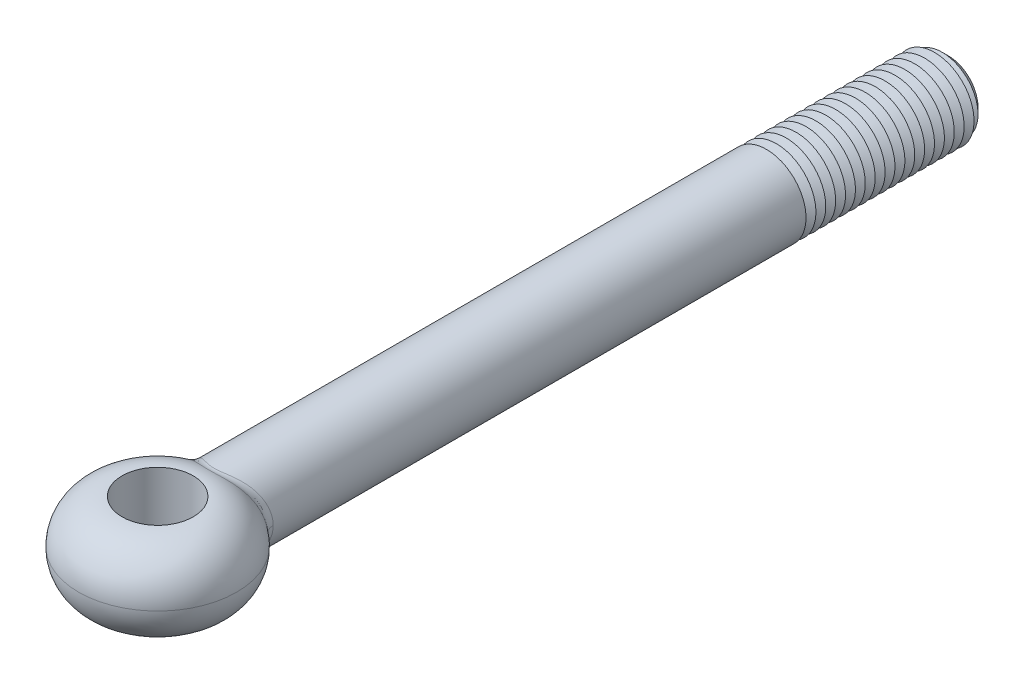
ISO-10303-21;
HEADER;
FILE_DESCRIPTION(('STEP AP214'),'2;1');
FILE_NAME('part.step','',(''),(''),'','','');
FILE_SCHEMA(('AUTOMOTIVE_DESIGN { 1 0 10303 214 1 1 1 1 }'));
ENDSEC;
DATA;
#1=APPLICATION_CONTEXT('core data for automotive mechanical design processes');
#2=APPLICATION_PROTOCOL_DEFINITION('international standard','automotive_design',2000,#1);
#3=PRODUCT_CONTEXT('',#1,'mechanical');
#4=PRODUCT('Part','Part','',(#3));
#5=PRODUCT_RELATED_PRODUCT_CATEGORY('part','',(#4));
#6=PRODUCT_DEFINITION_FORMATION('','',#4);
#7=PRODUCT_DEFINITION_CONTEXT('part definition',#1,'design');
#8=PRODUCT_DEFINITION('design','',#6,#7);
#9=PRODUCT_DEFINITION_SHAPE('','',#8);
#10=(LENGTH_UNIT() NAMED_UNIT(*) SI_UNIT(.MILLI.,.METRE.));
#11=(NAMED_UNIT(*) PLANE_ANGLE_UNIT() SI_UNIT($,.RADIAN.));
#12=(NAMED_UNIT(*) SI_UNIT($,.STERADIAN.) SOLID_ANGLE_UNIT());
#13=UNCERTAINTY_MEASURE_WITH_UNIT(LENGTH_MEASURE(1.E-05),#10,'distance_accuracy_value','');
#14=(GEOMETRIC_REPRESENTATION_CONTEXT(3) GLOBAL_UNCERTAINTY_ASSIGNED_CONTEXT((#13)) GLOBAL_UNIT_ASSIGNED_CONTEXT((#10,
#11,#12)) REPRESENTATION_CONTEXT('',''));
#15=CARTESIAN_POINT('',(0.,0.,0.));
#16=DIRECTION('',(0.,0.,1.));
#17=DIRECTION('',(1.,0.,0.));
#18=AXIS2_PLACEMENT_3D('',#15,#16,#17);
#19=CARTESIAN_POINT('',(0.,0.,-200.));
#20=DIRECTION('',(0.,0.,1.));
#21=DIRECTION('',(1.,0.,0.));
#22=AXIS2_PLACEMENT_3D('',#19,#20,#21);
#23=CYLINDRICAL_SURFACE('',#22,10.);
#24=CARTESIAN_POINT('',(0.,0.,-154.));
#25=DIRECTION('',(0.,0.,-1.));
#26=DIRECTION('',(-1.,0.,0.));
#27=AXIS2_PLACEMENT_3D('',#24,#25,#26);
#28=CIRCLE('',#27,10.);
#29=CARTESIAN_POINT('',(-10.,0.,-154.));
#30=VERTEX_POINT('',#29);
#31=EDGE_CURVE('E78',#30,#30,#28,.T.);
#32=ORIENTED_EDGE('',*,*,#31,.F.);
#33=EDGE_LOOP('',(#32));
#34=FACE_BOUND('',#33,.T.);
#35=CARTESIAN_POINT('',(9.43452897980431,-5.9855471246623,-15.5975544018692));
#36=CARTESIAN_POINT('',(8.34423805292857,-5.52525611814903,-16.6059320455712));
#37=CARTESIAN_POINT('',(8.11431624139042,-5.84447362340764,-18.1101473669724));
#38=CARTESIAN_POINT('',(9.60050520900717,-5.77068079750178,-15.6600678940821));
#39=CARTESIAN_POINT('',(8.48250308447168,-5.3158455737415,-16.6734523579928));
#40=CARTESIAN_POINT('',(8.26546699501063,-5.63467148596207,-18.2014690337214));
#41=CARTESIAN_POINT('',(9.7577841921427,-5.54896856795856,-15.7193267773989));
#42=CARTESIAN_POINT('',(8.61224377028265,-5.10213898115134,-16.7368596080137));
#43=CARTESIAN_POINT('',(8.40899835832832,-5.41818479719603,-18.2879579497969));
#44=CARTESIAN_POINT('',(10.053869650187,-5.09311935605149,-15.8308850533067));
#45=CARTESIAN_POINT('',(8.85513381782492,-4.66620933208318,-16.8556211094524));
#46=CARTESIAN_POINT('',(8.6796419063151,-4.9730795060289,-18.4506608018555));
#47=CARTESIAN_POINT('',(10.1926707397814,-4.85897877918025,-15.8831824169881));
#48=CARTESIAN_POINT('',(8.96815881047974,-4.44404031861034,-16.9109148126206));
#49=CARTESIAN_POINT('',(8.80674930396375,-4.74445739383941,-18.5268717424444));
#50=CARTESIAN_POINT('',(10.4506831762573,-4.37955751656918,-15.9803525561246));
#51=CARTESIAN_POINT('',(9.17718300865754,-3.99242395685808,-17.0131862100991));
#52=CARTESIAN_POINT('',(9.04332894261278,-4.27633562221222,-18.6683874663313));
#53=CARTESIAN_POINT('',(10.5698855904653,-4.13427181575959,-16.0252219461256));
#54=CARTESIAN_POINT('',(9.27305982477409,-3.76305815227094,-17.0601040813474));
#55=CARTESIAN_POINT('',(9.15279314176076,-4.03683106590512,-18.7336872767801));
#56=CARTESIAN_POINT('',(10.7875880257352,-3.634260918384,-16.1071213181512));
#57=CARTESIAN_POINT('',(9.44739138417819,-3.29841554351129,-17.1454161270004));
#58=CARTESIAN_POINT('',(9.35291302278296,-3.54860493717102,-18.8528181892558));
#59=CARTESIAN_POINT('',(10.8860907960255,-3.37953698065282,-16.1441523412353));
#60=CARTESIAN_POINT('',(9.52574461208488,-3.063249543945,-17.183760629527));
#61=CARTESIAN_POINT('',(9.4435712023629,-3.29988459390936,-18.906650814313));
#62=CARTESIAN_POINT('',(11.0586995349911,-2.87065864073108,-16.2090049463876));
#63=CARTESIAN_POINT('',(9.66255871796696,-2.5958661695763,-17.2507122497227));
#64=CARTESIAN_POINT('',(9.60255363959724,-2.80300001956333,-19.0008915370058));
#65=CARTESIAN_POINT('',(11.1334873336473,-2.61674859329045,-16.237084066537));
#66=CARTESIAN_POINT('',(9.72150133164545,-2.36390013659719,-17.2795551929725));
#67=CARTESIAN_POINT('',(9.67150157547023,-2.555074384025,-19.041675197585));
#68=CARTESIAN_POINT('',(11.2622086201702,-2.10328461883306,-16.2853899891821));
#69=CARTESIAN_POINT('',(9.82270778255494,-1.89657583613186,-17.3290774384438));
#70=CARTESIAN_POINT('',(9.79023230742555,-2.05371225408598,-19.1118184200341));
#71=CARTESIAN_POINT('',(11.3161352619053,-1.84372886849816,-16.3056142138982));
#72=CARTESIAN_POINT('',(9.8649025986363,-1.66135361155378,-17.349722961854));
#73=CARTESIAN_POINT('',(9.84000881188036,-1.80027397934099,-19.1411742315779));
#74=CARTESIAN_POINT('',(11.4025652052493,-1.32109132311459,-16.338018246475));
#75=CARTESIAN_POINT('',(9.93244623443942,-1.18887816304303,-17.3827703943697));
#76=CARTESIAN_POINT('',(9.91981122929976,-1.28995449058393,-19.1882016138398));
#77=CARTESIAN_POINT('',(11.435087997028,-1.05801295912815,-16.3502053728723));
#78=CARTESIAN_POINT('',(9.95776661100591,-0.951775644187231,-17.3951583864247));
#79=CARTESIAN_POINT('',(9.94985511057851,-1.0330766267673,-19.2058838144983));
#80=CARTESIAN_POINT('',(11.4784864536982,-0.529957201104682,-16.3664661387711));
#81=CARTESIAN_POINT('',(9.99155479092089,-0.476371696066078,-17.4116890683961));
#82=CARTESIAN_POINT('',(9.98994969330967,-0.517466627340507,-19.2294751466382));
#83=CARTESIAN_POINT('',(11.4893618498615,-0.264979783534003,-16.3705396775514));
#84=CARTESIAN_POINT('',(10.0000000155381,-0.238226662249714,-17.415820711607));
#85=CARTESIAN_POINT('',(10.0000001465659,-0.258734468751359,-19.2353841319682));
#86=CARTESIAN_POINT('',(11.4893615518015,0.269629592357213,-16.3705395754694));
#87=CARTESIAN_POINT('',(9.99999998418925,0.242407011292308,-17.4158206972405));
#88=CARTESIAN_POINT('',(9.99999985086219,0.263274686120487,-19.2353839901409));
#89=CARTESIAN_POINT('',(11.4781008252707,0.53926163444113,-16.3663217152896));
#90=CARTESIAN_POINT('',(9.9912557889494,0.48473250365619,-17.4115427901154));
#91=CARTESIAN_POINT('',(9.98959327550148,0.526551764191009,-19.2292656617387));
#92=CARTESIAN_POINT('',(11.4331665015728,1.07653539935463,-16.3494853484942));
#93=CARTESIAN_POINT('',(9.9562701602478,0.968459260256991,-17.3944262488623));
#94=CARTESIAN_POINT('',(9.94808005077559,1.05116251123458,-19.2048391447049));
#95=CARTESIAN_POINT('',(11.3994921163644,1.3441770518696,-16.3368665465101));
#96=CARTESIAN_POINT('',(9.9300520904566,1.20969577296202,-17.3815990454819));
#97=CARTESIAN_POINT('',(9.91697267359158,1.31249611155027,-19.1865305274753));
#98=CARTESIAN_POINT('',(11.3100467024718,1.8755498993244,-16.3033310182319));
#99=CARTESIAN_POINT('',(9.86013961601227,1.69016143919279,-17.347392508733));
#100=CARTESIAN_POINT('',(9.83438836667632,1.83134501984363,-19.1378602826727));
#101=CARTESIAN_POINT('',(11.254271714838,2.13928038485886,-16.2824128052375));
#102=CARTESIAN_POINT('',(9.81648899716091,1.9292337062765,-17.3260346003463));
#103=CARTESIAN_POINT('',(9.78290778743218,2.08885963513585,-19.1074964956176));
#104=CARTESIAN_POINT('',(11.1211278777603,2.66099186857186,-16.2324443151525));
#105=CARTESIAN_POINT('',(9.71176614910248,2.40426315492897,-17.2747914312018));
#106=CARTESIAN_POINT('',(9.66010560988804,2.59827488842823,-19.0349366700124));
#107=CARTESIAN_POINT('',(11.043751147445,2.91897073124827,-16.2033910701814));
#108=CARTESIAN_POINT('',(9.65075538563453,2.64007593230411,-17.2449362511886));
#109=CARTESIAN_POINT('',(9.58877677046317,2.85017344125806,-18.9927363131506));
#110=CARTESIAN_POINT('',(10.8683072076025,3.42676440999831,-16.1374676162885));
#111=CARTESIAN_POINT('',(9.51159962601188,3.10681781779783,-17.1768385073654));
#112=CARTESIAN_POINT('',(9.42720199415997,3.34599891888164,-18.8969337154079));
#113=CARTESIAN_POINT('',(10.7702839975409,3.67659530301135,-16.1006140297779));
#114=CARTESIAN_POINT('',(9.43357674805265,3.33762998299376,-17.1386557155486));
#115=CARTESIAN_POINT('',(9.33699628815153,3.58994154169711,-18.8433557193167));
#116=CARTESIAN_POINT('',(10.5542593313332,4.1671394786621,-16.0193404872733));
#117=CARTESIAN_POINT('',(9.26049301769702,3.79376863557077,-17.0539542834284));
#118=CARTESIAN_POINT('',(9.13844085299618,4.06892407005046,-18.7251285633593));
#119=CARTESIAN_POINT('',(10.4362490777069,4.40784868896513,-15.9749171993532));
#120=CARTESIAN_POINT('',(9.1655238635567,4.01898948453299,-17.0074805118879));
#121=CARTESIAN_POINT('',(9.0300831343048,4.30395999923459,-18.6604745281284));
#122=CARTESIAN_POINT('',(10.1813021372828,4.87847620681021,-15.8789002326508));
#123=CARTESIAN_POINT('',(8.95890120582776,4.4625267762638,-16.9063865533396));
#124=CARTESIAN_POINT('',(8.7963369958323,4.76349528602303,-18.5206320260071));
#125=CARTESIAN_POINT('',(10.0443720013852,5.10839821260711,-15.8273090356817));
#126=CARTESIAN_POINT('',(8.84736248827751,4.68076606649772,-16.8518224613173));
#127=CARTESIAN_POINT('',(8.67095447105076,4.98799825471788,-18.4454472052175));
#128=CARTESIAN_POINT('',(9.75260585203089,5.55625016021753,-15.7173729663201));
#129=CARTESIAN_POINT('',(8.60795982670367,5.10918973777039,-16.7347636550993));
#130=CARTESIAN_POINT('',(8.40427110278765,5.42529476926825,-18.2851064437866));
#131=CARTESIAN_POINT('',(9.59776873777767,5.77417936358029,-15.6590276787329));
#132=CARTESIAN_POINT('',(8.48020856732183,5.31932036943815,-16.6723238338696));
#133=CARTESIAN_POINT('',(8.26296928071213,5.63808759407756,-18.1999498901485));
#134=CARTESIAN_POINT('',(9.26615260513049,6.20356593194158,-15.534146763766));
#135=CARTESIAN_POINT('',(8.20461231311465,5.73672793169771,-16.5377554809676));
#136=CARTESIAN_POINT('',(7.96098558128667,6.0573539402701,-18.0175190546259));
#137=CARTESIAN_POINT('',(9.08883645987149,6.4146038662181,-15.4674111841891));
#138=CARTESIAN_POINT('',(8.05636478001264,5.94370774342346,-16.4654337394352));
#139=CARTESIAN_POINT('',(7.7998337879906,6.26341791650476,-17.9199477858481));
#140=CARTESIAN_POINT('',(8.71758429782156,6.82162435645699,-15.3279355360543));
#141=CARTESIAN_POINT('',(7.74367757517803,6.34640999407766,-16.3131822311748));
#142=CARTESIAN_POINT('',(7.4633054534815,6.66084533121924,-17.7158184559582));
#143=CARTESIAN_POINT('',(8.52365283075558,7.01761100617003,-15.2551971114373));
#144=CARTESIAN_POINT('',(7.57936139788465,6.54213539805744,-16.2333112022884));
#145=CARTESIAN_POINT('',(7.28793280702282,6.85221276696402,-17.6092628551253));
#146=CARTESIAN_POINT('',(8.12016404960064,7.39386400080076,-15.1043942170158));
#147=CARTESIAN_POINT('',(7.23510051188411,6.92124197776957,-16.0665300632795));
#148=CARTESIAN_POINT('',(6.92417984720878,7.21959784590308,-17.3881065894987));
#149=CARTESIAN_POINT('',(7.91059883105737,7.57412229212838,-15.0263270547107));
#150=CARTESIAN_POINT('',(7.05525523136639,7.10464535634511,-15.9796657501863));
#151=CARTESIAN_POINT('',(6.735792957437,7.39560762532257,-17.2735018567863));
#152=CARTESIAN_POINT('',(7.47700680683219,7.91811936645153,-14.8657958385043));
#153=CARTESIAN_POINT('',(6.6807721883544,7.45778289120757,-15.7997990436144));
#154=CARTESIAN_POINT('',(6.34742931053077,7.73149702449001,-17.037563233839));
#155=CARTESIAN_POINT('',(7.2529835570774,8.08186218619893,-14.7833328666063));
#156=CARTESIAN_POINT('',(6.48622962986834,7.62757357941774,-15.7068372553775));
#157=CARTESIAN_POINT('',(6.14745540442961,7.89138058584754,-16.9162309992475));
#158=CARTESIAN_POINT('',(6.77134336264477,8.40579390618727,-14.6078016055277));
#159=CARTESIAN_POINT('',(6.06569707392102,7.96638984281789,-15.507686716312));
#160=CARTESIAN_POINT('',(5.71933908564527,8.20767755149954,-16.6576501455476));
#161=CARTESIAN_POINT('',(6.512495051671,8.56446092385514,-14.5144317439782));
#162=CARTESIAN_POINT('',(5.83842837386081,8.13426205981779,-15.4010317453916));
#163=CARTESIAN_POINT('',(5.49025421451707,8.36260494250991,-16.5199309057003));
#164=CARTESIAN_POINT('',(5.97928293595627,8.8614010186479,-14.3254807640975));
#165=CARTESIAN_POINT('',(5.36786976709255,8.45139804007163,-15.1837485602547));
#166=CARTESIAN_POINT('',(5.02091237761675,8.65254644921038,-16.240859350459));
#167=CARTESIAN_POINT('',(5.70491599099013,8.99966994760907,-14.2298992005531));
#168=CARTESIAN_POINT('',(5.12463036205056,8.60077991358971,-15.07312594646));
#169=CARTESIAN_POINT('',(4.78065315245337,8.78755651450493,-16.0995063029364));
#170=CARTESIAN_POINT('',(5.1405320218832,9.25561084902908,-14.0388519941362));
#171=CARTESIAN_POINT('',(4.62232310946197,8.87981959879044,-14.8506895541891));
#172=CARTESIAN_POINT('',(4.28955099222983,9.03746513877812,-15.8166039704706));
#173=CARTESIAN_POINT('',(4.85049666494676,9.37325797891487,-13.9433866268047));
#174=CARTESIAN_POINT('',(4.36324512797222,9.00959558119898,-14.7388483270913));
#175=CARTESIAN_POINT('',(4.03869573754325,9.15233944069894,-15.6750546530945));
#176=CARTESIAN_POINT('',(4.25463017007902,9.58739445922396,-13.7561899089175));
#177=CARTESIAN_POINT('',(3.82959253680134,9.24785728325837,-14.5184109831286));
#178=CARTESIAN_POINT('',(3.52704154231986,9.36142893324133,-15.3971561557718));
#179=CARTESIAN_POINT('',(3.94880498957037,9.68389171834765,-13.6644571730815));
#180=CARTESIAN_POINT('',(3.55497971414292,9.35650417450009,-14.4097498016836));
#181=CARTESIAN_POINT('',(3.26624636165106,9.45565184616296,-15.2608050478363));
#182=CARTESIAN_POINT('',(3.43589915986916,9.82367399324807,-13.5221298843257));
#183=CARTESIAN_POINT('',(3.09349956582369,9.5152325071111,-14.2403576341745));
#184=CARTESIAN_POINT('',(2.83229257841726,9.59213958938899,-15.0490317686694));
#185=CARTESIAN_POINT('',(3.23387124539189,9.87347664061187,-13.4688140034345));
#186=CARTESIAN_POINT('',(2.91169341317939,9.57213232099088,-14.1767435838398));
#187=CARTESIAN_POINT('',(2.66218071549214,9.64076843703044,-14.9696450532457));
#188=CARTESIAN_POINT('',(2.82276410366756,9.96416789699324,-13.3676828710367));
#189=CARTESIAN_POINT('',(2.54161663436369,9.67624211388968,-14.05582083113));
#190=CARTESIAN_POINT('',(2.31773787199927,9.72932218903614,-14.8189766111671));
#191=CARTESIAN_POINT('',(2.61368516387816,10.0050568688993,-13.319867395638));
#192=CARTESIAN_POINT('',(2.35330062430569,9.72349213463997,-13.9984773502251));
#193=CARTESIAN_POINT('',(2.14340706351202,9.76924744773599,-14.7476945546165));
#194=CARTESIAN_POINT('',(2.18934081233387,10.0774084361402,-13.232234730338));
#195=CARTESIAN_POINT('',(1.97112322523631,9.80743490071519,-13.8932151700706));
#196=CARTESIAN_POINT('',(1.79125705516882,9.83989375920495,-14.6169946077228));
#197=CARTESIAN_POINT('',(1.97410477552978,10.1089095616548,-13.1923850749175));
#198=CARTESIAN_POINT('',(1.77722521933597,9.84420740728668,-13.8452196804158));
#199=CARTESIAN_POINT('',(1.61345539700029,9.87065243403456,-14.5575285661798));
#200=CARTESIAN_POINT('',(1.53721646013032,10.1622357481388,-13.1231108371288));
#201=CARTESIAN_POINT('',(1.38378639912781,9.90663622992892,-13.7617076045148));
#202=CARTESIAN_POINT('',(1.25400645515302,9.92272177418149,-14.4541203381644));
#203=CARTESIAN_POINT('',(1.31556607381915,10.1840636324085,-13.0936832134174));
#204=CARTESIAN_POINT('',(1.18416025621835,9.93232760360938,-13.7261484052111));
#205=CARTESIAN_POINT('',(1.07236030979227,9.94403519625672,-14.4101736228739));
#206=CARTESIAN_POINT('',(0.901086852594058,10.2150338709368,-13.0512803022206));
#207=CARTESIAN_POINT('',(0.811010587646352,9.96883413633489,-13.6748948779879));
#208=CARTESIAN_POINT('',(0.733646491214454,9.97427549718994,-14.3468387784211));
#209=CARTESIAN_POINT('',(0.708925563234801,10.225588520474,-13.0364985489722));
#210=CARTESIAN_POINT('',(0.638016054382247,9.9813164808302,-13.6570022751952));
#211=CARTESIAN_POINT('',(0.576981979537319,9.98458138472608,-14.3247545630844));
#212=CARTESIAN_POINT('',(0.32280480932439,10.239115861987,-13.0174775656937));
#213=CARTESIAN_POINT('',(0.290519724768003,9.99731568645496,-13.6339840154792));
#214=CARTESIAN_POINT('',(0.2625642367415,9.99778989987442,-14.2963356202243));
#215=CARTESIAN_POINT('',(0.128845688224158,10.2420899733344,-13.0132363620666));
#216=CARTESIAN_POINT('',(0.11594169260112,10.0008413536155,-13.6288457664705));
#217=CARTESIAN_POINT('',(0.104811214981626,10.0006939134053,-14.2899979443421));
#218=CARTESIAN_POINT('',(-0.258903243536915,10.2403820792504,-13.0156565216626));
#219=CARTESIAN_POINT('',(-0.232987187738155,9.99881931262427,-13.6317755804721));
#220=CARTESIAN_POINT('',(-0.210605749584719,9.9990262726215,-14.2936141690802));
#221=CARTESIAN_POINT('',(-0.452692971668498,10.235697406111,-13.0223216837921));
#222=CARTESIAN_POINT('',(-0.407417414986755,9.99326752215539,-13.6398495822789));
#223=CARTESIAN_POINT('',(-0.368269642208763,9.99445201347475,-14.3035737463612));
#224=CARTESIAN_POINT('',(-0.838056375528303,10.2187856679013,-13.0459971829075));
#225=CARTESIAN_POINT('',(-0.754249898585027,9.97327695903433,-13.6684946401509));
#226=CARTESIAN_POINT('',(-0.682255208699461,9.97793886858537,-14.3389452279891));
#227=CARTESIAN_POINT('',(-1.02962955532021,10.2065569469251,-13.0630097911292));
#228=CARTESIAN_POINT('',(-0.926726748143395,9.95882742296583,-13.6890809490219));
#229=CARTESIAN_POINT('',(-0.838576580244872,9.96599836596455,-14.3643605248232));
#230=CARTESIAN_POINT('',(-1.47709063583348,10.1691133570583,-13.113849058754));
#231=CARTESIAN_POINT('',(-1.32963595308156,9.91473356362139,-13.7505127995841));
#232=CARTESIAN_POINT('',(-1.20464773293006,9.92943728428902,-14.4402891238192));
#233=CARTESIAN_POINT('',(-1.73139053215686,10.140813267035,-13.151518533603));
#234=CARTESIAN_POINT('',(-1.5587089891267,9.88147336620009,-13.7960088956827));
#235=CARTESIAN_POINT('',(-1.41344202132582,9.90180420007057,-14.4965358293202));
#236=CARTESIAN_POINT('',(-2.23104582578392,10.0715291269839,-13.239514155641));
#237=CARTESIAN_POINT('',(-2.00870802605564,9.80059822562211,-13.9019685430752));
#238=CARTESIAN_POINT('',(-1.8256925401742,9.83415301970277,-14.6278545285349));
#239=CARTESIAN_POINT('',(-2.47639580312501,10.0305375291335,-13.2898478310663));
#240=CARTESIAN_POINT('',(-2.22975057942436,9.75292233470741,-13.9625022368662));
#241=CARTESIAN_POINT('',(-2.02914551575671,9.79412755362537,-14.7029377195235));
#242=CARTESIAN_POINT('',(-2.9588911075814,9.93629512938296,-13.3995119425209));
#243=CARTESIAN_POINT('',(-2.66423463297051,9.64414242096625,-14.0939421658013));
#244=CARTESIAN_POINT('',(-2.43144462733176,9.70210635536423,-14.8664118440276));
#245=CARTESIAN_POINT('',(-3.19598869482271,9.88298340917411,-13.4588865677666));
#246=CARTESIAN_POINT('',(-2.87771399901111,9.58291258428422,-14.1649560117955));
#247=CARTESIAN_POINT('',(-2.63026227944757,9.65005114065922,-14.9548681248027));
#248=CARTESIAN_POINT('',(-3.66094239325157,9.76467554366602,-13.5832721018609));
#249=CARTESIAN_POINT('',(-3.29595689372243,9.44812095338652,-14.3131723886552));
#250=CARTESIAN_POINT('',(-3.02232846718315,9.53453167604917,-15.1400304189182));
#251=CARTESIAN_POINT('',(-3.88879902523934,9.69968005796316,-13.648282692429));
#252=CARTESIAN_POINT('',(-3.50077505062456,9.37449775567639,-14.3904211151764));
#253=CARTESIAN_POINT('',(-3.21557731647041,9.47106807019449,-15.2367359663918));
#254=CARTESIAN_POINT('',(-4.44320756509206,9.52429263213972,-13.813552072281));
#255=CARTESIAN_POINT('',(-3.99876446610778,9.17730333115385,-14.5861617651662));
#256=CARTESIAN_POINT('',(-3.68829661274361,9.29981435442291,-15.4823644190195));
#257=CARTESIAN_POINT('',(-4.76458779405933,9.40709204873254,-13.9157408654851));
#258=CARTESIAN_POINT('',(-4.28661274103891,9.04678997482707,-14.7065021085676));
#259=CARTESIAN_POINT('',(-3.96458981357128,9.18537607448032,-15.6340547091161));
#260=CARTESIAN_POINT('',(-5.38930158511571,9.14816852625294,-14.12183146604));
#261=CARTESIAN_POINT('',(-4.84418122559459,8.76215134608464,-14.9475940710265));
#262=CARTESIAN_POINT('',(-4.50539064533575,8.93255512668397,-15.9395491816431));
#263=CARTESIAN_POINT('',(-5.69262932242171,9.00643772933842,-14.2257338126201));
#264=CARTESIAN_POINT('',(-5.11390788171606,8.60783261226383,-15.0683962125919));
#265=CARTESIAN_POINT('',(-4.76989446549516,8.79416478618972,-16.0933540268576));
#266=CARTESIAN_POINT('',(-6.2807517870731,8.69911934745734,-14.4315862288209));
#267=CARTESIAN_POINT('',(-5.63445612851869,8.27743175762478,-15.306083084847));
#268=CARTESIAN_POINT('',(-5.28576367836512,8.49408959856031,-16.3976428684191));
#269=CARTESIAN_POINT('',(-6.56557804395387,8.53357398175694,-14.5335393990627));
#270=CARTESIAN_POINT('',(-5.8852609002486,8.1012237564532,-15.4229792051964));
#271=CARTESIAN_POINT('',(-5.53715127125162,8.33244597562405,-16.5481322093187));
#272=CARTESIAN_POINT('',(-7.11655081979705,8.17895147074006,-14.7332405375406));
#273=CARTESIAN_POINT('',(-6.36771692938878,7.72839278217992,-15.6503344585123));
#274=CARTESIAN_POINT('',(-6.02582390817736,7.98618157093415,-16.8424988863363));
#275=CARTESIAN_POINT('',(-7.38269879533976,7.98987616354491,-14.8309888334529));
#276=CARTESIAN_POINT('',(-6.5992657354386,7.53164079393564,-15.7607606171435));
#277=CARTESIAN_POINT('',(-6.26311005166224,7.80156258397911,-16.9863767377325));
#278=CARTESIAN_POINT('',(-7.89448355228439,7.58937034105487,-15.0202729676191));
#279=CARTESIAN_POINT('',(-7.04171419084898,7.11984304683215,-15.9730734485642));
#280=CARTESIAN_POINT('',(-6.72123688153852,7.41049629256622,-17.2646275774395));
#281=CARTESIAN_POINT('',(-8.14016591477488,7.37799201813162,-15.1118225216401));
#282=CARTESIAN_POINT('',(-7.25251801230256,6.9047481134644,-16.0749191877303));
#283=CARTESIAN_POINT('',(-6.9421139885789,7.20409995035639,-17.3990215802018));
#284=CARTESIAN_POINT('',(-8.61006535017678,6.93354564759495,-15.2875527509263));
#285=CARTESIAN_POINT('',(-7.65299610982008,6.45765789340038,-16.2690458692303));
#286=CARTESIAN_POINT('',(-7.36595828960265,6.77012874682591,-17.656686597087));
#287=CARTESIAN_POINT('',(-8.83428130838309,6.70047647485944,-15.371733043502));
#288=CARTESIAN_POINT('',(-7.8424935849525,6.22562042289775,-16.361245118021));
#289=CARTESIAN_POINT('',(-7.56892455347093,6.5425527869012,-17.7799570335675));
#290=CARTESIAN_POINT('',(-9.25940881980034,6.21400101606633,-15.5315844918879));
#291=CARTESIAN_POINT('',(-8.19932512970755,5.74654163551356,-16.5351494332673));
#292=CARTESIAN_POINT('',(-7.95478255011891,6.06754307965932,-18.0137900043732));
#293=CARTESIAN_POINT('',(-9.46031551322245,5.96059050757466,-15.6072538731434));
#294=CARTESIAN_POINT('',(-8.36645913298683,5.49950956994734,-16.6167587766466));
#295=CARTESIAN_POINT('',(-8.13767009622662,5.82010520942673,-18.1243498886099));
#296=CARTESIAN_POINT('',(-9.83679553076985,5.43527222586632,-15.7490893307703));
#297=CARTESIAN_POINT('',(-8.67756159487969,4.99254792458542,-16.7687780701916));
#298=CARTESIAN_POINT('',(-8.48110805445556,5.3071681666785,-18.3313946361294));
#299=CARTESIAN_POINT('',(-10.0123724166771,5.16336706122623,-15.8152567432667));
#300=CARTESIAN_POINT('',(-8.82133112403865,4.7326884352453,-16.8390914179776));
#301=CARTESIAN_POINT('',(-8.64166160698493,5.04167154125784,-18.4278814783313));
#302=CARTESIAN_POINT('',(-10.3212633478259,4.62921939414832,-15.9316192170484));
#303=CARTESIAN_POINT('',(-9.07266333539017,4.22688436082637,-16.9620419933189));
#304=CARTESIAN_POINT('',(-8.92458732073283,4.52011321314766,-18.5974339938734));
#305=CARTESIAN_POINT('',(-10.4569869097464,4.36841996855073,-15.9827265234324));
#306=CARTESIAN_POINT('',(-9.18224116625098,3.98188546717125,-17.0156619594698));
#307=CARTESIAN_POINT('',(-9.04911967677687,4.26546057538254,-18.671841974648));
#308=CARTESIAN_POINT('',(-10.7046952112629,3.83526953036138,-16.0759469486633));
#309=CARTESIAN_POINT('',(-9.3812489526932,3.48456856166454,-17.1130474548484));
#310=CARTESIAN_POINT('',(-9.27666839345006,3.74487597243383,-18.8074855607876));
#311=CARTESIAN_POINT('',(-10.8166824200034,3.5629197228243,-16.1180610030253));
#312=CARTESIAN_POINT('',(-9.47054625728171,3.23238025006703,-17.156748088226));
#313=CARTESIAN_POINT('',(-9.37968699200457,3.47894518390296,-18.8687225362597));
#314=CARTESIAN_POINT('',(-11.0155728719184,3.00929549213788,-16.1928087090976));
#315=CARTESIAN_POINT('',(-9.62851946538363,2.72270494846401,-17.2340550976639));
#316=CARTESIAN_POINT('',(-9.56280689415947,2.93836933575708,-18.977363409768));
#317=CARTESIAN_POINT('',(-11.1025230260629,2.72803886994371,-16.2254600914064));
#318=CARTESIAN_POINT('',(-9.69711918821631,2.46538774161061,-17.2676241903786));
#319=CARTESIAN_POINT('',(-9.64295105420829,2.66374165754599,-19.0247931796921));
#320=CARTESIAN_POINT('',(-11.2506400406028,2.15853827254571,-16.2810514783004));
#321=CARTESIAN_POINT('',(-9.81366746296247,1.94660748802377,-17.324654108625));
#322=CARTESIAN_POINT('',(-9.77955371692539,2.10766363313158,-19.1055210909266));
#323=CARTESIAN_POINT('',(-11.3118190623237,1.87029766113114,-16.3039960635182));
#324=CARTESIAN_POINT('',(-9.86153588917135,1.68533214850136,-17.3480757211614));
#325=CARTESIAN_POINT('',(-9.83602339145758,1.82621657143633,-19.1388258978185));
#326=CARTESIAN_POINT('',(-11.4028551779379,1.31891290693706,-16.3381269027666));
#327=CARTESIAN_POINT('',(-9.93267162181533,1.18691316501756,-17.3828806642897));
#328=CARTESIAN_POINT('',(-9.92007913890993,1.28782741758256,-19.1883592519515));
#329=CARTESIAN_POINT('',(-11.4352749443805,1.05621556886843,-16.350275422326));
#330=CARTESIAN_POINT('',(-9.95791206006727,0.95015650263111,-17.3952295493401));
#331=CARTESIAN_POINT('',(-9.95002783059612,1.03132159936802,-19.2059854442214));
#332=CARTESIAN_POINT('',(-11.4785246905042,0.529012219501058,-16.3664804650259));
#333=CARTESIAN_POINT('',(-9.99158458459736,0.475522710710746,-17.4117036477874));
#334=CARTESIAN_POINT('',(-9.9899850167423,0.516543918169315,-19.2294959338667));
#335=CARTESIAN_POINT('',(-11.4893616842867,0.264506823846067,-16.3705396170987));
#336=CARTESIAN_POINT('',(-9.99999992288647,0.23780149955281,-17.4158206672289));
#337=CARTESIAN_POINT('',(-9.99999998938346,0.258272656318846,-19.2353840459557));
#338=CARTESIAN_POINT('',(-11.4893617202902,-0.269274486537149,-16.3705396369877));
#339=CARTESIAN_POINT('',(-10.0000000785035,-0.242087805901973,-17.4158207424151));
#340=CARTESIAN_POINT('',(-10.0000000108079,-0.262927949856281,-19.2353840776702));
#341=CARTESIAN_POINT('',(-11.4781305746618,-0.538550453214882,-16.3663328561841));
#342=CARTESIAN_POINT('',(-9.99127884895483,-0.484093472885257,-17.41155407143));
#343=CARTESIAN_POINT('',(-9.98962077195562,-0.525857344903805,-19.2292818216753));
#344=CARTESIAN_POINT('',(-11.4333067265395,-1.07521295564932,-16.3495378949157));
#345=CARTESIAN_POINT('',(-9.95637938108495,-0.967267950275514,-17.3944796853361));
#346=CARTESIAN_POINT('',(-9.94820958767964,-1.04987123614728,-19.2049153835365));
#347=CARTESIAN_POINT('',(-11.3997055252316,-1.34259873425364,-16.3369465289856));
#348=CARTESIAN_POINT('',(-9.93021837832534,-1.2082722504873,-17.3816804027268));
#349=CARTESIAN_POINT('',(-9.91716979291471,-1.31095499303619,-19.1866465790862));
#350=CARTESIAN_POINT('',(-11.310346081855,-1.87408052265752,-16.303443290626));
#351=CARTESIAN_POINT('',(-9.86037403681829,-1.68882951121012,-17.3475072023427));
#352=CARTESIAN_POINT('',(-9.83466469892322,-1.82991027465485,-19.1380232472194));
#353=CARTESIAN_POINT('',(-11.2545333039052,-2.13816677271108,-16.2825109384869));
#354=CARTESIAN_POINT('',(-9.81669446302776,-1.92822118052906,-17.3261351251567));
#355=CARTESIAN_POINT('',(-9.78314912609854,-2.0877722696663,-19.1076389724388));
#356=CARTESIAN_POINT('',(-11.1212790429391,-2.66048788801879,-16.2325010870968));
#357=CARTESIAN_POINT('',(-9.71188550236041,-2.40380188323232,-17.2748498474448));
#358=CARTESIAN_POINT('',(-9.66024496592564,-2.59778278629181,-19.0350191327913));
#359=CARTESIAN_POINT('',(-11.0438369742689,-2.91872259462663,-16.2034233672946));
#360=CARTESIAN_POINT('',(-9.65082369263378,-2.63984697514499,-17.2449697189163));
#361=CARTESIAN_POINT('',(-9.58885584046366,-2.84993115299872,-18.9927832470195));
#362=CARTESIAN_POINT('',(-10.8681953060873,-3.42708801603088,-16.1374255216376));
#363=CARTESIAN_POINT('',(-9.51151104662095,-3.10711477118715,-17.1767951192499));
#364=CARTESIAN_POINT('',(-9.42709891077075,-3.34631489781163,-18.8968725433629));
#365=CARTESIAN_POINT('',(-10.7700335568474,-3.67723256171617,-16.1005196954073));
#366=CARTESIAN_POINT('',(-9.43337750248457,-3.33821895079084,-17.1385580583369));
#367=CARTESIAN_POINT('',(-9.33676571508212,-3.59056378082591,-18.8432185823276));
#368=CARTESIAN_POINT('',(-10.5537166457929,-4.16830295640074,-16.0191364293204));
#369=CARTESIAN_POINT('',(-9.26005752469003,-3.79485238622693,-17.0537413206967));
#370=CARTESIAN_POINT('',(-9.13794243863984,-4.07006012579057,-18.7248316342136));
#371=CARTESIAN_POINT('',(-10.4355590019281,-4.4092276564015,-15.9746580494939));
#372=CARTESIAN_POINT('',(-9.16496856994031,-4.02027727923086,-17.0072093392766));
#373=CARTESIAN_POINT('',(-9.02945010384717,-4.30530646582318,-18.6600972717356));
#374=CARTESIAN_POINT('',(-10.1805249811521,-4.87980527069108,-15.8786068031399));
#375=CARTESIAN_POINT('',(-8.9582676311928,-4.46379094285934,-16.9060760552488));
#376=CARTESIAN_POINT('',(-8.79562481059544,-4.76479302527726,-18.5202044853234));
#377=CARTESIAN_POINT('',(-10.0436912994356,-5.10948231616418,-15.8270501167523));
#378=CARTESIAN_POINT('',(-8.84680285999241,-4.68181416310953,-16.8515466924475));
#379=CARTESIAN_POINT('',(-8.67033027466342,-4.98905680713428,-18.4450698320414));
#380=CARTESIAN_POINT('',(-9.75220852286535,-5.55682061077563,-15.7172256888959));
#381=CARTESIAN_POINT('',(-8.60763391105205,-5.10972638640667,-16.7346064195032));
#382=CARTESIAN_POINT('',(-8.40390994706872,-5.42585177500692,-18.2848913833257));
#383=CARTESIAN_POINT('',(-9.59756440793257,-5.77448519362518,-15.6589598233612));
#384=CARTESIAN_POINT('',(-8.48004754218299,-5.31956459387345,-16.672252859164));
#385=CARTESIAN_POINT('',(-8.2627885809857,-5.63838621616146,-18.1998503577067));
#386=CARTESIAN_POINT('',(-9.43452897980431,-5.9855471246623,-15.5975544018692));
#387=CARTESIAN_POINT('',(-8.34423805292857,-5.52525611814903,-16.6059320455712));
#388=CARTESIAN_POINT('',(-8.11431624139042,-5.84447362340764,-18.1101473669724));
#389=(BOUNDED_SURFACE() B_SPLINE_SURFACE(3,2,((#35,#36,#37),(#38,#39,#40),(#41,#42,#43),(#44,
#45,#46),(#47,#48,#49),(#50,#51,#52),(#53,#54,#55),(#56,#57,#58),(#59,#60,#61),(#62,#63,#64),
(#65,#66,#67),(#68,#69,#70),(#71,#72,#73),(#74,#75,#76),(#77,#78,#79),(#80,#81,#82),(#83,#84,
#85),(#86,#87,#88),(#89,#90,#91),(#92,#93,#94),(#95,#96,#97),(#98,#99,#100),(#101,#102,#103),
(#104,#105,#106),(#107,#108,#109),(#110,#111,#112),(#113,#114,#115),(#116,#117,#118),(#119,#120,
#121),(#122,#123,#124),(#125,#126,#127),(#128,#129,#130),(#131,#132,#133),(#134,#135,#136),
(#137,#138,#139),(#140,#141,#142),(#143,#144,#145),(#146,#147,#148),(#149,#150,#151),(#152,#153,
#154),(#155,#156,#157),(#158,#159,#160),(#161,#162,#163),(#164,#165,#166),(#167,#168,#169),
(#170,#171,#172),(#173,#174,#175),(#176,#177,#178),(#179,#180,#181),(#182,#183,#184),(#185,#186,
#187),(#188,#189,#190),(#191,#192,#193),(#194,#195,#196),(#197,#198,#199),(#200,#201,#202),
(#203,#204,#205),(#206,#207,#208),(#209,#210,#211),(#212,#213,#214),(#215,#216,#217),(#218,#219,
#220),(#221,#222,#223),(#224,#225,#226),(#227,#228,#229),(#230,#231,#232),(#233,#234,#235),
(#236,#237,#238),(#239,#240,#241),(#242,#243,#244),(#245,#246,#247),(#248,#249,#250),(#251,#252,
#253),(#254,#255,#256),(#257,#258,#259),(#260,#261,#262),(#263,#264,#265),(#266,#267,#268),
(#269,#270,#271),(#272,#273,#274),(#275,#276,#277),(#278,#279,#280),(#281,#282,#283),(#284,#285,
#286),(#287,#288,#289),(#290,#291,#292),(#293,#294,#295),(#296,#297,#298),(#299,#300,#301),
(#302,#303,#304),(#305,#306,#307),(#308,#309,#310),(#311,#312,#313),(#314,#315,#316),(#317,#318,
#319),(#320,#321,#322),(#323,#324,#325),(#326,#327,#328),(#329,#330,#331),(#332,#333,#334),
(#335,#336,#337),(#338,#339,#340),(#341,#342,#343),(#344,#345,#346),(#347,#348,#349),(#350,#351,
#352),(#353,#354,#355),(#356,#357,#358),(#359,#360,#361),(#362,#363,#364),(#365,#366,#367),
(#368,#369,#370),(#371,#372,#373),(#374,#375,#376),(#377,#378,#379),(#380,#381,#382),(#383,#384,
#385),(#386,#387,#388)),.UNSPECIFIED.,.F.,.F.,.F.) B_SPLINE_SURFACE_WITH_KNOTS((4,2,2,2,2,2,2,2,
2,2,2,2,2,2,2,2,2,2,2,2,2,2,2,2,2,2,2,2,2,2,2,2,2,2,2,2,2,2,2,2,2,2,2,2,2,2,2,2,2,2,2,2,2,2,2,2,
2,2,4),(3,3),(0.,1.08226690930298,2.16484855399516,3.24792225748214,4.33085202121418,
5.37900830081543,6.42750826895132,7.47505215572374,8.52260904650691,9.58854824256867,
10.6545249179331,11.7206926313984,12.7872498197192,13.8515566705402,14.9163332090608,
15.9807419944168,17.0452162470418,18.1431859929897,19.2408560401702,20.339084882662,
21.4370446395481,22.6296089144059,23.8224153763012,25.0166490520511,26.2104353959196,
26.9651479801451,27.7198298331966,28.4713702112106,29.2226910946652,29.861241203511,
30.4996717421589,31.1383247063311,31.77711790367,32.6451230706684,33.5136454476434,
34.3865578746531,35.2594210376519,36.5516017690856,37.8441971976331,39.1345286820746,
40.4247594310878,41.7120351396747,42.999377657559,44.2869880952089,45.5744172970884,
46.7424308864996,47.9103229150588,49.0760122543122,50.2411508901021,51.2871766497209,
52.3328624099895,53.3973963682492,54.4623349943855,55.5299046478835,56.597503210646,
57.6631681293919,58.7289654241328,59.7923657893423,60.8554695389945),(0.,1.),
.UNSPECIFIED.) GEOMETRIC_REPRESENTATION_ITEM() RATIONAL_B_SPLINE_SURFACE(((1.,0.913883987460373,
1.),(1.,0.911846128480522,1.),(1.,0.909886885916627,1.),(1.,0.906156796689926,1.),(1.,
0.904386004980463,1.),(1.,0.901064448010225,1.),(1.,0.899513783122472,1.),(1.,0.896661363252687,
1.),(1.,0.895359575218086,1.),(1.,0.893066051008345,1.),(1.,0.892065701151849,1.),(1.,
0.890337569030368,1.),(1.,0.889609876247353,1.),(1.,0.88844102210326,1.),(1.,0.887999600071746,
1.),(1.,0.887410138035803,1.),(1.,0.887262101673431,1.),(1.,0.887262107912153,1.),(1.,
0.88741539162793,1.),(1.,0.888025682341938,1.),(1.,0.888482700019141,1.),(1.,0.889692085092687,
1.),(1.,0.890444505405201,1.),(1.,0.892231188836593,1.),(1.,0.893265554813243,1.),(1.,
0.895594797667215,1.),(1.,0.896889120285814,1.),(1.,0.899717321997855,1.),(1.,0.90125130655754,
1.),(1.,0.904531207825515,1.),(1.,0.906277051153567,1.),(1.,0.909951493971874,1.),(1.,
0.911880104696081,1.),(1.,0.915950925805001,1.),(1.,0.918097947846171,1.),(1.,0.92251383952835,
1.),(1.,0.924782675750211,1.),(1.,0.929404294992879,1.),(1.,0.931757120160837,1.),(1.,
0.936503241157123,1.),(1.,0.93889652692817,1.),(1.,0.943886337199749,1.),(1.,0.946482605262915,
1.),(1.,0.951611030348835,1.),(1.,0.954143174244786,1.),(1.,0.959076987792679,1.),(1.,
0.961478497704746,1.),(1.,0.966065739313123,1.),(1.,0.968251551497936,1.),(1.,0.9715584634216,
1.),(1.,0.972775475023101,1.),(1.,0.975049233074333,1.),(1.,0.976105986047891,1.),(1.,
0.978017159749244,1.),(1.,0.978872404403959,1.),(1.,0.980344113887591,1.),(1.,0.980960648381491,
1.),(1.,0.981843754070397,1.),(1.,0.98214896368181,1.),(1.,0.982541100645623,1.),(1.,
0.982628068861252,1.),(1.,0.98257832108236,1.),(1.,0.98244152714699,1.),(1.,0.98195261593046,
1.),(1.,0.981600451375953,1.),(1.,0.98053826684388,1.),(1.,0.979745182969,1.),(1.,
0.977859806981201,1.),(1.,0.976767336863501,1.),(1.,0.974339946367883,1.),(1.,0.973003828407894,
1.),(1.,0.97014690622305,1.),(1.,0.968626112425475,1.),(1.,0.964679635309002,1.),(1.,
0.96217021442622,1.),(1.,0.956958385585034,1.),(1.,0.954255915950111,1.),(1.,0.948755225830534,
1.),(1.,0.945957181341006,1.),(1.,0.940340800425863,1.),(1.,0.937522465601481,1.),(1.,
0.931944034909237,1.),(1.,0.92918382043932,1.),(1.,0.923782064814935,1.),(1.,0.921140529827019,
1.),(1.,0.916039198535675,1.),(1.,0.913579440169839,1.),(1.,0.908902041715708,1.),(1.,
0.906684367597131,1.),(1.,0.902737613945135,1.),(1.,0.900982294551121,1.),(1.,0.897752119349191,
1.),(1.,0.896277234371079,1.),(1.,0.893641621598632,1.),(1.,0.892480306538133,1.),(1.,
0.890493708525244,1.),(1.,0.889668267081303,1.),(1.,0.888437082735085,1.),(1.,0.887997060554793,
1.),(1.,0.88740961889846,1.),(1.,0.887262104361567,1.),(1.,0.88726210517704,1.),(1.,
0.887414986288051,1.),(1.,0.888023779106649,1.),(1.,0.888479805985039,1.),(1.,0.889688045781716,
1.),(1.,0.890440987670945,1.),(1.,0.89222916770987,1.),(1.,0.893264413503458,1.),(1.,
0.895596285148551,1.),(1.,0.896892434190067,1.),(1.,0.899724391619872,1.),(1.,0.901260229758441,
1.),(1.,0.904541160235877,1.),(1.,0.906285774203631,1.),(1.,0.909956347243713,1.),(1.,
0.911882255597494,1.),(1.,0.913883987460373,1.))) REPRESENTATION_ITEM('') SURFACE());
#390=CARTESIAN_POINT('',(-8.11431624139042,-5.84447362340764,-18.1101473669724));
#391=CARTESIAN_POINT('',(-8.2627885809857,-5.63838621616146,-18.1998503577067));
#392=CARTESIAN_POINT('',(-8.40390994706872,-5.42585177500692,-18.2848913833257));
#393=CARTESIAN_POINT('',(-8.67033027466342,-4.98905680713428,-18.4450698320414));
#394=CARTESIAN_POINT('',(-8.79562481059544,-4.76479302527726,-18.5202044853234));
#395=CARTESIAN_POINT('',(-9.02945010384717,-4.30530646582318,-18.6600972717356));
#396=CARTESIAN_POINT('',(-9.13794243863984,-4.07006012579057,-18.7248316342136));
#397=CARTESIAN_POINT('',(-9.33676571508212,-3.59056378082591,-18.8432185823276));
#398=CARTESIAN_POINT('',(-9.42709891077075,-3.34631489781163,-18.8968725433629));
#399=CARTESIAN_POINT('',(-9.58885584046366,-2.84993115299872,-18.9927832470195));
#400=CARTESIAN_POINT('',(-9.66024496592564,-2.59778278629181,-19.0350191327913));
#401=CARTESIAN_POINT('',(-9.78314912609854,-2.0877722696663,-19.1076389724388));
#402=CARTESIAN_POINT('',(-9.83466469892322,-1.82991027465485,-19.1380232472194));
#403=CARTESIAN_POINT('',(-9.91716979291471,-1.31095499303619,-19.1866465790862));
#404=CARTESIAN_POINT('',(-9.94820958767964,-1.04987123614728,-19.2049153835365));
#405=CARTESIAN_POINT('',(-9.98962077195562,-0.525857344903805,-19.2292818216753));
#406=CARTESIAN_POINT('',(-10.0000000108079,-0.262927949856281,-19.2353840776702));
#407=CARTESIAN_POINT('',(-9.99999998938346,0.258272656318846,-19.2353840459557));
#408=CARTESIAN_POINT('',(-9.9899850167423,0.516543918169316,-19.2294959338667));
#409=CARTESIAN_POINT('',(-9.95002783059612,1.03132159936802,-19.2059854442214));
#410=CARTESIAN_POINT('',(-9.92007913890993,1.28782741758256,-19.1883592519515));
#411=CARTESIAN_POINT('',(-9.83602339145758,1.82621657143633,-19.1388258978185));
#412=CARTESIAN_POINT('',(-9.77955371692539,2.10766363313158,-19.1055210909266));
#413=CARTESIAN_POINT('',(-9.6429510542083,2.66374165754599,-19.0247931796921));
#414=CARTESIAN_POINT('',(-9.56280689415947,2.93836933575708,-18.977363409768));
#415=CARTESIAN_POINT('',(-9.37968699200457,3.47894518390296,-18.8687225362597));
#416=CARTESIAN_POINT('',(-9.27666839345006,3.74487597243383,-18.8074855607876));
#417=CARTESIAN_POINT('',(-9.04911967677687,4.26546057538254,-18.671841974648));
#418=CARTESIAN_POINT('',(-8.92458732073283,4.52011321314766,-18.5974339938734));
#419=CARTESIAN_POINT('',(-8.64166160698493,5.04167154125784,-18.4278814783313));
#420=CARTESIAN_POINT('',(-8.48110805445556,5.3071681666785,-18.3313946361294));
#421=CARTESIAN_POINT('',(-8.13767009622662,5.82010520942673,-18.1243498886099));
#422=CARTESIAN_POINT('',(-7.95478255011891,6.06754307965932,-18.0137900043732));
#423=CARTESIAN_POINT('',(-7.56892455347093,6.5425527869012,-17.7799570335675));
#424=CARTESIAN_POINT('',(-7.36595828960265,6.7701287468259,-17.656686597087));
#425=CARTESIAN_POINT('',(-6.9421139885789,7.20409995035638,-17.3990215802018));
#426=CARTESIAN_POINT('',(-6.72123688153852,7.41049629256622,-17.2646275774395));
#427=CARTESIAN_POINT('',(-6.26311005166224,7.80156258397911,-16.9863767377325));
#428=CARTESIAN_POINT('',(-6.02582390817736,7.98618157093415,-16.8424988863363));
#429=CARTESIAN_POINT('',(-5.53715127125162,8.33244597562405,-16.5481322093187));
#430=CARTESIAN_POINT('',(-5.28576367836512,8.49408959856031,-16.3976428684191));
#431=CARTESIAN_POINT('',(-4.76989446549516,8.79416478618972,-16.0933540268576));
#432=CARTESIAN_POINT('',(-4.50539064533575,8.93255512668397,-15.9395491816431));
#433=CARTESIAN_POINT('',(-3.96458981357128,9.18537607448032,-15.6340547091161));
#434=CARTESIAN_POINT('',(-3.68829661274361,9.29981435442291,-15.4823644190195));
#435=CARTESIAN_POINT('',(-3.21557731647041,9.47106807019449,-15.2367359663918));
#436=CARTESIAN_POINT('',(-3.02232846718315,9.53453167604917,-15.1400304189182));
#437=CARTESIAN_POINT('',(-2.63026227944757,9.65005114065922,-14.9548681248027));
#438=CARTESIAN_POINT('',(-2.43144462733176,9.70210635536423,-14.8664118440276));
#439=CARTESIAN_POINT('',(-2.02914551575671,9.79412755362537,-14.7029377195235));
#440=CARTESIAN_POINT('',(-1.8256925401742,9.83415301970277,-14.6278545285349));
#441=CARTESIAN_POINT('',(-1.41344202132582,9.90180420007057,-14.4965358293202));
#442=CARTESIAN_POINT('',(-1.20464773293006,9.92943728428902,-14.4402891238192));
#443=CARTESIAN_POINT('',(-0.838576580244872,9.96599836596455,-14.3643605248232));
#444=CARTESIAN_POINT('',(-0.682255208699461,9.97793886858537,-14.3389452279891));
#445=CARTESIAN_POINT('',(-0.368269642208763,9.99445201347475,-14.3035737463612));
#446=CARTESIAN_POINT('',(-0.210605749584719,9.9990262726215,-14.2936141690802));
#447=CARTESIAN_POINT('',(0.104811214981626,10.0006939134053,-14.2899979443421));
#448=CARTESIAN_POINT('',(0.262564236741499,9.99778989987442,-14.2963356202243));
#449=CARTESIAN_POINT('',(0.576981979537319,9.98458138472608,-14.3247545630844));
#450=CARTESIAN_POINT('',(0.733646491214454,9.97427549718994,-14.3468387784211));
#451=CARTESIAN_POINT('',(1.07236030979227,9.94403519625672,-14.4101736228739));
#452=CARTESIAN_POINT('',(1.25400645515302,9.92272177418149,-14.4541203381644));
#453=CARTESIAN_POINT('',(1.61345539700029,9.87065243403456,-14.5575285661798));
#454=CARTESIAN_POINT('',(1.79125705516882,9.83989375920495,-14.6169946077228));
#455=CARTESIAN_POINT('',(2.14340706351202,9.76924744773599,-14.7476945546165));
#456=CARTESIAN_POINT('',(2.31773787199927,9.72932218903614,-14.8189766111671));
#457=CARTESIAN_POINT('',(2.66218071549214,9.64076843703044,-14.9696450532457));
#458=CARTESIAN_POINT('',(2.83229257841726,9.59213958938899,-15.0490317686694));
#459=CARTESIAN_POINT('',(3.26624636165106,9.45565184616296,-15.2608050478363));
#460=CARTESIAN_POINT('',(3.52704154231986,9.36142893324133,-15.3971561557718));
#461=CARTESIAN_POINT('',(4.03869573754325,9.15233944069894,-15.6750546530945));
#462=CARTESIAN_POINT('',(4.28955099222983,9.03746513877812,-15.8166039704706));
#463=CARTESIAN_POINT('',(4.78065315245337,8.78755651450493,-16.0995063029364));
#464=CARTESIAN_POINT('',(5.02091237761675,8.65254644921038,-16.240859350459));
#465=CARTESIAN_POINT('',(5.49025421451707,8.36260494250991,-16.5199309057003));
#466=CARTESIAN_POINT('',(5.71933908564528,8.20767755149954,-16.6576501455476));
#467=CARTESIAN_POINT('',(6.14745540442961,7.89138058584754,-16.9162309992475));
#468=CARTESIAN_POINT('',(6.34742931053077,7.73149702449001,-17.037563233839));
#469=CARTESIAN_POINT('',(6.735792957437,7.39560762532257,-17.2735018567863));
#470=CARTESIAN_POINT('',(6.92417984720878,7.21959784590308,-17.3881065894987));
#471=CARTESIAN_POINT('',(7.28793280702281,6.85221276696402,-17.6092628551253));
#472=CARTESIAN_POINT('',(7.4633054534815,6.66084533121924,-17.7158184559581));
#473=CARTESIAN_POINT('',(7.7998337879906,6.26341791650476,-17.9199477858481));
#474=CARTESIAN_POINT('',(7.96098558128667,6.0573539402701,-18.0175190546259));
#475=CARTESIAN_POINT('',(8.26296928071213,5.63808759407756,-18.1999498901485));
#476=CARTESIAN_POINT('',(8.40427110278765,5.42529476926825,-18.2851064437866));
#477=CARTESIAN_POINT('',(8.67095447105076,4.98799825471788,-18.4454472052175));
#478=CARTESIAN_POINT('',(8.7963369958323,4.76349528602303,-18.5206320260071));
#479=CARTESIAN_POINT('',(9.0300831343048,4.30395999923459,-18.6604745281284));
#480=CARTESIAN_POINT('',(9.13844085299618,4.06892407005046,-18.7251285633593));
#481=CARTESIAN_POINT('',(9.33699628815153,3.58994154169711,-18.8433557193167));
#482=CARTESIAN_POINT('',(9.42720199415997,3.34599891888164,-18.8969337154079));
#483=CARTESIAN_POINT('',(9.58877677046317,2.85017344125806,-18.9927363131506));
#484=CARTESIAN_POINT('',(9.66010560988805,2.59827488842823,-19.0349366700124));
#485=CARTESIAN_POINT('',(9.78290778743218,2.08885963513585,-19.1074964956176));
#486=CARTESIAN_POINT('',(9.83438836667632,1.83134501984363,-19.1378602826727));
#487=CARTESIAN_POINT('',(9.91697267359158,1.31249611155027,-19.1865305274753));
#488=CARTESIAN_POINT('',(9.94808005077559,1.05116251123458,-19.2048391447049));
#489=CARTESIAN_POINT('',(9.98959327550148,0.526551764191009,-19.2292656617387));
#490=CARTESIAN_POINT('',(9.99999985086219,0.263274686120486,-19.2353839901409));
#491=CARTESIAN_POINT('',(10.0000001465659,-0.258734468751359,-19.2353841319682));
#492=CARTESIAN_POINT('',(9.98994969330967,-0.517466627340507,-19.2294751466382));
#493=CARTESIAN_POINT('',(9.94985511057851,-1.03307662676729,-19.2058838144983));
#494=CARTESIAN_POINT('',(9.91981122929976,-1.28995449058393,-19.1882016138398));
#495=CARTESIAN_POINT('',(9.84000881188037,-1.80027397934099,-19.1411742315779));
#496=CARTESIAN_POINT('',(9.79023230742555,-2.05371225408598,-19.1118184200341));
#497=CARTESIAN_POINT('',(9.67150157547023,-2.555074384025,-19.041675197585));
#498=CARTESIAN_POINT('',(9.60255363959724,-2.80300001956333,-19.0008915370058));
#499=CARTESIAN_POINT('',(9.4435712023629,-3.29988459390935,-18.906650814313));
#500=CARTESIAN_POINT('',(9.35291302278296,-3.54860493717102,-18.8528181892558));
#501=CARTESIAN_POINT('',(9.15279314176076,-4.03683106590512,-18.7336872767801));
#502=CARTESIAN_POINT('',(9.04332894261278,-4.27633562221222,-18.6683874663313));
#503=CARTESIAN_POINT('',(8.80674930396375,-4.74445739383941,-18.5268717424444));
#504=CARTESIAN_POINT('',(8.6796419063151,-4.9730795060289,-18.4506608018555));
#505=CARTESIAN_POINT('',(8.40899835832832,-5.41818479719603,-18.2879579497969));
#506=CARTESIAN_POINT('',(8.26546699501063,-5.63467148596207,-18.2014690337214));
#507=CARTESIAN_POINT('',(8.11431624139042,-5.84447362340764,-18.1101473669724));
#508=B_SPLINE_CURVE_WITH_KNOTS('',3,(#390,#391,#392,#393,#394,#395,#396,#397,#398,#399,#400,
#401,#402,#403,#404,#405,#406,#407,#408,#409,#410,#411,#412,#413,#414,#415,#416,#417,#418,#419,
#420,#421,#422,#423,#424,#425,#426,#427,#428,#429,#430,#431,#432,#433,#434,#435,#436,#437,#438,
#439,#440,#441,#442,#443,#444,#445,#446,#447,#448,#449,#450,#451,#452,#453,#454,#455,#456,#457,
#458,#459,#460,#461,#462,#463,#464,#465,#466,#467,#468,#469,#470,#471,#472,#473,#474,#475,#476,
#477,#478,#479,#480,#481,#482,#483,#484,#485,#486,#487,#488,#489,#490,#491,#492,#493,#494,#495,
#496,#497,#498,#499,#500,#501,#502,#503,#504,#505,#506,#507),.UNSPECIFIED.,.F.,.F.,(4,2,2,2,2,2,
2,2,2,2,2,2,2,2,2,2,2,2,2,2,2,2,2,2,2,2,2,2,2,2,2,2,2,2,2,2,2,2,2,2,2,2,2,2,2,2,2,2,2,2,2,2,2,2,
2,2,2,2,4),(0.,1.06310374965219,2.12650411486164,3.19230140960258,4.25796632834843,
5.32556489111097,6.39313454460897,7.4580731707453,8.52260712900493,9.56829288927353,
10.6143186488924,11.7794572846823,12.9451466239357,14.1130386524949,15.2810522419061,
16.5684814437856,17.8560918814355,19.1434343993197,20.4307101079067,21.7209408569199,
23.0112723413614,24.3038677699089,25.5960485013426,26.4689116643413,27.3418240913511,
28.210346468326,29.0783516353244,29.7171448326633,30.3557977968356,30.9942283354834,
31.6327784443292,32.3840993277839,33.1356397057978,33.8903215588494,34.6450341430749,
35.8388204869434,37.0330541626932,38.2258606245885,39.4184248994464,40.5163846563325,
41.6146134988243,42.7122835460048,43.8102532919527,44.8747275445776,45.9391363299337,
47.0039128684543,48.0682197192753,49.1347769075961,50.2009446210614,51.2669212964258,
52.3328604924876,53.3804173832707,54.4279612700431,55.476461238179,56.5246175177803,
57.6075472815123,58.6906209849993,59.7732026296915,60.8554695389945),.UNSPECIFIED.);
#509=CARTESIAN_POINT('',(-10.,0.,-19.2353840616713));
#510=VERTEX_POINT('',#509);
#511=CARTESIAN_POINT('',(10.,0.,-19.2353840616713));
#512=VERTEX_POINT('',#511);
#513=EDGE_CURVE('E80',#510,#512,#508,.T.);
#514=ORIENTED_EDGE('',*,*,#513,.T.);
#515=CARTESIAN_POINT('',(-9.43452897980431,5.9855471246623,-15.5975544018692));
#516=CARTESIAN_POINT('',(-8.34423805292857,5.52525611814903,-16.6059320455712));
#517=CARTESIAN_POINT('',(-8.11431624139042,5.84447362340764,-18.1101473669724));
#518=CARTESIAN_POINT('',(-9.60050520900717,5.77068079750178,-15.6600678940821));
#519=CARTESIAN_POINT('',(-8.48250308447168,5.3158455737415,-16.6734523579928));
#520=CARTESIAN_POINT('',(-8.26546699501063,5.63467148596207,-18.2014690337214));
#521=CARTESIAN_POINT('',(-9.7577841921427,5.54896856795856,-15.7193267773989));
#522=CARTESIAN_POINT('',(-8.61224377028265,5.10213898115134,-16.7368596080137));
#523=CARTESIAN_POINT('',(-8.40899835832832,5.41818479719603,-18.2879579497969));
#524=CARTESIAN_POINT('',(-10.053869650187,5.09311935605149,-15.8308850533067));
#525=CARTESIAN_POINT('',(-8.85513381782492,4.66620933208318,-16.8556211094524));
#526=CARTESIAN_POINT('',(-8.6796419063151,4.9730795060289,-18.4506608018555));
#527=CARTESIAN_POINT('',(-10.1926707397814,4.85897877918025,-15.8831824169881));
#528=CARTESIAN_POINT('',(-8.96815881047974,4.44404031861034,-16.9109148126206));
#529=CARTESIAN_POINT('',(-8.80674930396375,4.74445739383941,-18.5268717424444));
#530=CARTESIAN_POINT('',(-10.4506831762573,4.37955751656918,-15.9803525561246));
#531=CARTESIAN_POINT('',(-9.17718300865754,3.99242395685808,-17.0131862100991));
#532=CARTESIAN_POINT('',(-9.04332894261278,4.27633562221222,-18.6683874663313));
#533=CARTESIAN_POINT('',(-10.5698855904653,4.13427181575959,-16.0252219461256));
#534=CARTESIAN_POINT('',(-9.27305982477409,3.76305815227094,-17.0601040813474));
#535=CARTESIAN_POINT('',(-9.15279314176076,4.03683106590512,-18.7336872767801));
#536=CARTESIAN_POINT('',(-10.7875880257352,3.634260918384,-16.1071213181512));
#537=CARTESIAN_POINT('',(-9.44739138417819,3.29841554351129,-17.1454161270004));
#538=CARTESIAN_POINT('',(-9.35291302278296,3.54860493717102,-18.8528181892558));
#539=CARTESIAN_POINT('',(-10.8860907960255,3.37953698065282,-16.1441523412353));
#540=CARTESIAN_POINT('',(-9.52574461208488,3.063249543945,-17.183760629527));
#541=CARTESIAN_POINT('',(-9.4435712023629,3.29988459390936,-18.906650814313));
#542=CARTESIAN_POINT('',(-11.0586995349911,2.87065864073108,-16.2090049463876));
#543=CARTESIAN_POINT('',(-9.66255871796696,2.5958661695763,-17.2507122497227));
#544=CARTESIAN_POINT('',(-9.60255363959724,2.80300001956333,-19.0008915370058));
#545=CARTESIAN_POINT('',(-11.1334873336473,2.61674859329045,-16.237084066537));
#546=CARTESIAN_POINT('',(-9.72150133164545,2.36390013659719,-17.2795551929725));
#547=CARTESIAN_POINT('',(-9.67150157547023,2.555074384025,-19.041675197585));
#548=CARTESIAN_POINT('',(-11.2622086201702,2.10328461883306,-16.2853899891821));
#549=CARTESIAN_POINT('',(-9.82270778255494,1.89657583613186,-17.3290774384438));
#550=CARTESIAN_POINT('',(-9.79023230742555,2.05371225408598,-19.1118184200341));
#551=CARTESIAN_POINT('',(-11.3161352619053,1.84372886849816,-16.3056142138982));
#552=CARTESIAN_POINT('',(-9.8649025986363,1.66135361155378,-17.349722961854));
#553=CARTESIAN_POINT('',(-9.84000881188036,1.80027397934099,-19.1411742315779));
#554=CARTESIAN_POINT('',(-11.4025652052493,1.32109132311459,-16.338018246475));
#555=CARTESIAN_POINT('',(-9.93244623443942,1.18887816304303,-17.3827703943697));
#556=CARTESIAN_POINT('',(-9.91981122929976,1.28995449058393,-19.1882016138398));
#557=CARTESIAN_POINT('',(-11.435087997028,1.05801295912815,-16.3502053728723));
#558=CARTESIAN_POINT('',(-9.95776661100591,0.951775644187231,-17.3951583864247));
#559=CARTESIAN_POINT('',(-9.94985511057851,1.0330766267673,-19.2058838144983));
#560=CARTESIAN_POINT('',(-11.4784864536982,0.529957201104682,-16.3664661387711));
#561=CARTESIAN_POINT('',(-9.99155479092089,0.476371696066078,-17.4116890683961));
#562=CARTESIAN_POINT('',(-9.98994969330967,0.517466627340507,-19.2294751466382));
#563=CARTESIAN_POINT('',(-11.4893618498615,0.264979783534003,-16.3705396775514));
#564=CARTESIAN_POINT('',(-10.0000000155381,0.238226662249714,-17.415820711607));
#565=CARTESIAN_POINT('',(-10.0000001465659,0.258734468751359,-19.2353841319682));
#566=CARTESIAN_POINT('',(-11.4893615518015,-0.269629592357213,-16.3705395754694));
#567=CARTESIAN_POINT('',(-9.99999998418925,-0.242407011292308,-17.4158206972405));
#568=CARTESIAN_POINT('',(-9.99999985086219,-0.263274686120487,-19.2353839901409));
#569=CARTESIAN_POINT('',(-11.4781008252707,-0.53926163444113,-16.3663217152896));
#570=CARTESIAN_POINT('',(-9.9912557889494,-0.48473250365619,-17.4115427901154));
#571=CARTESIAN_POINT('',(-9.98959327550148,-0.526551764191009,-19.2292656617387));
#572=CARTESIAN_POINT('',(-11.4331665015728,-1.07653539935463,-16.3494853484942));
#573=CARTESIAN_POINT('',(-9.9562701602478,-0.968459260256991,-17.3944262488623));
#574=CARTESIAN_POINT('',(-9.94808005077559,-1.05116251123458,-19.2048391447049));
#575=CARTESIAN_POINT('',(-11.3994921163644,-1.3441770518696,-16.3368665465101));
#576=CARTESIAN_POINT('',(-9.9300520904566,-1.20969577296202,-17.3815990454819));
#577=CARTESIAN_POINT('',(-9.91697267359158,-1.31249611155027,-19.1865305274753));
#578=CARTESIAN_POINT('',(-11.3100467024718,-1.8755498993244,-16.3033310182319));
#579=CARTESIAN_POINT('',(-9.86013961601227,-1.69016143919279,-17.347392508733));
#580=CARTESIAN_POINT('',(-9.83438836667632,-1.83134501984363,-19.1378602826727));
#581=CARTESIAN_POINT('',(-11.254271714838,-2.13928038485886,-16.2824128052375));
#582=CARTESIAN_POINT('',(-9.81648899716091,-1.9292337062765,-17.3260346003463));
#583=CARTESIAN_POINT('',(-9.78290778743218,-2.08885963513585,-19.1074964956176));
#584=CARTESIAN_POINT('',(-11.1211278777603,-2.66099186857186,-16.2324443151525));
#585=CARTESIAN_POINT('',(-9.71176614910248,-2.40426315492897,-17.2747914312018));
#586=CARTESIAN_POINT('',(-9.66010560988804,-2.59827488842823,-19.0349366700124));
#587=CARTESIAN_POINT('',(-11.043751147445,-2.91897073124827,-16.2033910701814));
#588=CARTESIAN_POINT('',(-9.65075538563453,-2.64007593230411,-17.2449362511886));
#589=CARTESIAN_POINT('',(-9.58877677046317,-2.85017344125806,-18.9927363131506));
#590=CARTESIAN_POINT('',(-10.8683072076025,-3.42676440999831,-16.1374676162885));
#591=CARTESIAN_POINT('',(-9.51159962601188,-3.10681781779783,-17.1768385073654));
#592=CARTESIAN_POINT('',(-9.42720199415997,-3.34599891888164,-18.8969337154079));
#593=CARTESIAN_POINT('',(-10.7702839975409,-3.67659530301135,-16.1006140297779));
#594=CARTESIAN_POINT('',(-9.43357674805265,-3.33762998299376,-17.1386557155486));
#595=CARTESIAN_POINT('',(-9.33699628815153,-3.58994154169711,-18.8433557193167));
#596=CARTESIAN_POINT('',(-10.5542593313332,-4.1671394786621,-16.0193404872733));
#597=CARTESIAN_POINT('',(-9.26049301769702,-3.79376863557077,-17.0539542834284));
#598=CARTESIAN_POINT('',(-9.13844085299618,-4.06892407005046,-18.7251285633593));
#599=CARTESIAN_POINT('',(-10.4362490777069,-4.40784868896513,-15.9749171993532));
#600=CARTESIAN_POINT('',(-9.1655238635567,-4.01898948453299,-17.0074805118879));
#601=CARTESIAN_POINT('',(-9.0300831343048,-4.30395999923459,-18.6604745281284));
#602=CARTESIAN_POINT('',(-10.1813021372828,-4.87847620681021,-15.8789002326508));
#603=CARTESIAN_POINT('',(-8.95890120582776,-4.4625267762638,-16.9063865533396));
#604=CARTESIAN_POINT('',(-8.7963369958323,-4.76349528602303,-18.5206320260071));
#605=CARTESIAN_POINT('',(-10.0443720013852,-5.10839821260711,-15.8273090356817));
#606=CARTESIAN_POINT('',(-8.84736248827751,-4.68076606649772,-16.8518224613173));
#607=CARTESIAN_POINT('',(-8.67095447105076,-4.98799825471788,-18.4454472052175));
#608=CARTESIAN_POINT('',(-9.75260585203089,-5.55625016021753,-15.7173729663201));
#609=CARTESIAN_POINT('',(-8.60795982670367,-5.10918973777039,-16.7347636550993));
#610=CARTESIAN_POINT('',(-8.40427110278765,-5.42529476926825,-18.2851064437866));
#611=CARTESIAN_POINT('',(-9.59776873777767,-5.77417936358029,-15.6590276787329));
#612=CARTESIAN_POINT('',(-8.48020856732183,-5.31932036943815,-16.6723238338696));
#613=CARTESIAN_POINT('',(-8.26296928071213,-5.63808759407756,-18.1999498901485));
#614=CARTESIAN_POINT('',(-9.26615260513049,-6.20356593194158,-15.534146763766));
#615=CARTESIAN_POINT('',(-8.20461231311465,-5.73672793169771,-16.5377554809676));
#616=CARTESIAN_POINT('',(-7.96098558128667,-6.0573539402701,-18.0175190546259));
#617=CARTESIAN_POINT('',(-9.08883645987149,-6.4146038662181,-15.4674111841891));
#618=CARTESIAN_POINT('',(-8.05636478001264,-5.94370774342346,-16.4654337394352));
#619=CARTESIAN_POINT('',(-7.7998337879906,-6.26341791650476,-17.9199477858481));
#620=CARTESIAN_POINT('',(-8.71758429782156,-6.82162435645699,-15.3279355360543));
#621=CARTESIAN_POINT('',(-7.74367757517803,-6.34640999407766,-16.3131822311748));
#622=CARTESIAN_POINT('',(-7.4633054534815,-6.66084533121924,-17.7158184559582));
#623=CARTESIAN_POINT('',(-8.52365283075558,-7.01761100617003,-15.2551971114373));
#624=CARTESIAN_POINT('',(-7.57936139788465,-6.54213539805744,-16.2333112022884));
#625=CARTESIAN_POINT('',(-7.28793280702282,-6.85221276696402,-17.6092628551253));
#626=CARTESIAN_POINT('',(-8.12016404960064,-7.39386400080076,-15.1043942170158));
#627=CARTESIAN_POINT('',(-7.23510051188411,-6.92124197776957,-16.0665300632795));
#628=CARTESIAN_POINT('',(-6.92417984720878,-7.21959784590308,-17.3881065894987));
#629=CARTESIAN_POINT('',(-7.91059883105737,-7.57412229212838,-15.0263270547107));
#630=CARTESIAN_POINT('',(-7.05525523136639,-7.10464535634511,-15.9796657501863));
#631=CARTESIAN_POINT('',(-6.735792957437,-7.39560762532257,-17.2735018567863));
#632=CARTESIAN_POINT('',(-7.47700680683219,-7.91811936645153,-14.8657958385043));
#633=CARTESIAN_POINT('',(-6.6807721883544,-7.45778289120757,-15.7997990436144));
#634=CARTESIAN_POINT('',(-6.34742931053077,-7.73149702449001,-17.037563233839));
#635=CARTESIAN_POINT('',(-7.2529835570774,-8.08186218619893,-14.7833328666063));
#636=CARTESIAN_POINT('',(-6.48622962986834,-7.62757357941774,-15.7068372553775));
#637=CARTESIAN_POINT('',(-6.14745540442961,-7.89138058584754,-16.9162309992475));
#638=CARTESIAN_POINT('',(-6.77134336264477,-8.40579390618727,-14.6078016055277));
#639=CARTESIAN_POINT('',(-6.06569707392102,-7.96638984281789,-15.507686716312));
#640=CARTESIAN_POINT('',(-5.71933908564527,-8.20767755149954,-16.6576501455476));
#641=CARTESIAN_POINT('',(-6.512495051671,-8.56446092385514,-14.5144317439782));
#642=CARTESIAN_POINT('',(-5.83842837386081,-8.13426205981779,-15.4010317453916));
#643=CARTESIAN_POINT('',(-5.49025421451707,-8.36260494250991,-16.5199309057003));
#644=CARTESIAN_POINT('',(-5.97928293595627,-8.8614010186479,-14.3254807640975));
#645=CARTESIAN_POINT('',(-5.36786976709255,-8.45139804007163,-15.1837485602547));
#646=CARTESIAN_POINT('',(-5.02091237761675,-8.65254644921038,-16.240859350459));
#647=CARTESIAN_POINT('',(-5.70491599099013,-8.99966994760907,-14.2298992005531));
#648=CARTESIAN_POINT('',(-5.12463036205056,-8.60077991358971,-15.07312594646));
#649=CARTESIAN_POINT('',(-4.78065315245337,-8.78755651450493,-16.0995063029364));
#650=CARTESIAN_POINT('',(-5.1405320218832,-9.25561084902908,-14.0388519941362));
#651=CARTESIAN_POINT('',(-4.62232310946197,-8.87981959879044,-14.8506895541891));
#652=CARTESIAN_POINT('',(-4.28955099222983,-9.03746513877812,-15.8166039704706));
#653=CARTESIAN_POINT('',(-4.85049666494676,-9.37325797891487,-13.9433866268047));
#654=CARTESIAN_POINT('',(-4.36324512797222,-9.00959558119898,-14.7388483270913));
#655=CARTESIAN_POINT('',(-4.03869573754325,-9.15233944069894,-15.6750546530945));
#656=CARTESIAN_POINT('',(-4.25463017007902,-9.58739445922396,-13.7561899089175));
#657=CARTESIAN_POINT('',(-3.82959253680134,-9.24785728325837,-14.5184109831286));
#658=CARTESIAN_POINT('',(-3.52704154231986,-9.36142893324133,-15.3971561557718));
#659=CARTESIAN_POINT('',(-3.94880498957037,-9.68389171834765,-13.6644571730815));
#660=CARTESIAN_POINT('',(-3.55497971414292,-9.35650417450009,-14.4097498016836));
#661=CARTESIAN_POINT('',(-3.26624636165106,-9.45565184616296,-15.2608050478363));
#662=CARTESIAN_POINT('',(-3.43589915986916,-9.82367399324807,-13.5221298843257));
#663=CARTESIAN_POINT('',(-3.09349956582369,-9.5152325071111,-14.2403576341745));
#664=CARTESIAN_POINT('',(-2.83229257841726,-9.59213958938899,-15.0490317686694));
#665=CARTESIAN_POINT('',(-3.23387124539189,-9.87347664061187,-13.4688140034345));
#666=CARTESIAN_POINT('',(-2.91169341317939,-9.57213232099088,-14.1767435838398));
#667=CARTESIAN_POINT('',(-2.66218071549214,-9.64076843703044,-14.9696450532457));
#668=CARTESIAN_POINT('',(-2.82276410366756,-9.96416789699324,-13.3676828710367));
#669=CARTESIAN_POINT('',(-2.54161663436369,-9.67624211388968,-14.05582083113));
#670=CARTESIAN_POINT('',(-2.31773787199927,-9.72932218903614,-14.8189766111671));
#671=CARTESIAN_POINT('',(-2.61368516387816,-10.0050568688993,-13.319867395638));
#672=CARTESIAN_POINT('',(-2.35330062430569,-9.72349213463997,-13.9984773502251));
#673=CARTESIAN_POINT('',(-2.14340706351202,-9.76924744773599,-14.7476945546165));
#674=CARTESIAN_POINT('',(-2.18934081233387,-10.0774084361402,-13.232234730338));
#675=CARTESIAN_POINT('',(-1.97112322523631,-9.80743490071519,-13.8932151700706));
#676=CARTESIAN_POINT('',(-1.79125705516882,-9.83989375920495,-14.6169946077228));
#677=CARTESIAN_POINT('',(-1.97410477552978,-10.1089095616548,-13.1923850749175));
#678=CARTESIAN_POINT('',(-1.77722521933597,-9.84420740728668,-13.8452196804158));
#679=CARTESIAN_POINT('',(-1.61345539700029,-9.87065243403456,-14.5575285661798));
#680=CARTESIAN_POINT('',(-1.53721646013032,-10.1622357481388,-13.1231108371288));
#681=CARTESIAN_POINT('',(-1.38378639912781,-9.90663622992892,-13.7617076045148));
#682=CARTESIAN_POINT('',(-1.25400645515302,-9.92272177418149,-14.4541203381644));
#683=CARTESIAN_POINT('',(-1.31556607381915,-10.1840636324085,-13.0936832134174));
#684=CARTESIAN_POINT('',(-1.18416025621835,-9.93232760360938,-13.7261484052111));
#685=CARTESIAN_POINT('',(-1.07236030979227,-9.94403519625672,-14.4101736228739));
#686=CARTESIAN_POINT('',(-0.901086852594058,-10.2150338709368,-13.0512803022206));
#687=CARTESIAN_POINT('',(-0.811010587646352,-9.96883413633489,-13.6748948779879));
#688=CARTESIAN_POINT('',(-0.733646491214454,-9.97427549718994,-14.3468387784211));
#689=CARTESIAN_POINT('',(-0.708925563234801,-10.225588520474,-13.0364985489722));
#690=CARTESIAN_POINT('',(-0.638016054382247,-9.9813164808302,-13.6570022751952));
#691=CARTESIAN_POINT('',(-0.576981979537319,-9.98458138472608,-14.3247545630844));
#692=CARTESIAN_POINT('',(-0.32280480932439,-10.239115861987,-13.0174775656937));
#693=CARTESIAN_POINT('',(-0.290519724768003,-9.99731568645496,-13.6339840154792));
#694=CARTESIAN_POINT('',(-0.2625642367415,-9.99778989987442,-14.2963356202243));
#695=CARTESIAN_POINT('',(-0.128845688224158,-10.2420899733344,-13.0132363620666));
#696=CARTESIAN_POINT('',(-0.11594169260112,-10.0008413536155,-13.6288457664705));
#697=CARTESIAN_POINT('',(-0.104811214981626,-10.0006939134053,-14.2899979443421));
#698=CARTESIAN_POINT('',(0.258903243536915,-10.2403820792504,-13.0156565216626));
#699=CARTESIAN_POINT('',(0.232987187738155,-9.99881931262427,-13.6317755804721));
#700=CARTESIAN_POINT('',(0.210605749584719,-9.9990262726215,-14.2936141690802));
#701=CARTESIAN_POINT('',(0.452692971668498,-10.235697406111,-13.0223216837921));
#702=CARTESIAN_POINT('',(0.407417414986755,-9.99326752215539,-13.6398495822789));
#703=CARTESIAN_POINT('',(0.368269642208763,-9.99445201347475,-14.3035737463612));
#704=CARTESIAN_POINT('',(0.838056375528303,-10.2187856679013,-13.0459971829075));
#705=CARTESIAN_POINT('',(0.754249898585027,-9.97327695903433,-13.6684946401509));
#706=CARTESIAN_POINT('',(0.682255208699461,-9.97793886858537,-14.3389452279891));
#707=CARTESIAN_POINT('',(1.02962955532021,-10.2065569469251,-13.0630097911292));
#708=CARTESIAN_POINT('',(0.926726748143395,-9.95882742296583,-13.6890809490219));
#709=CARTESIAN_POINT('',(0.838576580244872,-9.96599836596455,-14.3643605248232));
#710=CARTESIAN_POINT('',(1.47709063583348,-10.1691133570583,-13.113849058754));
#711=CARTESIAN_POINT('',(1.32963595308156,-9.91473356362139,-13.7505127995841));
#712=CARTESIAN_POINT('',(1.20464773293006,-9.92943728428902,-14.4402891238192));
#713=CARTESIAN_POINT('',(1.73139053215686,-10.140813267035,-13.151518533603));
#714=CARTESIAN_POINT('',(1.5587089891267,-9.88147336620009,-13.7960088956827));
#715=CARTESIAN_POINT('',(1.41344202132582,-9.90180420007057,-14.4965358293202));
#716=CARTESIAN_POINT('',(2.23104582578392,-10.0715291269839,-13.239514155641));
#717=CARTESIAN_POINT('',(2.00870802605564,-9.80059822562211,-13.9019685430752));
#718=CARTESIAN_POINT('',(1.8256925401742,-9.83415301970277,-14.6278545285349));
#719=CARTESIAN_POINT('',(2.47639580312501,-10.0305375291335,-13.2898478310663));
#720=CARTESIAN_POINT('',(2.22975057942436,-9.75292233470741,-13.9625022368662));
#721=CARTESIAN_POINT('',(2.02914551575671,-9.79412755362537,-14.7029377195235));
#722=CARTESIAN_POINT('',(2.9588911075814,-9.93629512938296,-13.3995119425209));
#723=CARTESIAN_POINT('',(2.66423463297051,-9.64414242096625,-14.0939421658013));
#724=CARTESIAN_POINT('',(2.43144462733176,-9.70210635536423,-14.8664118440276));
#725=CARTESIAN_POINT('',(3.19598869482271,-9.88298340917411,-13.4588865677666));
#726=CARTESIAN_POINT('',(2.87771399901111,-9.58291258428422,-14.1649560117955));
#727=CARTESIAN_POINT('',(2.63026227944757,-9.65005114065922,-14.9548681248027));
#728=CARTESIAN_POINT('',(3.66094239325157,-9.76467554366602,-13.5832721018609));
#729=CARTESIAN_POINT('',(3.29595689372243,-9.44812095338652,-14.3131723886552));
#730=CARTESIAN_POINT('',(3.02232846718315,-9.53453167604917,-15.1400304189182));
#731=CARTESIAN_POINT('',(3.88879902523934,-9.69968005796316,-13.648282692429));
#732=CARTESIAN_POINT('',(3.50077505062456,-9.37449775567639,-14.3904211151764));
#733=CARTESIAN_POINT('',(3.21557731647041,-9.47106807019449,-15.2367359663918));
#734=CARTESIAN_POINT('',(4.44320756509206,-9.52429263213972,-13.813552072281));
#735=CARTESIAN_POINT('',(3.99876446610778,-9.17730333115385,-14.5861617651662));
#736=CARTESIAN_POINT('',(3.68829661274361,-9.29981435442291,-15.4823644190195));
#737=CARTESIAN_POINT('',(4.76458779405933,-9.40709204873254,-13.9157408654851));
#738=CARTESIAN_POINT('',(4.28661274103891,-9.04678997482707,-14.7065021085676));
#739=CARTESIAN_POINT('',(3.96458981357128,-9.18537607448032,-15.6340547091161));
#740=CARTESIAN_POINT('',(5.38930158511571,-9.14816852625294,-14.12183146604));
#741=CARTESIAN_POINT('',(4.84418122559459,-8.76215134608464,-14.9475940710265));
#742=CARTESIAN_POINT('',(4.50539064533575,-8.93255512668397,-15.9395491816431));
#743=CARTESIAN_POINT('',(5.69262932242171,-9.00643772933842,-14.2257338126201));
#744=CARTESIAN_POINT('',(5.11390788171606,-8.60783261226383,-15.0683962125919));
#745=CARTESIAN_POINT('',(4.76989446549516,-8.79416478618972,-16.0933540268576));
#746=CARTESIAN_POINT('',(6.2807517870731,-8.69911934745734,-14.4315862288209));
#747=CARTESIAN_POINT('',(5.63445612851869,-8.27743175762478,-15.306083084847));
#748=CARTESIAN_POINT('',(5.28576367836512,-8.49408959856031,-16.3976428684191));
#749=CARTESIAN_POINT('',(6.56557804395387,-8.53357398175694,-14.5335393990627));
#750=CARTESIAN_POINT('',(5.8852609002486,-8.1012237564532,-15.4229792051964));
#751=CARTESIAN_POINT('',(5.53715127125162,-8.33244597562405,-16.5481322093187));
#752=CARTESIAN_POINT('',(7.11655081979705,-8.17895147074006,-14.7332405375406));
#753=CARTESIAN_POINT('',(6.36771692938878,-7.72839278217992,-15.6503344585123));
#754=CARTESIAN_POINT('',(6.02582390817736,-7.98618157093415,-16.8424988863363));
#755=CARTESIAN_POINT('',(7.38269879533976,-7.98987616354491,-14.8309888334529));
#756=CARTESIAN_POINT('',(6.5992657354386,-7.53164079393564,-15.7607606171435));
#757=CARTESIAN_POINT('',(6.26311005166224,-7.80156258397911,-16.9863767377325));
#758=CARTESIAN_POINT('',(7.89448355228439,-7.58937034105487,-15.0202729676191));
#759=CARTESIAN_POINT('',(7.04171419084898,-7.11984304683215,-15.9730734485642));
#760=CARTESIAN_POINT('',(6.72123688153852,-7.41049629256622,-17.2646275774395));
#761=CARTESIAN_POINT('',(8.14016591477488,-7.37799201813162,-15.1118225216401));
#762=CARTESIAN_POINT('',(7.25251801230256,-6.9047481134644,-16.0749191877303));
#763=CARTESIAN_POINT('',(6.9421139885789,-7.20409995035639,-17.3990215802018));
#764=CARTESIAN_POINT('',(8.61006535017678,-6.93354564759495,-15.2875527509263));
#765=CARTESIAN_POINT('',(7.65299610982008,-6.45765789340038,-16.2690458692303));
#766=CARTESIAN_POINT('',(7.36595828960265,-6.77012874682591,-17.656686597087));
#767=CARTESIAN_POINT('',(8.83428130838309,-6.70047647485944,-15.371733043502));
#768=CARTESIAN_POINT('',(7.8424935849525,-6.22562042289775,-16.361245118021));
#769=CARTESIAN_POINT('',(7.56892455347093,-6.5425527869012,-17.7799570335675));
#770=CARTESIAN_POINT('',(9.25940881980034,-6.21400101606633,-15.5315844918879));
#771=CARTESIAN_POINT('',(8.19932512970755,-5.74654163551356,-16.5351494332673));
#772=CARTESIAN_POINT('',(7.95478255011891,-6.06754307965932,-18.0137900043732));
#773=CARTESIAN_POINT('',(9.46031551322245,-5.96059050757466,-15.6072538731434));
#774=CARTESIAN_POINT('',(8.36645913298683,-5.49950956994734,-16.6167587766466));
#775=CARTESIAN_POINT('',(8.13767009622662,-5.82010520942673,-18.1243498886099));
#776=CARTESIAN_POINT('',(9.83679553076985,-5.43527222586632,-15.7490893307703));
#777=CARTESIAN_POINT('',(8.67756159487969,-4.99254792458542,-16.7687780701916));
#778=CARTESIAN_POINT('',(8.48110805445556,-5.3071681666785,-18.3313946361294));
#779=CARTESIAN_POINT('',(10.0123724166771,-5.16336706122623,-15.8152567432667));
#780=CARTESIAN_POINT('',(8.82133112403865,-4.7326884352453,-16.8390914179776));
#781=CARTESIAN_POINT('',(8.64166160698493,-5.04167154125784,-18.4278814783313));
#782=CARTESIAN_POINT('',(10.3212633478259,-4.62921939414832,-15.9316192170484));
#783=CARTESIAN_POINT('',(9.07266333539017,-4.22688436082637,-16.9620419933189));
#784=CARTESIAN_POINT('',(8.92458732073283,-4.52011321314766,-18.5974339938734));
#785=CARTESIAN_POINT('',(10.4569869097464,-4.36841996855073,-15.9827265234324));
#786=CARTESIAN_POINT('',(9.18224116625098,-3.98188546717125,-17.0156619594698));
#787=CARTESIAN_POINT('',(9.04911967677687,-4.26546057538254,-18.671841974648));
#788=CARTESIAN_POINT('',(10.7046952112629,-3.83526953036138,-16.0759469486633));
#789=CARTESIAN_POINT('',(9.3812489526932,-3.48456856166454,-17.1130474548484));
#790=CARTESIAN_POINT('',(9.27666839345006,-3.74487597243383,-18.8074855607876));
#791=CARTESIAN_POINT('',(10.8166824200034,-3.5629197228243,-16.1180610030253));
#792=CARTESIAN_POINT('',(9.47054625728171,-3.23238025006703,-17.156748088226));
#793=CARTESIAN_POINT('',(9.37968699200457,-3.47894518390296,-18.8687225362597));
#794=CARTESIAN_POINT('',(11.0155728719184,-3.00929549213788,-16.1928087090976));
#795=CARTESIAN_POINT('',(9.62851946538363,-2.72270494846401,-17.2340550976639));
#796=CARTESIAN_POINT('',(9.56280689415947,-2.93836933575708,-18.977363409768));
#797=CARTESIAN_POINT('',(11.1025230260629,-2.72803886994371,-16.2254600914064));
#798=CARTESIAN_POINT('',(9.69711918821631,-2.46538774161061,-17.2676241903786));
#799=CARTESIAN_POINT('',(9.64295105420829,-2.66374165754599,-19.0247931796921));
#800=CARTESIAN_POINT('',(11.2506400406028,-2.15853827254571,-16.2810514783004));
#801=CARTESIAN_POINT('',(9.81366746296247,-1.94660748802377,-17.324654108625));
#802=CARTESIAN_POINT('',(9.77955371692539,-2.10766363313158,-19.1055210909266));
#803=CARTESIAN_POINT('',(11.3118190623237,-1.87029766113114,-16.3039960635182));
#804=CARTESIAN_POINT('',(9.86153588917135,-1.68533214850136,-17.3480757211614));
#805=CARTESIAN_POINT('',(9.83602339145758,-1.82621657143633,-19.1388258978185));
#806=CARTESIAN_POINT('',(11.4028551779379,-1.31891290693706,-16.3381269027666));
#807=CARTESIAN_POINT('',(9.93267162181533,-1.18691316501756,-17.3828806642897));
#808=CARTESIAN_POINT('',(9.92007913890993,-1.28782741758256,-19.1883592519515));
#809=CARTESIAN_POINT('',(11.4352749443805,-1.05621556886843,-16.350275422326));
#810=CARTESIAN_POINT('',(9.95791206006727,-0.95015650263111,-17.3952295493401));
#811=CARTESIAN_POINT('',(9.95002783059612,-1.03132159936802,-19.2059854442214));
#812=CARTESIAN_POINT('',(11.4785246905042,-0.529012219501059,-16.3664804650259));
#813=CARTESIAN_POINT('',(9.99158458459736,-0.475522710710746,-17.4117036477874));
#814=CARTESIAN_POINT('',(9.9899850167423,-0.516543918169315,-19.2294959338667));
#815=CARTESIAN_POINT('',(11.4893616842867,-0.264506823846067,-16.3705396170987));
#816=CARTESIAN_POINT('',(9.99999992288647,-0.23780149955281,-17.4158206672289));
#817=CARTESIAN_POINT('',(9.99999998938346,-0.258272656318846,-19.2353840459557));
#818=CARTESIAN_POINT('',(11.4893617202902,0.269274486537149,-16.3705396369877));
#819=CARTESIAN_POINT('',(10.0000000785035,0.242087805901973,-17.4158207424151));
#820=CARTESIAN_POINT('',(10.0000000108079,0.262927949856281,-19.2353840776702));
#821=CARTESIAN_POINT('',(11.4781305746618,0.538550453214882,-16.3663328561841));
#822=CARTESIAN_POINT('',(9.99127884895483,0.484093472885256,-17.41155407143));
#823=CARTESIAN_POINT('',(9.98962077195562,0.525857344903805,-19.2292818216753));
#824=CARTESIAN_POINT('',(11.4333067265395,1.07521295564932,-16.3495378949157));
#825=CARTESIAN_POINT('',(9.95637938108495,0.967267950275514,-17.3944796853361));
#826=CARTESIAN_POINT('',(9.94820958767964,1.04987123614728,-19.2049153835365));
#827=CARTESIAN_POINT('',(11.3997055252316,1.34259873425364,-16.3369465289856));
#828=CARTESIAN_POINT('',(9.93021837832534,1.2082722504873,-17.3816804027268));
#829=CARTESIAN_POINT('',(9.91716979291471,1.31095499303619,-19.1866465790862));
#830=CARTESIAN_POINT('',(11.310346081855,1.87408052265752,-16.303443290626));
#831=CARTESIAN_POINT('',(9.86037403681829,1.68882951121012,-17.3475072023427));
#832=CARTESIAN_POINT('',(9.83466469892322,1.82991027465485,-19.1380232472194));
#833=CARTESIAN_POINT('',(11.2545333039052,2.13816677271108,-16.2825109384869));
#834=CARTESIAN_POINT('',(9.81669446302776,1.92822118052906,-17.3261351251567));
#835=CARTESIAN_POINT('',(9.78314912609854,2.0877722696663,-19.1076389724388));
#836=CARTESIAN_POINT('',(11.1212790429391,2.66048788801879,-16.2325010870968));
#837=CARTESIAN_POINT('',(9.71188550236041,2.40380188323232,-17.2748498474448));
#838=CARTESIAN_POINT('',(9.66024496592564,2.59778278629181,-19.0350191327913));
#839=CARTESIAN_POINT('',(11.0438369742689,2.91872259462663,-16.2034233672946));
#840=CARTESIAN_POINT('',(9.65082369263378,2.63984697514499,-17.2449697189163));
#841=CARTESIAN_POINT('',(9.58885584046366,2.84993115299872,-18.9927832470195));
#842=CARTESIAN_POINT('',(10.8681953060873,3.42708801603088,-16.1374255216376));
#843=CARTESIAN_POINT('',(9.51151104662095,3.10711477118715,-17.1767951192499));
#844=CARTESIAN_POINT('',(9.42709891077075,3.34631489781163,-18.8968725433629));
#845=CARTESIAN_POINT('',(10.7700335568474,3.67723256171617,-16.1005196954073));
#846=CARTESIAN_POINT('',(9.43337750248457,3.33821895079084,-17.1385580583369));
#847=CARTESIAN_POINT('',(9.33676571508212,3.59056378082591,-18.8432185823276));
#848=CARTESIAN_POINT('',(10.5537166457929,4.16830295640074,-16.0191364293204));
#849=CARTESIAN_POINT('',(9.26005752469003,3.79485238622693,-17.0537413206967));
#850=CARTESIAN_POINT('',(9.13794243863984,4.07006012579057,-18.7248316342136));
#851=CARTESIAN_POINT('',(10.4355590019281,4.4092276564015,-15.9746580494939));
#852=CARTESIAN_POINT('',(9.16496856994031,4.02027727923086,-17.0072093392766));
#853=CARTESIAN_POINT('',(9.02945010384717,4.30530646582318,-18.6600972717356));
#854=CARTESIAN_POINT('',(10.1805249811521,4.87980527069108,-15.8786068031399));
#855=CARTESIAN_POINT('',(8.9582676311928,4.46379094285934,-16.9060760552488));
#856=CARTESIAN_POINT('',(8.79562481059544,4.76479302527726,-18.5202044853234));
#857=CARTESIAN_POINT('',(10.0436912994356,5.10948231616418,-15.8270501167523));
#858=CARTESIAN_POINT('',(8.84680285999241,4.68181416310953,-16.8515466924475));
#859=CARTESIAN_POINT('',(8.67033027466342,4.98905680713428,-18.4450698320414));
#860=CARTESIAN_POINT('',(9.75220852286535,5.55682061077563,-15.7172256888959));
#861=CARTESIAN_POINT('',(8.60763391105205,5.10972638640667,-16.7346064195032));
#862=CARTESIAN_POINT('',(8.40390994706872,5.42585177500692,-18.2848913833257));
#863=CARTESIAN_POINT('',(9.59756440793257,5.77448519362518,-15.6589598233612));
#864=CARTESIAN_POINT('',(8.48004754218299,5.31956459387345,-16.672252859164));
#865=CARTESIAN_POINT('',(8.2627885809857,5.63838621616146,-18.1998503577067));
#866=CARTESIAN_POINT('',(9.43452897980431,5.9855471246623,-15.5975544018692));
#867=CARTESIAN_POINT('',(8.34423805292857,5.52525611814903,-16.6059320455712));
#868=CARTESIAN_POINT('',(8.11431624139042,5.84447362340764,-18.1101473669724));
#869=(BOUNDED_SURFACE() B_SPLINE_SURFACE(3,2,((#515,#516,#517),(#518,#519,#520),(#521,#522,
#523),(#524,#525,#526),(#527,#528,#529),(#530,#531,#532),(#533,#534,#535),(#536,#537,#538),
(#539,#540,#541),(#542,#543,#544),(#545,#546,#547),(#548,#549,#550),(#551,#552,#553),(#554,#555,
#556),(#557,#558,#559),(#560,#561,#562),(#563,#564,#565),(#566,#567,#568),(#569,#570,#571),
(#572,#573,#574),(#575,#576,#577),(#578,#579,#580),(#581,#582,#583),(#584,#585,#586),(#587,#588,
#589),(#590,#591,#592),(#593,#594,#595),(#596,#597,#598),(#599,#600,#601),(#602,#603,#604),
(#605,#606,#607),(#608,#609,#610),(#611,#612,#613),(#614,#615,#616),(#617,#618,#619),(#620,#621,
#622),(#623,#624,#625),(#626,#627,#628),(#629,#630,#631),(#632,#633,#634),(#635,#636,#637),
(#638,#639,#640),(#641,#642,#643),(#644,#645,#646),(#647,#648,#649),(#650,#651,#652),(#653,#654,
#655),(#656,#657,#658),(#659,#660,#661),(#662,#663,#664),(#665,#666,#667),(#668,#669,#670),
(#671,#672,#673),(#674,#675,#676),(#677,#678,#679),(#680,#681,#682),(#683,#684,#685),(#686,#687,
#688),(#689,#690,#691),(#692,#693,#694),(#695,#696,#697),(#698,#699,#700),(#701,#702,#703),
(#704,#705,#706),(#707,#708,#709),(#710,#711,#712),(#713,#714,#715),(#716,#717,#718),(#719,#720,
#721),(#722,#723,#724),(#725,#726,#727),(#728,#729,#730),(#731,#732,#733),(#734,#735,#736),
(#737,#738,#739),(#740,#741,#742),(#743,#744,#745),(#746,#747,#748),(#749,#750,#751),(#752,#753,
#754),(#755,#756,#757),(#758,#759,#760),(#761,#762,#763),(#764,#765,#766),(#767,#768,#769),
(#770,#771,#772),(#773,#774,#775),(#776,#777,#778),(#779,#780,#781),(#782,#783,#784),(#785,#786,
#787),(#788,#789,#790),(#791,#792,#793),(#794,#795,#796),(#797,#798,#799),(#800,#801,#802),
(#803,#804,#805),(#806,#807,#808),(#809,#810,#811),(#812,#813,#814),(#815,#816,#817),(#818,#819,
#820),(#821,#822,#823),(#824,#825,#826),(#827,#828,#829),(#830,#831,#832),(#833,#834,#835),
(#836,#837,#838),(#839,#840,#841),(#842,#843,#844),(#845,#846,#847),(#848,#849,#850),(#851,#852,
#853),(#854,#855,#856),(#857,#858,#859),(#860,#861,#862),(#863,#864,#865),(#866,#867,#868)),
.UNSPECIFIED.,.F.,.F.,.F.) B_SPLINE_SURFACE_WITH_KNOTS((4,2,2,2,2,2,2,2,2,2,2,2,2,2,2,2,2,2,2,2,
2,2,2,2,2,2,2,2,2,2,2,2,2,2,2,2,2,2,2,2,2,2,2,2,2,2,2,2,2,2,2,2,2,2,2,2,2,2,4),(3,3),(0.,
1.08226690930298,2.16484855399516,3.24792225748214,4.33085202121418,5.37900830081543,
6.42750826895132,7.47505215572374,8.52260904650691,9.58854824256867,10.6545249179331,
11.7206926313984,12.7872498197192,13.8515566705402,14.9163332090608,15.9807419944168,
17.0452162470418,18.1431859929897,19.2408560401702,20.339084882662,21.4370446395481,
22.6296089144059,23.8224153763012,25.0166490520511,26.2104353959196,26.9651479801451,
27.7198298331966,28.4713702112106,29.2226910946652,29.861241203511,30.4996717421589,
31.1383247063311,31.77711790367,32.6451230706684,33.5136454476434,34.3865578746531,
35.2594210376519,36.5516017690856,37.8441971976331,39.1345286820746,40.4247594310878,
41.7120351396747,42.999377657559,44.2869880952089,45.5744172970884,46.7424308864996,
47.9103229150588,49.0760122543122,50.2411508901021,51.2871766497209,52.3328624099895,
53.3973963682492,54.4623349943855,55.5299046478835,56.597503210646,57.6631681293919,
58.7289654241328,59.7923657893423,60.8554695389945),(0.,1.),
.UNSPECIFIED.) GEOMETRIC_REPRESENTATION_ITEM() RATIONAL_B_SPLINE_SURFACE(((1.,0.913883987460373,
1.),(1.,0.911846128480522,1.),(1.,0.909886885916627,1.),(1.,0.906156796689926,1.),(1.,
0.904386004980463,1.),(1.,0.901064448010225,1.),(1.,0.899513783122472,1.),(1.,0.896661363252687,
1.),(1.,0.895359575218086,1.),(1.,0.893066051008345,1.),(1.,0.892065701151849,1.),(1.,
0.890337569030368,1.),(1.,0.889609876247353,1.),(1.,0.88844102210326,1.),(1.,0.887999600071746,
1.),(1.,0.887410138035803,1.),(1.,0.887262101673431,1.),(1.,0.887262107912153,1.),(1.,
0.88741539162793,1.),(1.,0.888025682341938,1.),(1.,0.888482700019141,1.),(1.,0.889692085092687,
1.),(1.,0.890444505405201,1.),(1.,0.892231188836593,1.),(1.,0.893265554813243,1.),(1.,
0.895594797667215,1.),(1.,0.896889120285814,1.),(1.,0.899717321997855,1.),(1.,0.90125130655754,
1.),(1.,0.904531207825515,1.),(1.,0.906277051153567,1.),(1.,0.909951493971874,1.),(1.,
0.911880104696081,1.),(1.,0.915950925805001,1.),(1.,0.918097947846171,1.),(1.,0.92251383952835,
1.),(1.,0.924782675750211,1.),(1.,0.929404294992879,1.),(1.,0.931757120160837,1.),(1.,
0.936503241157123,1.),(1.,0.93889652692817,1.),(1.,0.943886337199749,1.),(1.,0.946482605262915,
1.),(1.,0.951611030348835,1.),(1.,0.954143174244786,1.),(1.,0.959076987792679,1.),(1.,
0.961478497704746,1.),(1.,0.966065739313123,1.),(1.,0.968251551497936,1.),(1.,0.9715584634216,
1.),(1.,0.972775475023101,1.),(1.,0.975049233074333,1.),(1.,0.976105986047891,1.),(1.,
0.978017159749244,1.),(1.,0.978872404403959,1.),(1.,0.980344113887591,1.),(1.,0.980960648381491,
1.),(1.,0.981843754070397,1.),(1.,0.98214896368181,1.),(1.,0.982541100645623,1.),(1.,
0.982628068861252,1.),(1.,0.98257832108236,1.),(1.,0.98244152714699,1.),(1.,0.98195261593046,
1.),(1.,0.981600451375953,1.),(1.,0.98053826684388,1.),(1.,0.979745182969,1.),(1.,
0.977859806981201,1.),(1.,0.976767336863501,1.),(1.,0.974339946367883,1.),(1.,0.973003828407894,
1.),(1.,0.97014690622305,1.),(1.,0.968626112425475,1.),(1.,0.964679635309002,1.),(1.,
0.96217021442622,1.),(1.,0.956958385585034,1.),(1.,0.954255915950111,1.),(1.,0.948755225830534,
1.),(1.,0.945957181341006,1.),(1.,0.940340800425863,1.),(1.,0.937522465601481,1.),(1.,
0.931944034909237,1.),(1.,0.92918382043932,1.),(1.,0.923782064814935,1.),(1.,0.921140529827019,
1.),(1.,0.916039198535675,1.),(1.,0.913579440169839,1.),(1.,0.908902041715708,1.),(1.,
0.906684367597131,1.),(1.,0.902737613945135,1.),(1.,0.900982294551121,1.),(1.,0.897752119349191,
1.),(1.,0.896277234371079,1.),(1.,0.893641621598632,1.),(1.,0.892480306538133,1.),(1.,
0.890493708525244,1.),(1.,0.889668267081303,1.),(1.,0.888437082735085,1.),(1.,0.887997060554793,
1.),(1.,0.88740961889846,1.),(1.,0.887262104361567,1.),(1.,0.88726210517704,1.),(1.,
0.887414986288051,1.),(1.,0.888023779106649,1.),(1.,0.888479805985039,1.),(1.,0.889688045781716,
1.),(1.,0.890440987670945,1.),(1.,0.89222916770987,1.),(1.,0.893264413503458,1.),(1.,
0.895596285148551,1.),(1.,0.896892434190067,1.),(1.,0.899724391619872,1.),(1.,0.901260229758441,
1.),(1.,0.904541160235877,1.),(1.,0.906285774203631,1.),(1.,0.909956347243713,1.),(1.,
0.911882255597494,1.),(1.,0.913883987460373,1.))) REPRESENTATION_ITEM('') SURFACE());
#870=CARTESIAN_POINT('',(8.11431624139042,5.84447362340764,-18.1101473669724));
#871=CARTESIAN_POINT('',(8.2627885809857,5.63838621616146,-18.1998503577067));
#872=CARTESIAN_POINT('',(8.40390994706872,5.42585177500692,-18.2848913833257));
#873=CARTESIAN_POINT('',(8.67033027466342,4.98905680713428,-18.4450698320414));
#874=CARTESIAN_POINT('',(8.79562481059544,4.76479302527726,-18.5202044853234));
#875=CARTESIAN_POINT('',(9.02945010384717,4.30530646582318,-18.6600972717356));
#876=CARTESIAN_POINT('',(9.13794243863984,4.07006012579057,-18.7248316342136));
#877=CARTESIAN_POINT('',(9.33676571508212,3.59056378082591,-18.8432185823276));
#878=CARTESIAN_POINT('',(9.42709891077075,3.34631489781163,-18.8968725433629));
#879=CARTESIAN_POINT('',(9.58885584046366,2.84993115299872,-18.9927832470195));
#880=CARTESIAN_POINT('',(9.66024496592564,2.59778278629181,-19.0350191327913));
#881=CARTESIAN_POINT('',(9.78314912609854,2.0877722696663,-19.1076389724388));
#882=CARTESIAN_POINT('',(9.83466469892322,1.82991027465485,-19.1380232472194));
#883=CARTESIAN_POINT('',(9.91716979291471,1.31095499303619,-19.1866465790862));
#884=CARTESIAN_POINT('',(9.94820958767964,1.04987123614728,-19.2049153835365));
#885=CARTESIAN_POINT('',(9.98962077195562,0.525857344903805,-19.2292818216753));
#886=CARTESIAN_POINT('',(10.0000000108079,0.262927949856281,-19.2353840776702));
#887=CARTESIAN_POINT('',(9.99999998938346,-0.258272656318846,-19.2353840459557));
#888=CARTESIAN_POINT('',(9.9899850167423,-0.516543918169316,-19.2294959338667));
#889=CARTESIAN_POINT('',(9.95002783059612,-1.03132159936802,-19.2059854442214));
#890=CARTESIAN_POINT('',(9.92007913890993,-1.28782741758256,-19.1883592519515));
#891=CARTESIAN_POINT('',(9.83602339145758,-1.82621657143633,-19.1388258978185));
#892=CARTESIAN_POINT('',(9.77955371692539,-2.10766363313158,-19.1055210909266));
#893=CARTESIAN_POINT('',(9.6429510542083,-2.66374165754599,-19.0247931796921));
#894=CARTESIAN_POINT('',(9.56280689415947,-2.93836933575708,-18.977363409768));
#895=CARTESIAN_POINT('',(9.37968699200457,-3.47894518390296,-18.8687225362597));
#896=CARTESIAN_POINT('',(9.27666839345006,-3.74487597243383,-18.8074855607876));
#897=CARTESIAN_POINT('',(9.04911967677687,-4.26546057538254,-18.671841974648));
#898=CARTESIAN_POINT('',(8.92458732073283,-4.52011321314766,-18.5974339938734));
#899=CARTESIAN_POINT('',(8.64166160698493,-5.04167154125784,-18.4278814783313));
#900=CARTESIAN_POINT('',(8.48110805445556,-5.3071681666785,-18.3313946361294));
#901=CARTESIAN_POINT('',(8.13767009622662,-5.82010520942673,-18.1243498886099));
#902=CARTESIAN_POINT('',(7.95478255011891,-6.06754307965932,-18.0137900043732));
#903=CARTESIAN_POINT('',(7.56892455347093,-6.5425527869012,-17.7799570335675));
#904=CARTESIAN_POINT('',(7.36595828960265,-6.7701287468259,-17.656686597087));
#905=CARTESIAN_POINT('',(6.9421139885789,-7.20409995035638,-17.3990215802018));
#906=CARTESIAN_POINT('',(6.72123688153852,-7.41049629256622,-17.2646275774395));
#907=CARTESIAN_POINT('',(6.26311005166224,-7.80156258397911,-16.9863767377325));
#908=CARTESIAN_POINT('',(6.02582390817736,-7.98618157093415,-16.8424988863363));
#909=CARTESIAN_POINT('',(5.53715127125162,-8.33244597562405,-16.5481322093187));
#910=CARTESIAN_POINT('',(5.28576367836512,-8.49408959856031,-16.3976428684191));
#911=CARTESIAN_POINT('',(4.76989446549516,-8.79416478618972,-16.0933540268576));
#912=CARTESIAN_POINT('',(4.50539064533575,-8.93255512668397,-15.9395491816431));
#913=CARTESIAN_POINT('',(3.96458981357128,-9.18537607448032,-15.6340547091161));
#914=CARTESIAN_POINT('',(3.68829661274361,-9.29981435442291,-15.4823644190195));
#915=CARTESIAN_POINT('',(3.21557731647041,-9.47106807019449,-15.2367359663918));
#916=CARTESIAN_POINT('',(3.02232846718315,-9.53453167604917,-15.1400304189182));
#917=CARTESIAN_POINT('',(2.63026227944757,-9.65005114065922,-14.9548681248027));
#918=CARTESIAN_POINT('',(2.43144462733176,-9.70210635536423,-14.8664118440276));
#919=CARTESIAN_POINT('',(2.02914551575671,-9.79412755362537,-14.7029377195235));
#920=CARTESIAN_POINT('',(1.8256925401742,-9.83415301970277,-14.6278545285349));
#921=CARTESIAN_POINT('',(1.41344202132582,-9.90180420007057,-14.4965358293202));
#922=CARTESIAN_POINT('',(1.20464773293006,-9.92943728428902,-14.4402891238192));
#923=CARTESIAN_POINT('',(0.838576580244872,-9.96599836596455,-14.3643605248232));
#924=CARTESIAN_POINT('',(0.682255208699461,-9.97793886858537,-14.3389452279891));
#925=CARTESIAN_POINT('',(0.368269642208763,-9.99445201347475,-14.3035737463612));
#926=CARTESIAN_POINT('',(0.210605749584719,-9.9990262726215,-14.2936141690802));
#927=CARTESIAN_POINT('',(-0.104811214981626,-10.0006939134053,-14.2899979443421));
#928=CARTESIAN_POINT('',(-0.262564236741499,-9.99778989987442,-14.2963356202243));
#929=CARTESIAN_POINT('',(-0.576981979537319,-9.98458138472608,-14.3247545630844));
#930=CARTESIAN_POINT('',(-0.733646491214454,-9.97427549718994,-14.3468387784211));
#931=CARTESIAN_POINT('',(-1.07236030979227,-9.94403519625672,-14.4101736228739));
#932=CARTESIAN_POINT('',(-1.25400645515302,-9.92272177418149,-14.4541203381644));
#933=CARTESIAN_POINT('',(-1.61345539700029,-9.87065243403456,-14.5575285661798));
#934=CARTESIAN_POINT('',(-1.79125705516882,-9.83989375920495,-14.6169946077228));
#935=CARTESIAN_POINT('',(-2.14340706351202,-9.76924744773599,-14.7476945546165));
#936=CARTESIAN_POINT('',(-2.31773787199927,-9.72932218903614,-14.8189766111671));
#937=CARTESIAN_POINT('',(-2.66218071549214,-9.64076843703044,-14.9696450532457));
#938=CARTESIAN_POINT('',(-2.83229257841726,-9.59213958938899,-15.0490317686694));
#939=CARTESIAN_POINT('',(-3.26624636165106,-9.45565184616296,-15.2608050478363));
#940=CARTESIAN_POINT('',(-3.52704154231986,-9.36142893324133,-15.3971561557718));
#941=CARTESIAN_POINT('',(-4.03869573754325,-9.15233944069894,-15.6750546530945));
#942=CARTESIAN_POINT('',(-4.28955099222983,-9.03746513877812,-15.8166039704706));
#943=CARTESIAN_POINT('',(-4.78065315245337,-8.78755651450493,-16.0995063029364));
#944=CARTESIAN_POINT('',(-5.02091237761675,-8.65254644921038,-16.240859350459));
#945=CARTESIAN_POINT('',(-5.49025421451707,-8.36260494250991,-16.5199309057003));
#946=CARTESIAN_POINT('',(-5.71933908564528,-8.20767755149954,-16.6576501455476));
#947=CARTESIAN_POINT('',(-6.14745540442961,-7.89138058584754,-16.9162309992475));
#948=CARTESIAN_POINT('',(-6.34742931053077,-7.73149702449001,-17.037563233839));
#949=CARTESIAN_POINT('',(-6.735792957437,-7.39560762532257,-17.2735018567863));
#950=CARTESIAN_POINT('',(-6.92417984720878,-7.21959784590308,-17.3881065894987));
#951=CARTESIAN_POINT('',(-7.28793280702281,-6.85221276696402,-17.6092628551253));
#952=CARTESIAN_POINT('',(-7.4633054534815,-6.66084533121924,-17.7158184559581));
#953=CARTESIAN_POINT('',(-7.7998337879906,-6.26341791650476,-17.9199477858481));
#954=CARTESIAN_POINT('',(-7.96098558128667,-6.0573539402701,-18.0175190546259));
#955=CARTESIAN_POINT('',(-8.26296928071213,-5.63808759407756,-18.1999498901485));
#956=CARTESIAN_POINT('',(-8.40427110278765,-5.42529476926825,-18.2851064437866));
#957=CARTESIAN_POINT('',(-8.67095447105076,-4.98799825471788,-18.4454472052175));
#958=CARTESIAN_POINT('',(-8.7963369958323,-4.76349528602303,-18.5206320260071));
#959=CARTESIAN_POINT('',(-9.0300831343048,-4.30395999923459,-18.6604745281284));
#960=CARTESIAN_POINT('',(-9.13844085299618,-4.06892407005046,-18.7251285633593));
#961=CARTESIAN_POINT('',(-9.33699628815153,-3.58994154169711,-18.8433557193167));
#962=CARTESIAN_POINT('',(-9.42720199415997,-3.34599891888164,-18.8969337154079));
#963=CARTESIAN_POINT('',(-9.58877677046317,-2.85017344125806,-18.9927363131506));
#964=CARTESIAN_POINT('',(-9.66010560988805,-2.59827488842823,-19.0349366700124));
#965=CARTESIAN_POINT('',(-9.78290778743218,-2.08885963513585,-19.1074964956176));
#966=CARTESIAN_POINT('',(-9.83438836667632,-1.83134501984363,-19.1378602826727));
#967=CARTESIAN_POINT('',(-9.91697267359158,-1.31249611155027,-19.1865305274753));
#968=CARTESIAN_POINT('',(-9.94808005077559,-1.05116251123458,-19.2048391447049));
#969=CARTESIAN_POINT('',(-9.98959327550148,-0.526551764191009,-19.2292656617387));
#970=CARTESIAN_POINT('',(-9.99999985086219,-0.263274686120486,-19.2353839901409));
#971=CARTESIAN_POINT('',(-10.0000001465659,0.258734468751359,-19.2353841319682));
#972=CARTESIAN_POINT('',(-9.98994969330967,0.517466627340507,-19.2294751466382));
#973=CARTESIAN_POINT('',(-9.94985511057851,1.03307662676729,-19.2058838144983));
#974=CARTESIAN_POINT('',(-9.91981122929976,1.28995449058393,-19.1882016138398));
#975=CARTESIAN_POINT('',(-9.84000881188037,1.80027397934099,-19.1411742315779));
#976=CARTESIAN_POINT('',(-9.79023230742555,2.05371225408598,-19.1118184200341));
#977=CARTESIAN_POINT('',(-9.67150157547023,2.555074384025,-19.041675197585));
#978=CARTESIAN_POINT('',(-9.60255363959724,2.80300001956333,-19.0008915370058));
#979=CARTESIAN_POINT('',(-9.4435712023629,3.29988459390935,-18.906650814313));
#980=CARTESIAN_POINT('',(-9.35291302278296,3.54860493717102,-18.8528181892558));
#981=CARTESIAN_POINT('',(-9.15279314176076,4.03683106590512,-18.7336872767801));
#982=CARTESIAN_POINT('',(-9.04332894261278,4.27633562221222,-18.6683874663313));
#983=CARTESIAN_POINT('',(-8.80674930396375,4.74445739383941,-18.5268717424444));
#984=CARTESIAN_POINT('',(-8.6796419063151,4.9730795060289,-18.4506608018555));
#985=CARTESIAN_POINT('',(-8.40899835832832,5.41818479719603,-18.2879579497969));
#986=CARTESIAN_POINT('',(-8.26546699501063,5.63467148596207,-18.2014690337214));
#987=CARTESIAN_POINT('',(-8.11431624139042,5.84447362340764,-18.1101473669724));
#988=B_SPLINE_CURVE_WITH_KNOTS('',3,(#870,#871,#872,#873,#874,#875,#876,#877,#878,#879,#880,
#881,#882,#883,#884,#885,#886,#887,#888,#889,#890,#891,#892,#893,#894,#895,#896,#897,#898,#899,
#900,#901,#902,#903,#904,#905,#906,#907,#908,#909,#910,#911,#912,#913,#914,#915,#916,#917,#918,
#919,#920,#921,#922,#923,#924,#925,#926,#927,#928,#929,#930,#931,#932,#933,#934,#935,#936,#937,
#938,#939,#940,#941,#942,#943,#944,#945,#946,#947,#948,#949,#950,#951,#952,#953,#954,#955,#956,
#957,#958,#959,#960,#961,#962,#963,#964,#965,#966,#967,#968,#969,#970,#971,#972,#973,#974,#975,
#976,#977,#978,#979,#980,#981,#982,#983,#984,#985,#986,#987),.UNSPECIFIED.,.F.,.F.,(4,2,2,2,2,2,
2,2,2,2,2,2,2,2,2,2,2,2,2,2,2,2,2,2,2,2,2,2,2,2,2,2,2,2,2,2,2,2,2,2,2,2,2,2,2,2,2,2,2,2,2,2,2,2,
2,2,2,2,4),(0.,1.06310374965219,2.12650411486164,3.19230140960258,4.25796632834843,
5.32556489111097,6.39313454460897,7.4580731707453,8.52260712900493,9.56829288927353,
10.6143186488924,11.7794572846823,12.9451466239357,14.1130386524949,15.2810522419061,
16.5684814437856,17.8560918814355,19.1434343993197,20.4307101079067,21.7209408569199,
23.0112723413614,24.3038677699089,25.5960485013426,26.4689116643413,27.3418240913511,
28.210346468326,29.0783516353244,29.7171448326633,30.3557977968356,30.9942283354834,
31.6327784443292,32.3840993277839,33.1356397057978,33.8903215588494,34.6450341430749,
35.8388204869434,37.0330541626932,38.2258606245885,39.4184248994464,40.5163846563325,
41.6146134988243,42.7122835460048,43.8102532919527,44.8747275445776,45.9391363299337,
47.0039128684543,48.0682197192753,49.1347769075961,50.2009446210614,51.2669212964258,
52.3328604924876,53.3804173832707,54.4279612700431,55.476461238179,56.5246175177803,
57.6075472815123,58.6906209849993,59.7732026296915,60.8554695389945),.UNSPECIFIED.);
#989=EDGE_CURVE('E73',#512,#510,#988,.T.);
#990=ORIENTED_EDGE('',*,*,#989,.T.);
#991=EDGE_LOOP('',(#514,#990));
#992=FACE_BOUND('',#991,.T.);
#993=ADVANCED_FACE('F39',(#34,#992),#23,.T.);
#994=CARTESIAN_POINT('',(0.,0.,0.));
#995=DIRECTION('',(0.,1.,0.));
#996=DIRECTION('',(0.,0.,1.));
#997=AXIS2_PLACEMENT_3D('',#994,#995,#996);
#998=DEGENERATE_TOROIDAL_SURFACE('',#997,9.,11.,.T.);
#999=CARTESIAN_POINT('',(0.,11.,0.));
#1000=DIRECTION('',(0.,1.,0.));
#1001=DIRECTION('',(0.,0.,1.));
#1002=AXIS2_PLACEMENT_3D('',#999,#1000,#1001);
#1003=CIRCLE('',#1002,9.);
#1004=CARTESIAN_POINT('',(0.,11.,9.));
#1005=VERTEX_POINT('',#1004);
#1006=EDGE_CURVE('E185',#1005,#1005,#1003,.T.);
#1007=ORIENTED_EDGE('',*,*,#1006,.F.);
#1008=EDGE_LOOP('',(#1007));
#1009=FACE_BOUND('',#1008,.T.);
#1010=CARTESIAN_POINT('',(0.,0.,0.));
#1011=DIRECTION('',(0.,1.,0.));
#1012=DIRECTION('',(0.,0.,1.));
#1013=AXIS2_PLACEMENT_3D('',#1010,#1011,#1012);
#1014=CIRCLE('',#1013,20.);
#1015=CARTESIAN_POINT('',(11.4893617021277,0.,-16.3705396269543));
#1016=VERTEX_POINT('',#1015);
#1017=CARTESIAN_POINT('',(-11.4893617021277,0.,-16.3705396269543));
#1018=VERTEX_POINT('',#1017);
#1019=EDGE_CURVE('E84',#1016,#1018,#1014,.F.);
#1020=ORIENTED_EDGE('',*,*,#1019,.F.);
#1021=CARTESIAN_POINT('',(9.43452897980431,-5.9855471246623,-15.5975544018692));
#1022=CARTESIAN_POINT('',(9.60050520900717,-5.77068079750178,-15.6600678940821));
#1023=CARTESIAN_POINT('',(9.7577841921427,-5.54896856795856,-15.7193267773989));
#1024=CARTESIAN_POINT('',(10.053869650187,-5.09311935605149,-15.8308850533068));
#1025=CARTESIAN_POINT('',(10.1926707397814,-4.85897877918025,-15.8831824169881));
#1026=CARTESIAN_POINT('',(10.4506831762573,-4.37955751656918,-15.9803525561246));
#1027=CARTESIAN_POINT('',(10.5698855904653,-4.13427181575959,-16.0252219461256));
#1028=CARTESIAN_POINT('',(10.7875880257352,-3.634260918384,-16.1071213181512));
#1029=CARTESIAN_POINT('',(10.8860907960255,-3.37953698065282,-16.1441523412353));
#1030=CARTESIAN_POINT('',(11.0586995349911,-2.87065864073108,-16.2090049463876));
#1031=CARTESIAN_POINT('',(11.1334873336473,-2.61674859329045,-16.237084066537));
#1032=CARTESIAN_POINT('',(11.2622086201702,-2.10328461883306,-16.2853899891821));
#1033=CARTESIAN_POINT('',(11.3161352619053,-1.84372886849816,-16.3056142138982));
#1034=CARTESIAN_POINT('',(11.4025652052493,-1.32109132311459,-16.338018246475));
#1035=CARTESIAN_POINT('',(11.435087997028,-1.05801295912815,-16.3502053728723));
#1036=CARTESIAN_POINT('',(11.4784864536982,-0.529957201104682,-16.3664661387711));
#1037=CARTESIAN_POINT('',(11.4893618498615,-0.264979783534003,-16.3705396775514));
#1038=CARTESIAN_POINT('',(11.4893615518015,0.269629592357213,-16.3705395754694));
#1039=CARTESIAN_POINT('',(11.4781008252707,0.53926163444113,-16.3663217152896));
#1040=CARTESIAN_POINT('',(11.4331665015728,1.07653539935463,-16.3494853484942));
#1041=CARTESIAN_POINT('',(11.3994921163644,1.3441770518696,-16.3368665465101));
#1042=CARTESIAN_POINT('',(11.3100467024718,1.8755498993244,-16.3033310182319));
#1043=CARTESIAN_POINT('',(11.254271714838,2.13928038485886,-16.2824128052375));
#1044=CARTESIAN_POINT('',(11.1211278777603,2.66099186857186,-16.2324443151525));
#1045=CARTESIAN_POINT('',(11.043751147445,2.91897073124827,-16.2033910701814));
#1046=CARTESIAN_POINT('',(10.8683072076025,3.42676440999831,-16.1374676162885));
#1047=CARTESIAN_POINT('',(10.7702839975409,3.67659530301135,-16.1006140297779));
#1048=CARTESIAN_POINT('',(10.5542593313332,4.1671394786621,-16.0193404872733));
#1049=CARTESIAN_POINT('',(10.4362490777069,4.40784868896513,-15.9749171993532));
#1050=CARTESIAN_POINT('',(10.1813021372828,4.87847620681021,-15.8789002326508));
#1051=CARTESIAN_POINT('',(10.0443720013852,5.10839821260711,-15.8273090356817));
#1052=CARTESIAN_POINT('',(9.75260585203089,5.55625016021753,-15.7173729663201));
#1053=CARTESIAN_POINT('',(9.59776873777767,5.77417936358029,-15.6590276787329));
#1054=CARTESIAN_POINT('',(9.26615260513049,6.20356593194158,-15.534146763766));
#1055=CARTESIAN_POINT('',(9.08883645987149,6.4146038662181,-15.4674111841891));
#1056=CARTESIAN_POINT('',(8.71758429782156,6.82162435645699,-15.3279355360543));
#1057=CARTESIAN_POINT('',(8.52365283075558,7.01761100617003,-15.2551971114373));
#1058=CARTESIAN_POINT('',(8.12016404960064,7.39386400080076,-15.1043942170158));
#1059=CARTESIAN_POINT('',(7.91059883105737,7.57412229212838,-15.0263270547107));
#1060=CARTESIAN_POINT('',(7.47700680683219,7.91811936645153,-14.8657958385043));
#1061=CARTESIAN_POINT('',(7.2529835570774,8.08186218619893,-14.7833328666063));
#1062=CARTESIAN_POINT('',(6.77134336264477,8.40579390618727,-14.6078016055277));
#1063=CARTESIAN_POINT('',(6.512495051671,8.56446092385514,-14.5144317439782));
#1064=CARTESIAN_POINT('',(5.97928293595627,8.86140101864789,-14.3254807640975));
#1065=CARTESIAN_POINT('',(5.70491599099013,8.99966994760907,-14.2298992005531));
#1066=CARTESIAN_POINT('',(5.1405320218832,9.25561084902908,-14.0388519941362));
#1067=CARTESIAN_POINT('',(4.85049666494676,9.37325797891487,-13.9433866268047));
#1068=CARTESIAN_POINT('',(4.25463017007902,9.58739445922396,-13.7561899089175));
#1069=CARTESIAN_POINT('',(3.94880498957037,9.68389171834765,-13.6644571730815));
#1070=CARTESIAN_POINT('',(3.43589915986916,9.82367399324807,-13.5221298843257));
#1071=CARTESIAN_POINT('',(3.23387124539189,9.87347664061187,-13.4688140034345));
#1072=CARTESIAN_POINT('',(2.82276410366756,9.96416789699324,-13.3676828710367));
#1073=CARTESIAN_POINT('',(2.61368516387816,10.0050568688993,-13.319867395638));
#1074=CARTESIAN_POINT('',(2.18934081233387,10.0774084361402,-13.232234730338));
#1075=CARTESIAN_POINT('',(1.97410477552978,10.1089095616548,-13.1923850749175));
#1076=CARTESIAN_POINT('',(1.53721646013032,10.1622357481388,-13.1231108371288));
#1077=CARTESIAN_POINT('',(1.31556607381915,10.1840636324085,-13.0936832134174));
#1078=CARTESIAN_POINT('',(0.901086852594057,10.2150338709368,-13.0512803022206));
#1079=CARTESIAN_POINT('',(0.7089255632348,10.225588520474,-13.0364985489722));
#1080=CARTESIAN_POINT('',(0.32280480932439,10.239115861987,-13.0174775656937));
#1081=CARTESIAN_POINT('',(0.128845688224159,10.2420899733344,-13.0132363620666));
#1082=CARTESIAN_POINT('',(-0.258903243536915,10.2403820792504,-13.0156565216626));
#1083=CARTESIAN_POINT('',(-0.452692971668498,10.235697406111,-13.0223216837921));
#1084=CARTESIAN_POINT('',(-0.838056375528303,10.2187856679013,-13.0459971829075));
#1085=CARTESIAN_POINT('',(-1.02962955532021,10.2065569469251,-13.0630097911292));
#1086=CARTESIAN_POINT('',(-1.47709063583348,10.1691133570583,-13.113849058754));
#1087=CARTESIAN_POINT('',(-1.73139053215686,10.140813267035,-13.151518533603));
#1088=CARTESIAN_POINT('',(-2.23104582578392,10.0715291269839,-13.239514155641));
#1089=CARTESIAN_POINT('',(-2.47639580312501,10.0305375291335,-13.2898478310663));
#1090=CARTESIAN_POINT('',(-2.9588911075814,9.93629512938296,-13.3995119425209));
#1091=CARTESIAN_POINT('',(-3.19598869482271,9.88298340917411,-13.4588865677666));
#1092=CARTESIAN_POINT('',(-3.66094239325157,9.76467554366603,-13.5832721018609));
#1093=CARTESIAN_POINT('',(-3.88879902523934,9.69968005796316,-13.648282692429));
#1094=CARTESIAN_POINT('',(-4.44320756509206,9.52429263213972,-13.813552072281));
#1095=CARTESIAN_POINT('',(-4.76458779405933,9.40709204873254,-13.9157408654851));
#1096=CARTESIAN_POINT('',(-5.38930158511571,9.14816852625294,-14.12183146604));
#1097=CARTESIAN_POINT('',(-5.69262932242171,9.00643772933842,-14.2257338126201));
#1098=CARTESIAN_POINT('',(-6.2807517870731,8.69911934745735,-14.4315862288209));
#1099=CARTESIAN_POINT('',(-6.56557804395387,8.53357398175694,-14.5335393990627));
#1100=CARTESIAN_POINT('',(-7.11655081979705,8.17895147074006,-14.7332405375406));
#1101=CARTESIAN_POINT('',(-7.38269879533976,7.98987616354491,-14.8309888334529));
#1102=CARTESIAN_POINT('',(-7.89448355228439,7.58937034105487,-15.0202729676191));
#1103=CARTESIAN_POINT('',(-8.14016591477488,7.37799201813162,-15.1118225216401));
#1104=CARTESIAN_POINT('',(-8.61006535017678,6.93354564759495,-15.2875527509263));
#1105=CARTESIAN_POINT('',(-8.83428130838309,6.70047647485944,-15.371733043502));
#1106=CARTESIAN_POINT('',(-9.25940881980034,6.21400101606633,-15.5315844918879));
#1107=CARTESIAN_POINT('',(-9.46031551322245,5.96059050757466,-15.6072538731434));
#1108=CARTESIAN_POINT('',(-9.83679553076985,5.43527222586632,-15.7490893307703));
#1109=CARTESIAN_POINT('',(-10.0123724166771,5.16336706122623,-15.8152567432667));
#1110=CARTESIAN_POINT('',(-10.3212633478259,4.62921939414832,-15.9316192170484));
#1111=CARTESIAN_POINT('',(-10.4569869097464,4.36841996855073,-15.9827265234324));
#1112=CARTESIAN_POINT('',(-10.7046952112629,3.83526953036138,-16.0759469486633));
#1113=CARTESIAN_POINT('',(-10.8166824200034,3.5629197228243,-16.1180610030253));
#1114=CARTESIAN_POINT('',(-11.0155728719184,3.00929549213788,-16.1928087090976));
#1115=CARTESIAN_POINT('',(-11.1025230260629,2.72803886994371,-16.2254600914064));
#1116=CARTESIAN_POINT('',(-11.2506400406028,2.15853827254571,-16.2810514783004));
#1117=CARTESIAN_POINT('',(-11.3118190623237,1.87029766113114,-16.3039960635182));
#1118=CARTESIAN_POINT('',(-11.4028551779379,1.31891290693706,-16.3381269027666));
#1119=CARTESIAN_POINT('',(-11.4352749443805,1.05621556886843,-16.350275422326));
#1120=CARTESIAN_POINT('',(-11.4785246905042,0.529012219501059,-16.3664804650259));
#1121=CARTESIAN_POINT('',(-11.4893616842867,0.264506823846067,-16.3705396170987));
#1122=CARTESIAN_POINT('',(-11.4893617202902,-0.26927448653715,-16.3705396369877));
#1123=CARTESIAN_POINT('',(-11.4781305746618,-0.538550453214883,-16.3663328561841));
#1124=CARTESIAN_POINT('',(-11.4333067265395,-1.07521295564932,-16.3495378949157));
#1125=CARTESIAN_POINT('',(-11.3997055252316,-1.34259873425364,-16.3369465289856));
#1126=CARTESIAN_POINT('',(-11.310346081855,-1.87408052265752,-16.303443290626));
#1127=CARTESIAN_POINT('',(-11.2545333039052,-2.13816677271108,-16.2825109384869));
#1128=CARTESIAN_POINT('',(-11.1212790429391,-2.66048788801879,-16.2325010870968));
#1129=CARTESIAN_POINT('',(-11.0438369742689,-2.91872259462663,-16.2034233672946));
#1130=CARTESIAN_POINT('',(-10.8681953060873,-3.42708801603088,-16.1374255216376));
#1131=CARTESIAN_POINT('',(-10.7700335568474,-3.67723256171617,-16.1005196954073));
#1132=CARTESIAN_POINT('',(-10.5537166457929,-4.16830295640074,-16.0191364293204));
#1133=CARTESIAN_POINT('',(-10.4355590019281,-4.40922765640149,-15.9746580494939));
#1134=CARTESIAN_POINT('',(-10.1805249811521,-4.87980527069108,-15.8786068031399));
#1135=CARTESIAN_POINT('',(-10.0436912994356,-5.10948231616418,-15.8270501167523));
#1136=CARTESIAN_POINT('',(-9.75220852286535,-5.55682061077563,-15.7172256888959));
#1137=CARTESIAN_POINT('',(-9.59756440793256,-5.77448519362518,-15.6589598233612));
#1138=CARTESIAN_POINT('',(-9.43452897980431,-5.9855471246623,-15.5975544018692));
#1139=B_SPLINE_CURVE_WITH_KNOTS('',3,(#1021,#1022,#1023,#1024,#1025,#1026,#1027,#1028,#1029,
#1030,#1031,#1032,#1033,#1034,#1035,#1036,#1037,#1038,#1039,#1040,#1041,#1042,#1043,#1044,#1045,
#1046,#1047,#1048,#1049,#1050,#1051,#1052,#1053,#1054,#1055,#1056,#1057,#1058,#1059,#1060,#1061,
#1062,#1063,#1064,#1065,#1066,#1067,#1068,#1069,#1070,#1071,#1072,#1073,#1074,#1075,#1076,#1077,
#1078,#1079,#1080,#1081,#1082,#1083,#1084,#1085,#1086,#1087,#1088,#1089,#1090,#1091,#1092,#1093,
#1094,#1095,#1096,#1097,#1098,#1099,#1100,#1101,#1102,#1103,#1104,#1105,#1106,#1107,#1108,#1109,
#1110,#1111,#1112,#1113,#1114,#1115,#1116,#1117,#1118,#1119,#1120,#1121,#1122,#1123,#1124,#1125,
#1126,#1127,#1128,#1129,#1130,#1131,#1132,#1133,#1134,#1135,#1136,#1137,#1138),.UNSPECIFIED.,
.F.,.F.,(4,2,2,2,2,2,2,2,2,2,2,2,2,2,2,2,2,2,2,2,2,2,2,2,2,2,2,2,2,2,2,2,2,2,2,2,2,2,2,2,2,2,2,
2,2,2,2,2,2,2,2,2,2,2,2,2,2,2,4),(0.,1.08226690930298,2.16484855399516,3.24792225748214,
4.33085202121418,5.37900830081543,6.42750826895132,7.47505215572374,8.52260904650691,
9.58854824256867,10.6545249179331,11.7206926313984,12.7872498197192,13.8515566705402,
14.9163332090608,15.9807419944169,17.0452162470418,18.1431859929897,19.2408560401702,
20.339084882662,21.4370446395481,22.6296089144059,23.8224153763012,25.0166490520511,
26.2104353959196,26.9651479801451,27.7198298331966,28.4713702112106,29.2226910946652,
29.861241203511,30.4996717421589,31.1383247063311,31.77711790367,32.6451230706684,
33.5136454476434,34.3865578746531,35.2594210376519,36.5516017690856,37.8441971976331,
39.1345286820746,40.4247594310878,41.7120351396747,42.999377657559,44.2869880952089,
45.5744172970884,46.7424308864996,47.9103229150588,49.0760122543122,50.2411508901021,
51.2871766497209,52.3328624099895,53.3973963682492,54.4623349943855,55.5299046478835,
56.597503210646,57.6631681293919,58.7289654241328,59.7923657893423,60.8554695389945),.UNSPECIFIED.);
#1140=EDGE_CURVE('E49',#1016,#1018,#1139,.T.);
#1141=ORIENTED_EDGE('',*,*,#1140,.T.);
#1142=EDGE_LOOP('',(#1020,#1141));
#1143=FACE_BOUND('',#1142,.T.);
#1144=ADVANCED_FACE('F113',(#1009,#1143),#998,.T.);
#1145=CARTESIAN_POINT('',(0.,0.,0.));
#1146=DIRECTION('',(0.,1.,0.));
#1147=DIRECTION('',(0.,0.,1.));
#1148=AXIS2_PLACEMENT_3D('',#1145,#1146,#1147);
#1149=DEGENERATE_TOROIDAL_SURFACE('',#1148,9.,11.,.T.);
#1150=CARTESIAN_POINT('',(0.,-11.,0.));
#1151=DIRECTION('',(0.,1.,0.));
#1152=DIRECTION('',(0.,0.,1.));
#1153=AXIS2_PLACEMENT_3D('',#1150,#1151,#1152);
#1154=CIRCLE('',#1153,9.);
#1155=CARTESIAN_POINT('',(0.,-11.,9.));
#1156=VERTEX_POINT('',#1155);
#1157=EDGE_CURVE('E157',#1156,#1156,#1154,.T.);
#1158=ORIENTED_EDGE('',*,*,#1157,.T.);
#1159=EDGE_LOOP('',(#1158));
#1160=FACE_BOUND('',#1159,.T.);
#1161=ORIENTED_EDGE('',*,*,#1019,.T.);
#1162=CARTESIAN_POINT('',(-9.43452897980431,5.9855471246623,-15.5975544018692));
#1163=CARTESIAN_POINT('',(-9.60050520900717,5.77068079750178,-15.6600678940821));
#1164=CARTESIAN_POINT('',(-9.7577841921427,5.54896856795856,-15.7193267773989));
#1165=CARTESIAN_POINT('',(-10.053869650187,5.09311935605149,-15.8308850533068));
#1166=CARTESIAN_POINT('',(-10.1926707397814,4.85897877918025,-15.8831824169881));
#1167=CARTESIAN_POINT('',(-10.4506831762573,4.37955751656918,-15.9803525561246));
#1168=CARTESIAN_POINT('',(-10.5698855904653,4.13427181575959,-16.0252219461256));
#1169=CARTESIAN_POINT('',(-10.7875880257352,3.634260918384,-16.1071213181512));
#1170=CARTESIAN_POINT('',(-10.8860907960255,3.37953698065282,-16.1441523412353));
#1171=CARTESIAN_POINT('',(-11.0586995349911,2.87065864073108,-16.2090049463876));
#1172=CARTESIAN_POINT('',(-11.1334873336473,2.61674859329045,-16.237084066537));
#1173=CARTESIAN_POINT('',(-11.2622086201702,2.10328461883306,-16.2853899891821));
#1174=CARTESIAN_POINT('',(-11.3161352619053,1.84372886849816,-16.3056142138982));
#1175=CARTESIAN_POINT('',(-11.4025652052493,1.32109132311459,-16.338018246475));
#1176=CARTESIAN_POINT('',(-11.435087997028,1.05801295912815,-16.3502053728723));
#1177=CARTESIAN_POINT('',(-11.4784864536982,0.529957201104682,-16.3664661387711));
#1178=CARTESIAN_POINT('',(-11.4893618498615,0.264979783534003,-16.3705396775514));
#1179=CARTESIAN_POINT('',(-11.4893615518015,-0.269629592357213,-16.3705395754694));
#1180=CARTESIAN_POINT('',(-11.4781008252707,-0.53926163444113,-16.3663217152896));
#1181=CARTESIAN_POINT('',(-11.4331665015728,-1.07653539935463,-16.3494853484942));
#1182=CARTESIAN_POINT('',(-11.3994921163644,-1.3441770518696,-16.3368665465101));
#1183=CARTESIAN_POINT('',(-11.3100467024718,-1.8755498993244,-16.3033310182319));
#1184=CARTESIAN_POINT('',(-11.254271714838,-2.13928038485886,-16.2824128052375));
#1185=CARTESIAN_POINT('',(-11.1211278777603,-2.66099186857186,-16.2324443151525));
#1186=CARTESIAN_POINT('',(-11.043751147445,-2.91897073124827,-16.2033910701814));
#1187=CARTESIAN_POINT('',(-10.8683072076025,-3.42676440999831,-16.1374676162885));
#1188=CARTESIAN_POINT('',(-10.7702839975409,-3.67659530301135,-16.1006140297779));
#1189=CARTESIAN_POINT('',(-10.5542593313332,-4.1671394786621,-16.0193404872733));
#1190=CARTESIAN_POINT('',(-10.4362490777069,-4.40784868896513,-15.9749171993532));
#1191=CARTESIAN_POINT('',(-10.1813021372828,-4.87847620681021,-15.8789002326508));
#1192=CARTESIAN_POINT('',(-10.0443720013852,-5.10839821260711,-15.8273090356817));
#1193=CARTESIAN_POINT('',(-9.75260585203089,-5.55625016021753,-15.7173729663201));
#1194=CARTESIAN_POINT('',(-9.59776873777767,-5.77417936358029,-15.6590276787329));
#1195=CARTESIAN_POINT('',(-9.26615260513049,-6.20356593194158,-15.534146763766));
#1196=CARTESIAN_POINT('',(-9.08883645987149,-6.4146038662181,-15.4674111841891));
#1197=CARTESIAN_POINT('',(-8.71758429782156,-6.82162435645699,-15.3279355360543));
#1198=CARTESIAN_POINT('',(-8.52365283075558,-7.01761100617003,-15.2551971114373));
#1199=CARTESIAN_POINT('',(-8.12016404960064,-7.39386400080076,-15.1043942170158));
#1200=CARTESIAN_POINT('',(-7.91059883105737,-7.57412229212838,-15.0263270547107));
#1201=CARTESIAN_POINT('',(-7.47700680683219,-7.91811936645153,-14.8657958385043));
#1202=CARTESIAN_POINT('',(-7.2529835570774,-8.08186218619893,-14.7833328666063));
#1203=CARTESIAN_POINT('',(-6.77134336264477,-8.40579390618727,-14.6078016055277));
#1204=CARTESIAN_POINT('',(-6.512495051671,-8.56446092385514,-14.5144317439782));
#1205=CARTESIAN_POINT('',(-5.97928293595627,-8.86140101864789,-14.3254807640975));
#1206=CARTESIAN_POINT('',(-5.70491599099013,-8.99966994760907,-14.2298992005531));
#1207=CARTESIAN_POINT('',(-5.1405320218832,-9.25561084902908,-14.0388519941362));
#1208=CARTESIAN_POINT('',(-4.85049666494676,-9.37325797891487,-13.9433866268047));
#1209=CARTESIAN_POINT('',(-4.25463017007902,-9.58739445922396,-13.7561899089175));
#1210=CARTESIAN_POINT('',(-3.94880498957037,-9.68389171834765,-13.6644571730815));
#1211=CARTESIAN_POINT('',(-3.43589915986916,-9.82367399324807,-13.5221298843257));
#1212=CARTESIAN_POINT('',(-3.23387124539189,-9.87347664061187,-13.4688140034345));
#1213=CARTESIAN_POINT('',(-2.82276410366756,-9.96416789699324,-13.3676828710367));
#1214=CARTESIAN_POINT('',(-2.61368516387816,-10.0050568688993,-13.319867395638));
#1215=CARTESIAN_POINT('',(-2.18934081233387,-10.0774084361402,-13.232234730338));
#1216=CARTESIAN_POINT('',(-1.97410477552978,-10.1089095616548,-13.1923850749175));
#1217=CARTESIAN_POINT('',(-1.53721646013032,-10.1622357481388,-13.1231108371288));
#1218=CARTESIAN_POINT('',(-1.31556607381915,-10.1840636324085,-13.0936832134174));
#1219=CARTESIAN_POINT('',(-0.901086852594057,-10.2150338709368,-13.0512803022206));
#1220=CARTESIAN_POINT('',(-0.7089255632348,-10.225588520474,-13.0364985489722));
#1221=CARTESIAN_POINT('',(-0.32280480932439,-10.239115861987,-13.0174775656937));
#1222=CARTESIAN_POINT('',(-0.128845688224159,-10.2420899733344,-13.0132363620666));
#1223=CARTESIAN_POINT('',(0.258903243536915,-10.2403820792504,-13.0156565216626));
#1224=CARTESIAN_POINT('',(0.452692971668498,-10.235697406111,-13.0223216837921));
#1225=CARTESIAN_POINT('',(0.838056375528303,-10.2187856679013,-13.0459971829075));
#1226=CARTESIAN_POINT('',(1.02962955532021,-10.2065569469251,-13.0630097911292));
#1227=CARTESIAN_POINT('',(1.47709063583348,-10.1691133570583,-13.113849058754));
#1228=CARTESIAN_POINT('',(1.73139053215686,-10.140813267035,-13.151518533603));
#1229=CARTESIAN_POINT('',(2.23104582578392,-10.0715291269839,-13.239514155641));
#1230=CARTESIAN_POINT('',(2.47639580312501,-10.0305375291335,-13.2898478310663));
#1231=CARTESIAN_POINT('',(2.9588911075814,-9.93629512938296,-13.3995119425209));
#1232=CARTESIAN_POINT('',(3.19598869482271,-9.88298340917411,-13.4588865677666));
#1233=CARTESIAN_POINT('',(3.66094239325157,-9.76467554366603,-13.5832721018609));
#1234=CARTESIAN_POINT('',(3.88879902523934,-9.69968005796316,-13.648282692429));
#1235=CARTESIAN_POINT('',(4.44320756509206,-9.52429263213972,-13.813552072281));
#1236=CARTESIAN_POINT('',(4.76458779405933,-9.40709204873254,-13.9157408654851));
#1237=CARTESIAN_POINT('',(5.38930158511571,-9.14816852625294,-14.12183146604));
#1238=CARTESIAN_POINT('',(5.69262932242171,-9.00643772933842,-14.2257338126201));
#1239=CARTESIAN_POINT('',(6.2807517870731,-8.69911934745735,-14.4315862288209));
#1240=CARTESIAN_POINT('',(6.56557804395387,-8.53357398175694,-14.5335393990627));
#1241=CARTESIAN_POINT('',(7.11655081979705,-8.17895147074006,-14.7332405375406));
#1242=CARTESIAN_POINT('',(7.38269879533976,-7.98987616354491,-14.8309888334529));
#1243=CARTESIAN_POINT('',(7.89448355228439,-7.58937034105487,-15.0202729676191));
#1244=CARTESIAN_POINT('',(8.14016591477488,-7.37799201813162,-15.1118225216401));
#1245=CARTESIAN_POINT('',(8.61006535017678,-6.93354564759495,-15.2875527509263));
#1246=CARTESIAN_POINT('',(8.83428130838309,-6.70047647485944,-15.371733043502));
#1247=CARTESIAN_POINT('',(9.25940881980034,-6.21400101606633,-15.5315844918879));
#1248=CARTESIAN_POINT('',(9.46031551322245,-5.96059050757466,-15.6072538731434));
#1249=CARTESIAN_POINT('',(9.83679553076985,-5.43527222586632,-15.7490893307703));
#1250=CARTESIAN_POINT('',(10.0123724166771,-5.16336706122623,-15.8152567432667));
#1251=CARTESIAN_POINT('',(10.3212633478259,-4.62921939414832,-15.9316192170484));
#1252=CARTESIAN_POINT('',(10.4569869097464,-4.36841996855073,-15.9827265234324));
#1253=CARTESIAN_POINT('',(10.7046952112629,-3.83526953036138,-16.0759469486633));
#1254=CARTESIAN_POINT('',(10.8166824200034,-3.5629197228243,-16.1180610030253));
#1255=CARTESIAN_POINT('',(11.0155728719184,-3.00929549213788,-16.1928087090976));
#1256=CARTESIAN_POINT('',(11.1025230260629,-2.72803886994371,-16.2254600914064));
#1257=CARTESIAN_POINT('',(11.2506400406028,-2.15853827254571,-16.2810514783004));
#1258=CARTESIAN_POINT('',(11.3118190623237,-1.87029766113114,-16.3039960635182));
#1259=CARTESIAN_POINT('',(11.4028551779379,-1.31891290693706,-16.3381269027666));
#1260=CARTESIAN_POINT('',(11.4352749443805,-1.05621556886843,-16.350275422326));
#1261=CARTESIAN_POINT('',(11.4785246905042,-0.529012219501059,-16.3664804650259));
#1262=CARTESIAN_POINT('',(11.4893616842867,-0.264506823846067,-16.3705396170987));
#1263=CARTESIAN_POINT('',(11.4893617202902,0.269274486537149,-16.3705396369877));
#1264=CARTESIAN_POINT('',(11.4781305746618,0.538550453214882,-16.3663328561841));
#1265=CARTESIAN_POINT('',(11.4333067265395,1.07521295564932,-16.3495378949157));
#1266=CARTESIAN_POINT('',(11.3997055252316,1.34259873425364,-16.3369465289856));
#1267=CARTESIAN_POINT('',(11.310346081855,1.87408052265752,-16.303443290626));
#1268=CARTESIAN_POINT('',(11.2545333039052,2.13816677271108,-16.2825109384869));
#1269=CARTESIAN_POINT('',(11.1212790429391,2.66048788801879,-16.2325010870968));
#1270=CARTESIAN_POINT('',(11.0438369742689,2.91872259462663,-16.2034233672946));
#1271=CARTESIAN_POINT('',(10.8681953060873,3.42708801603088,-16.1374255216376));
#1272=CARTESIAN_POINT('',(10.7700335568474,3.67723256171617,-16.1005196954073));
#1273=CARTESIAN_POINT('',(10.5537166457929,4.16830295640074,-16.0191364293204));
#1274=CARTESIAN_POINT('',(10.4355590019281,4.40922765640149,-15.9746580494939));
#1275=CARTESIAN_POINT('',(10.1805249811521,4.87980527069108,-15.8786068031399));
#1276=CARTESIAN_POINT('',(10.0436912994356,5.10948231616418,-15.8270501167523));
#1277=CARTESIAN_POINT('',(9.75220852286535,5.55682061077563,-15.7172256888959));
#1278=CARTESIAN_POINT('',(9.59756440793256,5.77448519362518,-15.6589598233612));
#1279=CARTESIAN_POINT('',(9.43452897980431,5.9855471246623,-15.5975544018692));
#1280=B_SPLINE_CURVE_WITH_KNOTS('',3,(#1162,#1163,#1164,#1165,#1166,#1167,#1168,#1169,#1170,
#1171,#1172,#1173,#1174,#1175,#1176,#1177,#1178,#1179,#1180,#1181,#1182,#1183,#1184,#1185,#1186,
#1187,#1188,#1189,#1190,#1191,#1192,#1193,#1194,#1195,#1196,#1197,#1198,#1199,#1200,#1201,#1202,
#1203,#1204,#1205,#1206,#1207,#1208,#1209,#1210,#1211,#1212,#1213,#1214,#1215,#1216,#1217,#1218,
#1219,#1220,#1221,#1222,#1223,#1224,#1225,#1226,#1227,#1228,#1229,#1230,#1231,#1232,#1233,#1234,
#1235,#1236,#1237,#1238,#1239,#1240,#1241,#1242,#1243,#1244,#1245,#1246,#1247,#1248,#1249,#1250,
#1251,#1252,#1253,#1254,#1255,#1256,#1257,#1258,#1259,#1260,#1261,#1262,#1263,#1264,#1265,#1266,
#1267,#1268,#1269,#1270,#1271,#1272,#1273,#1274,#1275,#1276,#1277,#1278,#1279),.UNSPECIFIED.,
.F.,.F.,(4,2,2,2,2,2,2,2,2,2,2,2,2,2,2,2,2,2,2,2,2,2,2,2,2,2,2,2,2,2,2,2,2,2,2,2,2,2,2,2,2,2,2,
2,2,2,2,2,2,2,2,2,2,2,2,2,2,2,4),(0.,1.08226690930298,2.16484855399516,3.24792225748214,
4.33085202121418,5.37900830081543,6.42750826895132,7.47505215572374,8.52260904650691,
9.58854824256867,10.6545249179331,11.7206926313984,12.7872498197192,13.8515566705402,
14.9163332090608,15.9807419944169,17.0452162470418,18.1431859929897,19.2408560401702,
20.339084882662,21.4370446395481,22.6296089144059,23.8224153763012,25.0166490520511,
26.2104353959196,26.9651479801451,27.7198298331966,28.4713702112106,29.2226910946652,
29.861241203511,30.4996717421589,31.1383247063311,31.77711790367,32.6451230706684,
33.5136454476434,34.3865578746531,35.2594210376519,36.5516017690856,37.8441971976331,
39.1345286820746,40.4247594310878,41.7120351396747,42.999377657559,44.2869880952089,
45.5744172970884,46.7424308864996,47.9103229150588,49.0760122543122,50.2411508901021,
51.2871766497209,52.3328624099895,53.3973963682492,54.4623349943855,55.5299046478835,
56.597503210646,57.6631681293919,58.7289654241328,59.7923657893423,60.8554695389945),.UNSPECIFIED.);
#1281=EDGE_CURVE('E75',#1018,#1016,#1280,.T.);
#1282=ORIENTED_EDGE('',*,*,#1281,.T.);
#1283=EDGE_LOOP('',(#1161,#1282));
#1284=FACE_BOUND('',#1283,.T.);
#1285=ADVANCED_FACE('F117',(#1160,#1284),#1149,.T.);
#1286=CARTESIAN_POINT('',(-13.5,0.,-19.2353840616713));
#1287=DIRECTION('',(0.,1.,0.));
#1288=DIRECTION('',(0.,0.,1.));
#1289=AXIS2_PLACEMENT_3D('',#1286,#1287,#1288);
#1290=CIRCLE('',#1289,3.5);
#1291=EDGE_CURVE('E69',#1018,#510,#1290,.T.);
#1292=ORIENTED_EDGE('',*,*,#1291,.F.);
#1293=ORIENTED_EDGE('',*,*,#1140,.F.);
#1294=CARTESIAN_POINT('',(13.5,0.,-19.2353840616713));
#1295=DIRECTION('',(0.,1.,0.));
#1296=DIRECTION('',(0.,0.,1.));
#1297=AXIS2_PLACEMENT_3D('',#1294,#1295,#1296);
#1298=CIRCLE('',#1297,3.5);
#1299=EDGE_CURVE('E62',#512,#1016,#1298,.T.);
#1300=ORIENTED_EDGE('',*,*,#1299,.F.);
#1301=ORIENTED_EDGE('',*,*,#513,.F.);
#1302=EDGE_LOOP('',(#1292,#1293,#1300,#1301));
#1303=FACE_BOUND('',#1302,.T.);
#1304=ADVANCED_FACE('F81',(#1303),#389,.F.);
#1305=ORIENTED_EDGE('',*,*,#1299,.T.);
#1306=ORIENTED_EDGE('',*,*,#1281,.F.);
#1307=ORIENTED_EDGE('',*,*,#1291,.T.);
#1308=ORIENTED_EDGE('',*,*,#989,.F.);
#1309=EDGE_LOOP('',(#1305,#1306,#1307,#1308));
#1310=FACE_BOUND('',#1309,.T.);
#1311=ADVANCED_FACE('F71',(#1310),#869,.F.);
#1312=CARTESIAN_POINT('',(0.,0.,-154.));
#1313=DIRECTION('',(0.,0.,1.));
#1314=DIRECTION('',(1.,0.,0.));
#1315=AXIS2_PLACEMENT_3D('',#1312,#1313,#1314);
#1316=CONICAL_SURFACE('',#1315,10.,1.04719755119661);
#1317=CARTESIAN_POINT('',(0.,0.,-155.25));
#1318=DIRECTION('',(0.,0.,-1.));
#1319=DIRECTION('',(-1.,0.,0.));
#1320=AXIS2_PLACEMENT_3D('',#1317,#1318,#1319);
#1321=CIRCLE('',#1320,7.8349364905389);
#1322=CARTESIAN_POINT('',(-7.8349364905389,0.,-155.25));
#1323=VERTEX_POINT('',#1322);
#1324=EDGE_CURVE('E165',#1323,#1323,#1321,.T.);
#1325=ORIENTED_EDGE('',*,*,#1324,.F.);
#1326=EDGE_LOOP('',(#1325));
#1327=FACE_BOUND('',#1326,.T.);
#1328=ORIENTED_EDGE('',*,*,#31,.T.);
#1329=EDGE_LOOP('',(#1328));
#1330=FACE_BOUND('',#1329,.T.);
#1331=ADVANCED_FACE('F323',(#1327,#1330),#1316,.T.);
#1332=CARTESIAN_POINT('',(0.,0.,-155.25));
#1333=DIRECTION('',(0.,0.,-1.));
#1334=DIRECTION('',(-1.,0.,0.));
#1335=AXIS2_PLACEMENT_3D('',#1332,#1333,#1334);
#1336=CONICAL_SURFACE('',#1335,7.8349364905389,1.04719755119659);
#1337=CARTESIAN_POINT('',(0.,0.,-156.5));
#1338=DIRECTION('',(0.,0.,-1.));
#1339=DIRECTION('',(-1.,0.,0.));
#1340=AXIS2_PLACEMENT_3D('',#1337,#1338,#1339);
#1341=CIRCLE('',#1340,10.);
#1342=CARTESIAN_POINT('',(-10.,0.,-156.5));
#1343=VERTEX_POINT('',#1342);
#1344=EDGE_CURVE('E171',#1343,#1343,#1341,.T.);
#1345=ORIENTED_EDGE('',*,*,#1344,.F.);
#1346=EDGE_LOOP('',(#1345));
#1347=FACE_BOUND('',#1346,.T.);
#1348=ORIENTED_EDGE('',*,*,#1324,.T.);
#1349=EDGE_LOOP('',(#1348));
#1350=FACE_BOUND('',#1349,.T.);
#1351=ADVANCED_FACE('F320',(#1347,#1350),#1336,.T.);
#1352=CARTESIAN_POINT('',(0.,0.,-156.5));
#1353=DIRECTION('',(0.,0.,1.));
#1354=DIRECTION('',(1.,0.,0.));
#1355=AXIS2_PLACEMENT_3D('',#1352,#1353,#1354);
#1356=CONICAL_SURFACE('',#1355,10.,1.04719755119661);
#1357=CARTESIAN_POINT('',(0.,0.,-157.75));
#1358=DIRECTION('',(0.,0.,-1.));
#1359=DIRECTION('',(-1.,0.,0.));
#1360=AXIS2_PLACEMENT_3D('',#1357,#1358,#1359);
#1361=CIRCLE('',#1360,7.8349364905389);
#1362=CARTESIAN_POINT('',(-7.8349364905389,0.,-157.75));
#1363=VERTEX_POINT('',#1362);
#1364=EDGE_CURVE('E311',#1363,#1363,#1361,.T.);
#1365=ORIENTED_EDGE('',*,*,#1364,.F.);
#1366=EDGE_LOOP('',(#1365));
#1367=FACE_BOUND('',#1366,.T.);
#1368=ORIENTED_EDGE('',*,*,#1344,.T.);
#1369=EDGE_LOOP('',(#1368));
#1370=FACE_BOUND('',#1369,.T.);
#1371=ADVANCED_FACE('F318',(#1367,#1370),#1356,.T.);
#1372=CARTESIAN_POINT('',(0.,0.,-157.75));
#1373=DIRECTION('',(0.,0.,-1.));
#1374=DIRECTION('',(-1.,0.,0.));
#1375=AXIS2_PLACEMENT_3D('',#1372,#1373,#1374);
#1376=CONICAL_SURFACE('',#1375,7.8349364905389,1.04719755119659);
#1377=CARTESIAN_POINT('',(0.,0.,-159.));
#1378=DIRECTION('',(0.,0.,-1.));
#1379=DIRECTION('',(-1.,0.,0.));
#1380=AXIS2_PLACEMENT_3D('',#1377,#1378,#1379);
#1381=CIRCLE('',#1380,10.);
#1382=CARTESIAN_POINT('',(-10.,0.,-159.));
#1383=VERTEX_POINT('',#1382);
#1384=EDGE_CURVE('E307',#1383,#1383,#1381,.T.);
#1385=ORIENTED_EDGE('',*,*,#1384,.F.);
#1386=EDGE_LOOP('',(#1385));
#1387=FACE_BOUND('',#1386,.T.);
#1388=ORIENTED_EDGE('',*,*,#1364,.T.);
#1389=EDGE_LOOP('',(#1388));
#1390=FACE_BOUND('',#1389,.T.);
#1391=ADVANCED_FACE('F334',(#1387,#1390),#1376,.T.);
#1392=CARTESIAN_POINT('',(0.,0.,-159.));
#1393=DIRECTION('',(0.,0.,1.));
#1394=DIRECTION('',(1.,0.,0.));
#1395=AXIS2_PLACEMENT_3D('',#1392,#1393,#1394);
#1396=CONICAL_SURFACE('',#1395,10.,1.04719755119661);
#1397=CARTESIAN_POINT('',(0.,0.,-160.25));
#1398=DIRECTION('',(0.,0.,-1.));
#1399=DIRECTION('',(-1.,0.,0.));
#1400=AXIS2_PLACEMENT_3D('',#1397,#1398,#1399);
#1401=CIRCLE('',#1400,7.8349364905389);
#1402=CARTESIAN_POINT('',(-7.8349364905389,0.,-160.25));
#1403=VERTEX_POINT('',#1402);
#1404=EDGE_CURVE('E304',#1403,#1403,#1401,.T.);
#1405=ORIENTED_EDGE('',*,*,#1404,.F.);
#1406=EDGE_LOOP('',(#1405));
#1407=FACE_BOUND('',#1406,.T.);
#1408=ORIENTED_EDGE('',*,*,#1384,.T.);
#1409=EDGE_LOOP('',(#1408));
#1410=FACE_BOUND('',#1409,.T.);
#1411=ADVANCED_FACE('F338',(#1407,#1410),#1396,.T.);
#1412=CARTESIAN_POINT('',(0.,0.,-160.25));
#1413=DIRECTION('',(0.,0.,-1.));
#1414=DIRECTION('',(-1.,0.,0.));
#1415=AXIS2_PLACEMENT_3D('',#1412,#1413,#1414);
#1416=CONICAL_SURFACE('',#1415,7.8349364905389,1.04719755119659);
#1417=CARTESIAN_POINT('',(0.,0.,-161.5));
#1418=DIRECTION('',(0.,0.,-1.));
#1419=DIRECTION('',(-1.,0.,0.));
#1420=AXIS2_PLACEMENT_3D('',#1417,#1418,#1419);
#1421=CIRCLE('',#1420,10.);
#1422=CARTESIAN_POINT('',(-10.,0.,-161.5));
#1423=VERTEX_POINT('',#1422);
#1424=EDGE_CURVE('E300',#1423,#1423,#1421,.T.);
#1425=ORIENTED_EDGE('',*,*,#1424,.F.);
#1426=EDGE_LOOP('',(#1425));
#1427=FACE_BOUND('',#1426,.T.);
#1428=ORIENTED_EDGE('',*,*,#1404,.T.);
#1429=EDGE_LOOP('',(#1428));
#1430=FACE_BOUND('',#1429,.T.);
#1431=ADVANCED_FACE('F342',(#1427,#1430),#1416,.T.);
#1432=CARTESIAN_POINT('',(0.,0.,-161.5));
#1433=DIRECTION('',(0.,0.,1.));
#1434=DIRECTION('',(1.,0.,0.));
#1435=AXIS2_PLACEMENT_3D('',#1432,#1433,#1434);
#1436=CONICAL_SURFACE('',#1435,10.,1.04719755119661);
#1437=CARTESIAN_POINT('',(0.,0.,-162.75));
#1438=DIRECTION('',(0.,0.,-1.));
#1439=DIRECTION('',(-1.,0.,0.));
#1440=AXIS2_PLACEMENT_3D('',#1437,#1438,#1439);
#1441=CIRCLE('',#1440,7.8349364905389);
#1442=CARTESIAN_POINT('',(-7.8349364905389,0.,-162.75));
#1443=VERTEX_POINT('',#1442);
#1444=EDGE_CURVE('E296',#1443,#1443,#1441,.T.);
#1445=ORIENTED_EDGE('',*,*,#1444,.F.);
#1446=EDGE_LOOP('',(#1445));
#1447=FACE_BOUND('',#1446,.T.);
#1448=ORIENTED_EDGE('',*,*,#1424,.T.);
#1449=EDGE_LOOP('',(#1448));
#1450=FACE_BOUND('',#1449,.T.);
#1451=ADVANCED_FACE('F346',(#1447,#1450),#1436,.T.);
#1452=CARTESIAN_POINT('',(0.,0.,-162.75));
#1453=DIRECTION('',(0.,0.,-1.));
#1454=DIRECTION('',(-1.,0.,0.));
#1455=AXIS2_PLACEMENT_3D('',#1452,#1453,#1454);
#1456=CONICAL_SURFACE('',#1455,7.8349364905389,1.04719755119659);
#1457=CARTESIAN_POINT('',(0.,0.,-164.));
#1458=DIRECTION('',(0.,0.,-1.));
#1459=DIRECTION('',(-1.,0.,0.));
#1460=AXIS2_PLACEMENT_3D('',#1457,#1458,#1459);
#1461=CIRCLE('',#1460,10.);
#1462=CARTESIAN_POINT('',(-10.,0.,-164.));
#1463=VERTEX_POINT('',#1462);
#1464=EDGE_CURVE('E292',#1463,#1463,#1461,.T.);
#1465=ORIENTED_EDGE('',*,*,#1464,.F.);
#1466=EDGE_LOOP('',(#1465));
#1467=FACE_BOUND('',#1466,.T.);
#1468=ORIENTED_EDGE('',*,*,#1444,.T.);
#1469=EDGE_LOOP('',(#1468));
#1470=FACE_BOUND('',#1469,.T.);
#1471=ADVANCED_FACE('F350',(#1467,#1470),#1456,.T.);
#1472=CARTESIAN_POINT('',(0.,0.,-164.));
#1473=DIRECTION('',(0.,0.,1.));
#1474=DIRECTION('',(1.,0.,0.));
#1475=AXIS2_PLACEMENT_3D('',#1472,#1473,#1474);
#1476=CONICAL_SURFACE('',#1475,10.,1.04719755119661);
#1477=CARTESIAN_POINT('',(0.,0.,-165.25));
#1478=DIRECTION('',(0.,0.,-1.));
#1479=DIRECTION('',(-1.,0.,0.));
#1480=AXIS2_PLACEMENT_3D('',#1477,#1478,#1479);
#1481=CIRCLE('',#1480,7.8349364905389);
#1482=CARTESIAN_POINT('',(-7.8349364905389,0.,-165.25));
#1483=VERTEX_POINT('',#1482);
#1484=EDGE_CURVE('E288',#1483,#1483,#1481,.T.);
#1485=ORIENTED_EDGE('',*,*,#1484,.F.);
#1486=EDGE_LOOP('',(#1485));
#1487=FACE_BOUND('',#1486,.T.);
#1488=ORIENTED_EDGE('',*,*,#1464,.T.);
#1489=EDGE_LOOP('',(#1488));
#1490=FACE_BOUND('',#1489,.T.);
#1491=ADVANCED_FACE('F354',(#1487,#1490),#1476,.T.);
#1492=CARTESIAN_POINT('',(0.,0.,-165.25));
#1493=DIRECTION('',(0.,0.,-1.));
#1494=DIRECTION('',(-1.,0.,0.));
#1495=AXIS2_PLACEMENT_3D('',#1492,#1493,#1494);
#1496=CONICAL_SURFACE('',#1495,7.8349364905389,1.04719755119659);
#1497=CARTESIAN_POINT('',(0.,0.,-166.5));
#1498=DIRECTION('',(0.,0.,-1.));
#1499=DIRECTION('',(-1.,0.,0.));
#1500=AXIS2_PLACEMENT_3D('',#1497,#1498,#1499);
#1501=CIRCLE('',#1500,10.);
#1502=CARTESIAN_POINT('',(-10.,0.,-166.5));
#1503=VERTEX_POINT('',#1502);
#1504=EDGE_CURVE('E284',#1503,#1503,#1501,.T.);
#1505=ORIENTED_EDGE('',*,*,#1504,.F.);
#1506=EDGE_LOOP('',(#1505));
#1507=FACE_BOUND('',#1506,.T.);
#1508=ORIENTED_EDGE('',*,*,#1484,.T.);
#1509=EDGE_LOOP('',(#1508));
#1510=FACE_BOUND('',#1509,.T.);
#1511=ADVANCED_FACE('F358',(#1507,#1510),#1496,.T.);
#1512=CARTESIAN_POINT('',(0.,0.,-166.5));
#1513=DIRECTION('',(0.,0.,1.));
#1514=DIRECTION('',(1.,0.,0.));
#1515=AXIS2_PLACEMENT_3D('',#1512,#1513,#1514);
#1516=CONICAL_SURFACE('',#1515,10.,1.04719755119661);
#1517=CARTESIAN_POINT('',(0.,0.,-167.75));
#1518=DIRECTION('',(0.,0.,-1.));
#1519=DIRECTION('',(-1.,0.,0.));
#1520=AXIS2_PLACEMENT_3D('',#1517,#1518,#1519);
#1521=CIRCLE('',#1520,7.8349364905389);
#1522=CARTESIAN_POINT('',(-7.8349364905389,0.,-167.75));
#1523=VERTEX_POINT('',#1522);
#1524=EDGE_CURVE('E280',#1523,#1523,#1521,.T.);
#1525=ORIENTED_EDGE('',*,*,#1524,.F.);
#1526=EDGE_LOOP('',(#1525));
#1527=FACE_BOUND('',#1526,.T.);
#1528=ORIENTED_EDGE('',*,*,#1504,.T.);
#1529=EDGE_LOOP('',(#1528));
#1530=FACE_BOUND('',#1529,.T.);
#1531=ADVANCED_FACE('F362',(#1527,#1530),#1516,.T.);
#1532=CARTESIAN_POINT('',(0.,0.,-167.75));
#1533=DIRECTION('',(0.,0.,-1.));
#1534=DIRECTION('',(-1.,0.,0.));
#1535=AXIS2_PLACEMENT_3D('',#1532,#1533,#1534);
#1536=CONICAL_SURFACE('',#1535,7.8349364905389,1.04719755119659);
#1537=CARTESIAN_POINT('',(0.,0.,-169.));
#1538=DIRECTION('',(0.,0.,-1.));
#1539=DIRECTION('',(-1.,0.,0.));
#1540=AXIS2_PLACEMENT_3D('',#1537,#1538,#1539);
#1541=CIRCLE('',#1540,10.);
#1542=CARTESIAN_POINT('',(-10.,0.,-169.));
#1543=VERTEX_POINT('',#1542);
#1544=EDGE_CURVE('E276',#1543,#1543,#1541,.T.);
#1545=ORIENTED_EDGE('',*,*,#1544,.F.);
#1546=EDGE_LOOP('',(#1545));
#1547=FACE_BOUND('',#1546,.T.);
#1548=ORIENTED_EDGE('',*,*,#1524,.T.);
#1549=EDGE_LOOP('',(#1548));
#1550=FACE_BOUND('',#1549,.T.);
#1551=ADVANCED_FACE('F366',(#1547,#1550),#1536,.T.);
#1552=CARTESIAN_POINT('',(0.,0.,-169.));
#1553=DIRECTION('',(0.,0.,1.));
#1554=DIRECTION('',(1.,0.,0.));
#1555=AXIS2_PLACEMENT_3D('',#1552,#1553,#1554);
#1556=CONICAL_SURFACE('',#1555,10.,1.04719755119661);
#1557=CARTESIAN_POINT('',(0.,0.,-170.25));
#1558=DIRECTION('',(0.,0.,-1.));
#1559=DIRECTION('',(-1.,0.,0.));
#1560=AXIS2_PLACEMENT_3D('',#1557,#1558,#1559);
#1561=CIRCLE('',#1560,7.8349364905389);
#1562=CARTESIAN_POINT('',(-7.8349364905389,0.,-170.25));
#1563=VERTEX_POINT('',#1562);
#1564=EDGE_CURVE('E272',#1563,#1563,#1561,.T.);
#1565=ORIENTED_EDGE('',*,*,#1564,.F.);
#1566=EDGE_LOOP('',(#1565));
#1567=FACE_BOUND('',#1566,.T.);
#1568=ORIENTED_EDGE('',*,*,#1544,.T.);
#1569=EDGE_LOOP('',(#1568));
#1570=FACE_BOUND('',#1569,.T.);
#1571=ADVANCED_FACE('F370',(#1567,#1570),#1556,.T.);
#1572=CARTESIAN_POINT('',(0.,0.,-170.25));
#1573=DIRECTION('',(0.,0.,-1.));
#1574=DIRECTION('',(-1.,0.,0.));
#1575=AXIS2_PLACEMENT_3D('',#1572,#1573,#1574);
#1576=CONICAL_SURFACE('',#1575,7.8349364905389,1.04719755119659);
#1577=CARTESIAN_POINT('',(0.,0.,-171.5));
#1578=DIRECTION('',(0.,0.,-1.));
#1579=DIRECTION('',(-1.,0.,0.));
#1580=AXIS2_PLACEMENT_3D('',#1577,#1578,#1579);
#1581=CIRCLE('',#1580,10.);
#1582=CARTESIAN_POINT('',(-10.,0.,-171.5));
#1583=VERTEX_POINT('',#1582);
#1584=EDGE_CURVE('E268',#1583,#1583,#1581,.T.);
#1585=ORIENTED_EDGE('',*,*,#1584,.F.);
#1586=EDGE_LOOP('',(#1585));
#1587=FACE_BOUND('',#1586,.T.);
#1588=ORIENTED_EDGE('',*,*,#1564,.T.);
#1589=EDGE_LOOP('',(#1588));
#1590=FACE_BOUND('',#1589,.T.);
#1591=ADVANCED_FACE('F374',(#1587,#1590),#1576,.T.);
#1592=CARTESIAN_POINT('',(0.,0.,-171.5));
#1593=DIRECTION('',(0.,0.,1.));
#1594=DIRECTION('',(1.,0.,0.));
#1595=AXIS2_PLACEMENT_3D('',#1592,#1593,#1594);
#1596=CONICAL_SURFACE('',#1595,10.,1.04719755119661);
#1597=CARTESIAN_POINT('',(0.,0.,-172.75));
#1598=DIRECTION('',(0.,0.,-1.));
#1599=DIRECTION('',(-1.,0.,0.));
#1600=AXIS2_PLACEMENT_3D('',#1597,#1598,#1599);
#1601=CIRCLE('',#1600,7.8349364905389);
#1602=CARTESIAN_POINT('',(-7.8349364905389,0.,-172.75));
#1603=VERTEX_POINT('',#1602);
#1604=EDGE_CURVE('E264',#1603,#1603,#1601,.T.);
#1605=ORIENTED_EDGE('',*,*,#1604,.F.);
#1606=EDGE_LOOP('',(#1605));
#1607=FACE_BOUND('',#1606,.T.);
#1608=ORIENTED_EDGE('',*,*,#1584,.T.);
#1609=EDGE_LOOP('',(#1608));
#1610=FACE_BOUND('',#1609,.T.);
#1611=ADVANCED_FACE('F378',(#1607,#1610),#1596,.T.);
#1612=CARTESIAN_POINT('',(0.,0.,-172.75));
#1613=DIRECTION('',(0.,0.,-1.));
#1614=DIRECTION('',(-1.,0.,0.));
#1615=AXIS2_PLACEMENT_3D('',#1612,#1613,#1614);
#1616=CONICAL_SURFACE('',#1615,7.8349364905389,1.04719755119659);
#1617=CARTESIAN_POINT('',(0.,0.,-174.));
#1618=DIRECTION('',(0.,0.,-1.));
#1619=DIRECTION('',(-1.,0.,0.));
#1620=AXIS2_PLACEMENT_3D('',#1617,#1618,#1619);
#1621=CIRCLE('',#1620,10.);
#1622=CARTESIAN_POINT('',(-10.,0.,-174.));
#1623=VERTEX_POINT('',#1622);
#1624=EDGE_CURVE('E260',#1623,#1623,#1621,.T.);
#1625=ORIENTED_EDGE('',*,*,#1624,.F.);
#1626=EDGE_LOOP('',(#1625));
#1627=FACE_BOUND('',#1626,.T.);
#1628=ORIENTED_EDGE('',*,*,#1604,.T.);
#1629=EDGE_LOOP('',(#1628));
#1630=FACE_BOUND('',#1629,.T.);
#1631=ADVANCED_FACE('F382',(#1627,#1630),#1616,.T.);
#1632=CARTESIAN_POINT('',(0.,0.,-174.));
#1633=DIRECTION('',(0.,0.,1.));
#1634=DIRECTION('',(1.,0.,0.));
#1635=AXIS2_PLACEMENT_3D('',#1632,#1633,#1634);
#1636=CONICAL_SURFACE('',#1635,10.,1.04719755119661);
#1637=CARTESIAN_POINT('',(0.,0.,-175.25));
#1638=DIRECTION('',(0.,0.,-1.));
#1639=DIRECTION('',(-1.,0.,0.));
#1640=AXIS2_PLACEMENT_3D('',#1637,#1638,#1639);
#1641=CIRCLE('',#1640,7.8349364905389);
#1642=CARTESIAN_POINT('',(-7.8349364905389,0.,-175.25));
#1643=VERTEX_POINT('',#1642);
#1644=EDGE_CURVE('E256',#1643,#1643,#1641,.T.);
#1645=ORIENTED_EDGE('',*,*,#1644,.F.);
#1646=EDGE_LOOP('',(#1645));
#1647=FACE_BOUND('',#1646,.T.);
#1648=ORIENTED_EDGE('',*,*,#1624,.T.);
#1649=EDGE_LOOP('',(#1648));
#1650=FACE_BOUND('',#1649,.T.);
#1651=ADVANCED_FACE('F386',(#1647,#1650),#1636,.T.);
#1652=CARTESIAN_POINT('',(0.,0.,-175.25));
#1653=DIRECTION('',(0.,0.,-1.));
#1654=DIRECTION('',(-1.,0.,0.));
#1655=AXIS2_PLACEMENT_3D('',#1652,#1653,#1654);
#1656=CONICAL_SURFACE('',#1655,7.8349364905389,1.04719755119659);
#1657=CARTESIAN_POINT('',(0.,0.,-176.5));
#1658=DIRECTION('',(0.,0.,-1.));
#1659=DIRECTION('',(-1.,0.,0.));
#1660=AXIS2_PLACEMENT_3D('',#1657,#1658,#1659);
#1661=CIRCLE('',#1660,10.);
#1662=CARTESIAN_POINT('',(-10.,0.,-176.5));
#1663=VERTEX_POINT('',#1662);
#1664=EDGE_CURVE('E252',#1663,#1663,#1661,.T.);
#1665=ORIENTED_EDGE('',*,*,#1664,.F.);
#1666=EDGE_LOOP('',(#1665));
#1667=FACE_BOUND('',#1666,.T.);
#1668=ORIENTED_EDGE('',*,*,#1644,.T.);
#1669=EDGE_LOOP('',(#1668));
#1670=FACE_BOUND('',#1669,.T.);
#1671=ADVANCED_FACE('F390',(#1667,#1670),#1656,.T.);
#1672=CARTESIAN_POINT('',(0.,0.,-176.5));
#1673=DIRECTION('',(0.,0.,1.));
#1674=DIRECTION('',(1.,0.,0.));
#1675=AXIS2_PLACEMENT_3D('',#1672,#1673,#1674);
#1676=CONICAL_SURFACE('',#1675,10.,1.04719755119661);
#1677=CARTESIAN_POINT('',(0.,0.,-177.75));
#1678=DIRECTION('',(0.,0.,-1.));
#1679=DIRECTION('',(-1.,0.,0.));
#1680=AXIS2_PLACEMENT_3D('',#1677,#1678,#1679);
#1681=CIRCLE('',#1680,7.8349364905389);
#1682=CARTESIAN_POINT('',(-7.8349364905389,0.,-177.75));
#1683=VERTEX_POINT('',#1682);
#1684=EDGE_CURVE('E248',#1683,#1683,#1681,.T.);
#1685=ORIENTED_EDGE('',*,*,#1684,.F.);
#1686=EDGE_LOOP('',(#1685));
#1687=FACE_BOUND('',#1686,.T.);
#1688=ORIENTED_EDGE('',*,*,#1664,.T.);
#1689=EDGE_LOOP('',(#1688));
#1690=FACE_BOUND('',#1689,.T.);
#1691=ADVANCED_FACE('F394',(#1687,#1690),#1676,.T.);
#1692=CARTESIAN_POINT('',(0.,0.,-177.75));
#1693=DIRECTION('',(0.,0.,-1.));
#1694=DIRECTION('',(-1.,0.,0.));
#1695=AXIS2_PLACEMENT_3D('',#1692,#1693,#1694);
#1696=CONICAL_SURFACE('',#1695,7.8349364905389,1.04719755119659);
#1697=CARTESIAN_POINT('',(0.,0.,-179.));
#1698=DIRECTION('',(0.,0.,-1.));
#1699=DIRECTION('',(-1.,0.,0.));
#1700=AXIS2_PLACEMENT_3D('',#1697,#1698,#1699);
#1701=CIRCLE('',#1700,10.);
#1702=CARTESIAN_POINT('',(-10.,0.,-179.));
#1703=VERTEX_POINT('',#1702);
#1704=EDGE_CURVE('E244',#1703,#1703,#1701,.T.);
#1705=ORIENTED_EDGE('',*,*,#1704,.F.);
#1706=EDGE_LOOP('',(#1705));
#1707=FACE_BOUND('',#1706,.T.);
#1708=ORIENTED_EDGE('',*,*,#1684,.T.);
#1709=EDGE_LOOP('',(#1708));
#1710=FACE_BOUND('',#1709,.T.);
#1711=ADVANCED_FACE('F398',(#1707,#1710),#1696,.T.);
#1712=CARTESIAN_POINT('',(0.,0.,-179.));
#1713=DIRECTION('',(0.,0.,1.));
#1714=DIRECTION('',(1.,0.,0.));
#1715=AXIS2_PLACEMENT_3D('',#1712,#1713,#1714);
#1716=CONICAL_SURFACE('',#1715,10.,1.04719755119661);
#1717=CARTESIAN_POINT('',(0.,0.,-180.25));
#1718=DIRECTION('',(0.,0.,-1.));
#1719=DIRECTION('',(-1.,0.,0.));
#1720=AXIS2_PLACEMENT_3D('',#1717,#1718,#1719);
#1721=CIRCLE('',#1720,7.8349364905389);
#1722=CARTESIAN_POINT('',(-7.8349364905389,0.,-180.25));
#1723=VERTEX_POINT('',#1722);
#1724=EDGE_CURVE('E240',#1723,#1723,#1721,.T.);
#1725=ORIENTED_EDGE('',*,*,#1724,.F.);
#1726=EDGE_LOOP('',(#1725));
#1727=FACE_BOUND('',#1726,.T.);
#1728=ORIENTED_EDGE('',*,*,#1704,.T.);
#1729=EDGE_LOOP('',(#1728));
#1730=FACE_BOUND('',#1729,.T.);
#1731=ADVANCED_FACE('F402',(#1727,#1730),#1716,.T.);
#1732=CARTESIAN_POINT('',(0.,0.,-180.25));
#1733=DIRECTION('',(0.,0.,-1.));
#1734=DIRECTION('',(-1.,0.,0.));
#1735=AXIS2_PLACEMENT_3D('',#1732,#1733,#1734);
#1736=CONICAL_SURFACE('',#1735,7.8349364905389,1.04719755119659);
#1737=CARTESIAN_POINT('',(0.,0.,-181.5));
#1738=DIRECTION('',(0.,0.,-1.));
#1739=DIRECTION('',(-1.,0.,0.));
#1740=AXIS2_PLACEMENT_3D('',#1737,#1738,#1739);
#1741=CIRCLE('',#1740,10.);
#1742=CARTESIAN_POINT('',(-10.,0.,-181.5));
#1743=VERTEX_POINT('',#1742);
#1744=EDGE_CURVE('E236',#1743,#1743,#1741,.T.);
#1745=ORIENTED_EDGE('',*,*,#1744,.F.);
#1746=EDGE_LOOP('',(#1745));
#1747=FACE_BOUND('',#1746,.T.);
#1748=ORIENTED_EDGE('',*,*,#1724,.T.);
#1749=EDGE_LOOP('',(#1748));
#1750=FACE_BOUND('',#1749,.T.);
#1751=ADVANCED_FACE('F406',(#1747,#1750),#1736,.T.);
#1752=CARTESIAN_POINT('',(0.,0.,-181.5));
#1753=DIRECTION('',(0.,0.,1.));
#1754=DIRECTION('',(1.,0.,0.));
#1755=AXIS2_PLACEMENT_3D('',#1752,#1753,#1754);
#1756=CONICAL_SURFACE('',#1755,10.,1.04719755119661);
#1757=CARTESIAN_POINT('',(0.,0.,-182.75));
#1758=DIRECTION('',(0.,0.,-1.));
#1759=DIRECTION('',(-1.,0.,0.));
#1760=AXIS2_PLACEMENT_3D('',#1757,#1758,#1759);
#1761=CIRCLE('',#1760,7.8349364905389);
#1762=CARTESIAN_POINT('',(-7.8349364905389,0.,-182.75));
#1763=VERTEX_POINT('',#1762);
#1764=EDGE_CURVE('E232',#1763,#1763,#1761,.T.);
#1765=ORIENTED_EDGE('',*,*,#1764,.F.);
#1766=EDGE_LOOP('',(#1765));
#1767=FACE_BOUND('',#1766,.T.);
#1768=ORIENTED_EDGE('',*,*,#1744,.T.);
#1769=EDGE_LOOP('',(#1768));
#1770=FACE_BOUND('',#1769,.T.);
#1771=ADVANCED_FACE('F410',(#1767,#1770),#1756,.T.);
#1772=CARTESIAN_POINT('',(0.,0.,-182.75));
#1773=DIRECTION('',(0.,0.,-1.));
#1774=DIRECTION('',(-1.,0.,0.));
#1775=AXIS2_PLACEMENT_3D('',#1772,#1773,#1774);
#1776=CONICAL_SURFACE('',#1775,7.8349364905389,1.04719755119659);
#1777=CARTESIAN_POINT('',(0.,0.,-184.));
#1778=DIRECTION('',(0.,0.,-1.));
#1779=DIRECTION('',(-1.,0.,0.));
#1780=AXIS2_PLACEMENT_3D('',#1777,#1778,#1779);
#1781=CIRCLE('',#1780,10.);
#1782=CARTESIAN_POINT('',(-10.,0.,-184.));
#1783=VERTEX_POINT('',#1782);
#1784=EDGE_CURVE('E160',#1783,#1783,#1781,.T.);
#1785=ORIENTED_EDGE('',*,*,#1784,.F.);
#1786=EDGE_LOOP('',(#1785));
#1787=FACE_BOUND('',#1786,.T.);
#1788=ORIENTED_EDGE('',*,*,#1764,.T.);
#1789=EDGE_LOOP('',(#1788));
#1790=FACE_BOUND('',#1789,.T.);
#1791=ADVANCED_FACE('F414',(#1787,#1790),#1776,.T.);
#1792=CARTESIAN_POINT('',(0.,0.,-184.));
#1793=DIRECTION('',(0.,0.,1.));
#1794=DIRECTION('',(1.,0.,0.));
#1795=AXIS2_PLACEMENT_3D('',#1792,#1793,#1794);
#1796=CONICAL_SURFACE('',#1795,10.,1.04719755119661);
#1797=CARTESIAN_POINT('',(0.,0.,-185.25));
#1798=DIRECTION('',(0.,0.,-1.));
#1799=DIRECTION('',(-1.,0.,0.));
#1800=AXIS2_PLACEMENT_3D('',#1797,#1798,#1799);
#1801=CIRCLE('',#1800,7.8349364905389);
#1802=CARTESIAN_POINT('',(-7.8349364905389,0.,-185.25));
#1803=VERTEX_POINT('',#1802);
#1804=EDGE_CURVE('E158',#1803,#1803,#1801,.T.);
#1805=ORIENTED_EDGE('',*,*,#1804,.F.);
#1806=EDGE_LOOP('',(#1805));
#1807=FACE_BOUND('',#1806,.T.);
#1808=ORIENTED_EDGE('',*,*,#1784,.T.);
#1809=EDGE_LOOP('',(#1808));
#1810=FACE_BOUND('',#1809,.T.);
#1811=ADVANCED_FACE('F418',(#1807,#1810),#1796,.T.);
#1812=CARTESIAN_POINT('',(0.,0.,-185.25));
#1813=DIRECTION('',(0.,0.,-1.));
#1814=DIRECTION('',(-1.,0.,0.));
#1815=AXIS2_PLACEMENT_3D('',#1812,#1813,#1814);
#1816=CONICAL_SURFACE('',#1815,7.8349364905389,1.04719755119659);
#1817=CARTESIAN_POINT('',(0.,0.,-186.5));
#1818=DIRECTION('',(0.,0.,-1.));
#1819=DIRECTION('',(-1.,0.,0.));
#1820=AXIS2_PLACEMENT_3D('',#1817,#1818,#1819);
#1821=CIRCLE('',#1820,10.);
#1822=CARTESIAN_POINT('',(-10.,0.,-186.5));
#1823=VERTEX_POINT('',#1822);
#1824=EDGE_CURVE('E161',#1823,#1823,#1821,.T.);
#1825=ORIENTED_EDGE('',*,*,#1824,.F.);
#1826=EDGE_LOOP('',(#1825));
#1827=FACE_BOUND('',#1826,.T.);
#1828=ORIENTED_EDGE('',*,*,#1804,.T.);
#1829=EDGE_LOOP('',(#1828));
#1830=FACE_BOUND('',#1829,.T.);
#1831=ADVANCED_FACE('F422',(#1827,#1830),#1816,.T.);
#1832=CARTESIAN_POINT('',(0.,0.,-186.5));
#1833=DIRECTION('',(0.,0.,1.));
#1834=DIRECTION('',(1.,0.,0.));
#1835=AXIS2_PLACEMENT_3D('',#1832,#1833,#1834);
#1836=CONICAL_SURFACE('',#1835,10.,1.04719755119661);
#1837=CARTESIAN_POINT('',(0.,0.,-187.75));
#1838=DIRECTION('',(0.,0.,-1.));
#1839=DIRECTION('',(-1.,0.,0.));
#1840=AXIS2_PLACEMENT_3D('',#1837,#1838,#1839);
#1841=CIRCLE('',#1840,7.8349364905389);
#1842=CARTESIAN_POINT('',(-7.8349364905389,0.,-187.75));
#1843=VERTEX_POINT('',#1842);
#1844=EDGE_CURVE('E223',#1843,#1843,#1841,.T.);
#1845=ORIENTED_EDGE('',*,*,#1844,.F.);
#1846=EDGE_LOOP('',(#1845));
#1847=FACE_BOUND('',#1846,.T.);
#1848=ORIENTED_EDGE('',*,*,#1824,.T.);
#1849=EDGE_LOOP('',(#1848));
#1850=FACE_BOUND('',#1849,.T.);
#1851=ADVANCED_FACE('F426',(#1847,#1850),#1836,.T.);
#1852=CARTESIAN_POINT('',(0.,0.,-187.75));
#1853=DIRECTION('',(0.,0.,-1.));
#1854=DIRECTION('',(-1.,0.,0.));
#1855=AXIS2_PLACEMENT_3D('',#1852,#1853,#1854);
#1856=CONICAL_SURFACE('',#1855,7.8349364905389,1.04719755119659);
#1857=CARTESIAN_POINT('',(0.,0.,-189.));
#1858=DIRECTION('',(0.,0.,-1.));
#1859=DIRECTION('',(-1.,0.,0.));
#1860=AXIS2_PLACEMENT_3D('',#1857,#1858,#1859);
#1861=CIRCLE('',#1860,10.);
#1862=CARTESIAN_POINT('',(-10.,0.,-189.));
#1863=VERTEX_POINT('',#1862);
#1864=EDGE_CURVE('E219',#1863,#1863,#1861,.T.);
#1865=ORIENTED_EDGE('',*,*,#1864,.F.);
#1866=EDGE_LOOP('',(#1865));
#1867=FACE_BOUND('',#1866,.T.);
#1868=ORIENTED_EDGE('',*,*,#1844,.T.);
#1869=EDGE_LOOP('',(#1868));
#1870=FACE_BOUND('',#1869,.T.);
#1871=ADVANCED_FACE('F430',(#1867,#1870),#1856,.T.);
#1872=CARTESIAN_POINT('',(0.,0.,-189.));
#1873=DIRECTION('',(0.,0.,1.));
#1874=DIRECTION('',(1.,0.,0.));
#1875=AXIS2_PLACEMENT_3D('',#1872,#1873,#1874);
#1876=CONICAL_SURFACE('',#1875,10.,1.04719755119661);
#1877=CARTESIAN_POINT('',(0.,0.,-190.25));
#1878=DIRECTION('',(0.,0.,-1.));
#1879=DIRECTION('',(-1.,0.,0.));
#1880=AXIS2_PLACEMENT_3D('',#1877,#1878,#1879);
#1881=CIRCLE('',#1880,7.8349364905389);
#1882=CARTESIAN_POINT('',(-7.8349364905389,0.,-190.25));
#1883=VERTEX_POINT('',#1882);
#1884=EDGE_CURVE('E215',#1883,#1883,#1881,.T.);
#1885=ORIENTED_EDGE('',*,*,#1884,.F.);
#1886=EDGE_LOOP('',(#1885));
#1887=FACE_BOUND('',#1886,.T.);
#1888=ORIENTED_EDGE('',*,*,#1864,.T.);
#1889=EDGE_LOOP('',(#1888));
#1890=FACE_BOUND('',#1889,.T.);
#1891=ADVANCED_FACE('F434',(#1887,#1890),#1876,.T.);
#1892=CARTESIAN_POINT('',(0.,0.,-190.25));
#1893=DIRECTION('',(0.,0.,-1.));
#1894=DIRECTION('',(-1.,0.,0.));
#1895=AXIS2_PLACEMENT_3D('',#1892,#1893,#1894);
#1896=CONICAL_SURFACE('',#1895,7.8349364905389,1.04719755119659);
#1897=CARTESIAN_POINT('',(0.,0.,-191.5));
#1898=DIRECTION('',(0.,0.,-1.));
#1899=DIRECTION('',(-1.,0.,0.));
#1900=AXIS2_PLACEMENT_3D('',#1897,#1898,#1899);
#1901=CIRCLE('',#1900,10.);
#1902=CARTESIAN_POINT('',(-10.,0.,-191.5));
#1903=VERTEX_POINT('',#1902);
#1904=EDGE_CURVE('E211',#1903,#1903,#1901,.T.);
#1905=ORIENTED_EDGE('',*,*,#1904,.F.);
#1906=EDGE_LOOP('',(#1905));
#1907=FACE_BOUND('',#1906,.T.);
#1908=ORIENTED_EDGE('',*,*,#1884,.T.);
#1909=EDGE_LOOP('',(#1908));
#1910=FACE_BOUND('',#1909,.T.);
#1911=ADVANCED_FACE('F438',(#1907,#1910),#1896,.T.);
#1912=CARTESIAN_POINT('',(0.,0.,-191.5));
#1913=DIRECTION('',(0.,0.,1.));
#1914=DIRECTION('',(1.,0.,0.));
#1915=AXIS2_PLACEMENT_3D('',#1912,#1913,#1914);
#1916=CONICAL_SURFACE('',#1915,10.,1.04719755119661);
#1917=CARTESIAN_POINT('',(0.,0.,-192.75));
#1918=DIRECTION('',(0.,0.,-1.));
#1919=DIRECTION('',(-1.,0.,0.));
#1920=AXIS2_PLACEMENT_3D('',#1917,#1918,#1919);
#1921=CIRCLE('',#1920,7.8349364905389);
#1922=CARTESIAN_POINT('',(-7.8349364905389,0.,-192.75));
#1923=VERTEX_POINT('',#1922);
#1924=EDGE_CURVE('E207',#1923,#1923,#1921,.T.);
#1925=ORIENTED_EDGE('',*,*,#1924,.F.);
#1926=EDGE_LOOP('',(#1925));
#1927=FACE_BOUND('',#1926,.T.);
#1928=ORIENTED_EDGE('',*,*,#1904,.T.);
#1929=EDGE_LOOP('',(#1928));
#1930=FACE_BOUND('',#1929,.T.);
#1931=ADVANCED_FACE('F442',(#1927,#1930),#1916,.T.);
#1932=CARTESIAN_POINT('',(0.,0.,-192.75));
#1933=DIRECTION('',(0.,0.,-1.));
#1934=DIRECTION('',(-1.,0.,0.));
#1935=AXIS2_PLACEMENT_3D('',#1932,#1933,#1934);
#1936=CONICAL_SURFACE('',#1935,7.8349364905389,1.04719755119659);
#1937=CARTESIAN_POINT('',(0.,0.,-194.));
#1938=DIRECTION('',(0.,0.,-1.));
#1939=DIRECTION('',(-1.,0.,0.));
#1940=AXIS2_PLACEMENT_3D('',#1937,#1938,#1939);
#1941=CIRCLE('',#1940,10.);
#1942=CARTESIAN_POINT('',(-10.,0.,-194.));
#1943=VERTEX_POINT('',#1942);
#1944=EDGE_CURVE('E203',#1943,#1943,#1941,.T.);
#1945=ORIENTED_EDGE('',*,*,#1944,.F.);
#1946=EDGE_LOOP('',(#1945));
#1947=FACE_BOUND('',#1946,.T.);
#1948=ORIENTED_EDGE('',*,*,#1924,.T.);
#1949=EDGE_LOOP('',(#1948));
#1950=FACE_BOUND('',#1949,.T.);
#1951=ADVANCED_FACE('F446',(#1947,#1950),#1936,.T.);
#1952=CARTESIAN_POINT('',(0.,0.,-194.));
#1953=DIRECTION('',(0.,0.,1.));
#1954=DIRECTION('',(1.,0.,0.));
#1955=AXIS2_PLACEMENT_3D('',#1952,#1953,#1954);
#1956=CONICAL_SURFACE('',#1955,10.,1.04719755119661);
#1957=CARTESIAN_POINT('',(0.,0.,-195.25));
#1958=DIRECTION('',(0.,0.,-1.));
#1959=DIRECTION('',(-1.,0.,0.));
#1960=AXIS2_PLACEMENT_3D('',#1957,#1958,#1959);
#1961=CIRCLE('',#1960,7.8349364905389);
#1962=CARTESIAN_POINT('',(-7.8349364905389,0.,-195.25));
#1963=VERTEX_POINT('',#1962);
#1964=EDGE_CURVE('E199',#1963,#1963,#1961,.T.);
#1965=ORIENTED_EDGE('',*,*,#1964,.F.);
#1966=EDGE_LOOP('',(#1965));
#1967=FACE_BOUND('',#1966,.T.);
#1968=ORIENTED_EDGE('',*,*,#1944,.T.);
#1969=EDGE_LOOP('',(#1968));
#1970=FACE_BOUND('',#1969,.T.);
#1971=ADVANCED_FACE('F450',(#1967,#1970),#1956,.T.);
#1972=CARTESIAN_POINT('',(0.,0.,-195.25));
#1973=DIRECTION('',(0.,0.,-1.));
#1974=DIRECTION('',(-1.,0.,0.));
#1975=AXIS2_PLACEMENT_3D('',#1972,#1973,#1974);
#1976=CONICAL_SURFACE('',#1975,7.8349364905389,1.04719755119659);
#1977=CARTESIAN_POINT('',(0.,0.,-196.5));
#1978=DIRECTION('',(0.,0.,-1.));
#1979=DIRECTION('',(-1.,0.,0.));
#1980=AXIS2_PLACEMENT_3D('',#1977,#1978,#1979);
#1981=CIRCLE('',#1980,10.);
#1982=CARTESIAN_POINT('',(-10.,0.,-196.5));
#1983=VERTEX_POINT('',#1982);
#1984=EDGE_CURVE('E195',#1983,#1983,#1981,.T.);
#1985=ORIENTED_EDGE('',*,*,#1984,.F.);
#1986=EDGE_LOOP('',(#1985));
#1987=FACE_BOUND('',#1986,.T.);
#1988=ORIENTED_EDGE('',*,*,#1964,.T.);
#1989=EDGE_LOOP('',(#1988));
#1990=FACE_BOUND('',#1989,.T.);
#1991=ADVANCED_FACE('F454',(#1987,#1990),#1976,.T.);
#1992=CARTESIAN_POINT('',(0.,0.,-196.5));
#1993=DIRECTION('',(0.,0.,1.));
#1994=DIRECTION('',(1.,0.,0.));
#1995=AXIS2_PLACEMENT_3D('',#1992,#1993,#1994);
#1996=CONICAL_SURFACE('',#1995,10.,1.04719755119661);
#1997=CARTESIAN_POINT('',(0.,0.,-197.75));
#1998=DIRECTION('',(0.,0.,-1.));
#1999=DIRECTION('',(-1.,0.,0.));
#2000=AXIS2_PLACEMENT_3D('',#1997,#1998,#1999);
#2001=CIRCLE('',#2000,7.8349364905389);
#2002=CARTESIAN_POINT('',(-7.8349364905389,0.,-197.75));
#2003=VERTEX_POINT('',#2002);
#2004=EDGE_CURVE('E189',#2003,#2003,#2001,.T.);
#2005=ORIENTED_EDGE('',*,*,#2004,.F.);
#2006=EDGE_LOOP('',(#2005));
#2007=FACE_BOUND('',#2006,.T.);
#2008=ORIENTED_EDGE('',*,*,#1984,.T.);
#2009=EDGE_LOOP('',(#2008));
#2010=FACE_BOUND('',#2009,.T.);
#2011=ADVANCED_FACE('F458',(#2007,#2010),#1996,.T.);
#2012=CARTESIAN_POINT('',(0.,0.,-197.75));
#2013=DIRECTION('',(0.,0.,-1.));
#2014=DIRECTION('',(-1.,0.,0.));
#2015=AXIS2_PLACEMENT_3D('',#2012,#2013,#2014);
#2016=CONICAL_SURFACE('',#2015,7.8349364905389,1.04719755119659);
#2017=CARTESIAN_POINT('',(0.,0.,-198.450961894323));
#2018=DIRECTION('',(0.,0.,-1.));
#2019=DIRECTION('',(-1.,0.,0.));
#2020=AXIS2_PLACEMENT_3D('',#2017,#2018,#2019);
#2021=CIRCLE('',#2020,9.04903810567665);
#2022=CARTESIAN_POINT('',(-9.04903810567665,0.,-198.450961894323));
#2023=VERTEX_POINT('',#2022);
#2024=EDGE_CURVE('E43',#2023,#2023,#2021,.F.);
#2025=ORIENTED_EDGE('',*,*,#2024,.T.);
#2026=EDGE_LOOP('',(#2025));
#2027=FACE_BOUND('',#2026,.T.);
#2028=ORIENTED_EDGE('',*,*,#2004,.T.);
#2029=EDGE_LOOP('',(#2028));
#2030=FACE_BOUND('',#2029,.T.);
#2031=ADVANCED_FACE('F462',(#2027,#2030),#2016,.T.);
#2032=CARTESIAN_POINT('',(0.,0.,-200.));
#2033=DIRECTION('',(0.,0.,1.));
#2034=DIRECTION('',(1.,0.,0.));
#2035=AXIS2_PLACEMENT_3D('',#2032,#2033,#2034);
#2036=PLANE('',#2035);
#2037=CARTESIAN_POINT('',(0.,0.,-200.));
#2038=DIRECTION('',(0.,0.,1.));
#2039=DIRECTION('',(1.,0.,0.));
#2040=AXIS2_PLACEMENT_3D('',#2037,#2038,#2039);
#2041=CIRCLE('',#2040,7.49999999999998);
#2042=CARTESIAN_POINT('',(7.49999999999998,0.,-200.));
#2043=VERTEX_POINT('',#2042);
#2044=EDGE_CURVE('E11',#2043,#2043,#2041,.F.);
#2045=ORIENTED_EDGE('',*,*,#2044,.T.);
#2046=EDGE_LOOP('',(#2045));
#2047=FACE_BOUND('',#2046,.T.);
#2048=ADVANCED_FACE('F115',(#2047),#2036,.F.);
#2049=CARTESIAN_POINT('',(0.,0.,-197.5));
#2050=DIRECTION('',(0.,0.,1.));
#2051=DIRECTION('',(1.,0.,0.));
#2052=AXIS2_PLACEMENT_3D('',#2049,#2050,#2051);
#2053=CONICAL_SURFACE('',#2052,10.,0.785398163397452);
#2054=ORIENTED_EDGE('',*,*,#2024,.F.);
#2055=EDGE_LOOP('',(#2054));
#2056=FACE_BOUND('',#2055,.T.);
#2057=ORIENTED_EDGE('',*,*,#2044,.F.);
#2058=EDGE_LOOP('',(#2057));
#2059=FACE_BOUND('',#2058,.T.);
#2060=ADVANCED_FACE('F41',(#2056,#2059),#2053,.T.);
#2061=CARTESIAN_POINT('',(0.,-11.,0.));
#2062=DIRECTION('',(0.,1.,0.));
#2063=DIRECTION('',(0.,0.,1.));
#2064=AXIS2_PLACEMENT_3D('',#2061,#2062,#2063);
#2065=CYLINDRICAL_SURFACE('',#2064,9.);
#2066=ORIENTED_EDGE('',*,*,#1157,.F.);
#2067=EDGE_LOOP('',(#2066));
#2068=FACE_BOUND('',#2067,.T.);
#2069=ORIENTED_EDGE('',*,*,#1006,.T.);
#2070=EDGE_LOOP('',(#2069));
#2071=FACE_BOUND('',#2070,.T.);
#2072=ADVANCED_FACE('F467',(#2068,#2071),#2065,.F.);
#2073=CLOSED_SHELL('',(#993,#1144,#1285,#1304,#1311,#1331,#1351,#1371,#1391,#1411,#1431,#1451,
#1471,#1491,#1511,#1531,#1551,#1571,#1591,#1611,#1631,#1651,#1671,#1691,#1711,#1731,#1751,#1771,
#1791,#1811,#1831,#1851,#1871,#1891,#1911,#1931,#1951,#1971,#1991,#2011,#2031,#2048,#2060,#2072));
#2074=MANIFOLD_SOLID_BREP('B2',#2073);
#2075=ADVANCED_BREP_SHAPE_REPRESENTATION('',(#18,#2074),#14);
#2076=SHAPE_DEFINITION_REPRESENTATION(#9,#2075);
ENDSEC;
END-ISO-10303-21;
